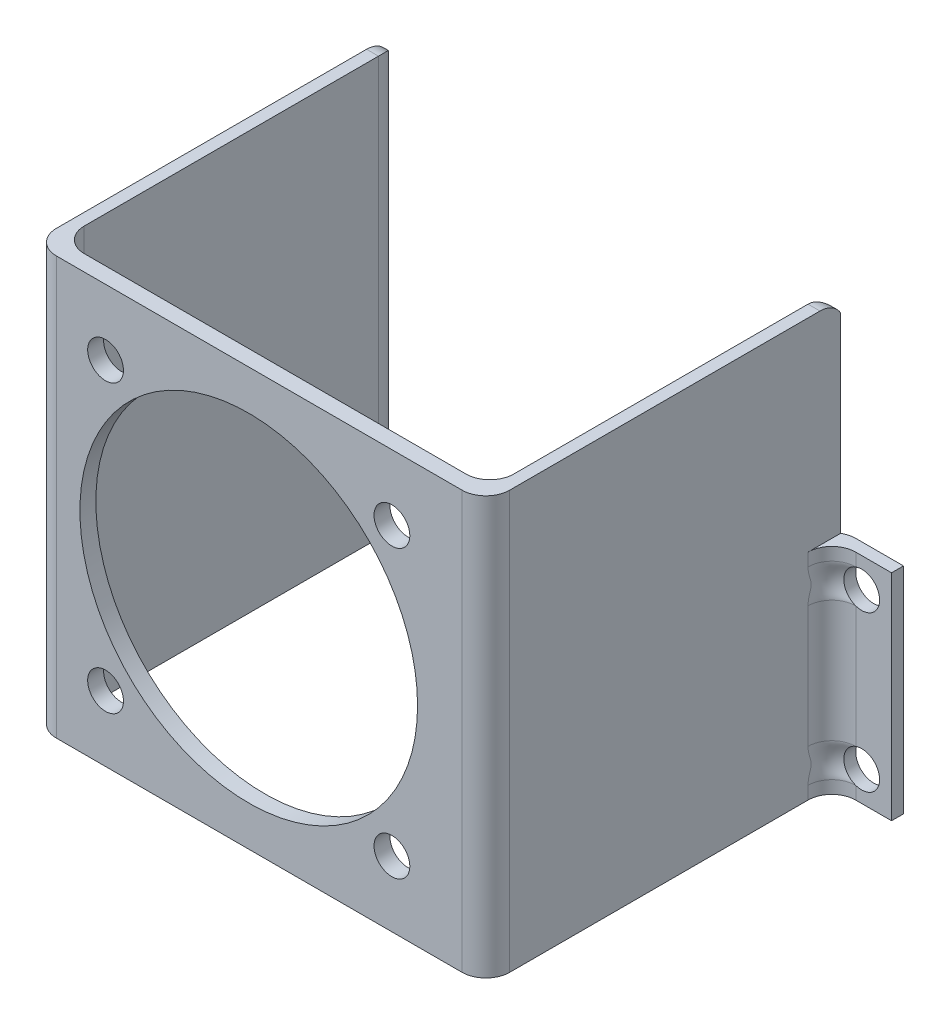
ISO-10303-21;
HEADER;
FILE_DESCRIPTION(('STEP AP214'),'2;1');
FILE_NAME('part.step','',(''),(''),'','','');
FILE_SCHEMA(('AUTOMOTIVE_DESIGN { 1 0 10303 214 1 1 1 1 }'));
ENDSEC;
DATA;
#1=APPLICATION_CONTEXT('core data for automotive mechanical design processes');
#2=APPLICATION_PROTOCOL_DEFINITION('international standard','automotive_design',2000,#1);
#3=PRODUCT_CONTEXT('',#1,'mechanical');
#4=PRODUCT('Part','Part','',(#3));
#5=PRODUCT_RELATED_PRODUCT_CATEGORY('part','',(#4));
#6=PRODUCT_DEFINITION_FORMATION('','',#4);
#7=PRODUCT_DEFINITION_CONTEXT('part definition',#1,'design');
#8=PRODUCT_DEFINITION('design','',#6,#7);
#9=PRODUCT_DEFINITION_SHAPE('','',#8);
#10=(LENGTH_UNIT() NAMED_UNIT(*) SI_UNIT(.MILLI.,.METRE.));
#11=(NAMED_UNIT(*) PLANE_ANGLE_UNIT() SI_UNIT($,.RADIAN.));
#12=(NAMED_UNIT(*) SI_UNIT($,.STERADIAN.) SOLID_ANGLE_UNIT());
#13=UNCERTAINTY_MEASURE_WITH_UNIT(LENGTH_MEASURE(1.E-05),#10,'distance_accuracy_value','');
#14=(GEOMETRIC_REPRESENTATION_CONTEXT(3) GLOBAL_UNCERTAINTY_ASSIGNED_CONTEXT((#13)) GLOBAL_UNIT_ASSIGNED_CONTEXT((#10,
#11,#12)) REPRESENTATION_CONTEXT('',''));
#15=CARTESIAN_POINT('',(0.,0.,0.));
#16=DIRECTION('',(0.,0.,1.));
#17=DIRECTION('',(1.,0.,0.));
#18=AXIS2_PLACEMENT_3D('',#15,#16,#17);
#19=CARTESIAN_POINT('',(-14.4999999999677,26.,0.));
#20=DIRECTION('',(1.,0.,0.));
#21=DIRECTION('',(0.,0.,-1.));
#22=AXIS2_PLACEMENT_3D('',#19,#20,#21);
#23=PLANE('',#22);
#24=DIRECTION('',(0.,-1.,0.));
#25=VECTOR('',#24,1.);
#26=CARTESIAN_POINT('',(-14.4999999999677,31.,0.267949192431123));
#27=LINE('',#26,#25);
#28=CARTESIAN_POINT('',(-14.4999999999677,8.99999999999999,0.267949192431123));
#29=VERTEX_POINT('',#28);
#30=CARTESIAN_POINT('',(-14.4999999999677,25.,0.267949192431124));
#31=VERTEX_POINT('',#30);
#32=EDGE_CURVE('E59',#29,#31,#27,.F.);
#33=ORIENTED_EDGE('',*,*,#32,.F.);
#34=DIRECTION('',(0.,0.,-1.));
#35=VECTOR('',#34,1.);
#36=CARTESIAN_POINT('',(-14.4999999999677,8.99999999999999,1.));
#37=LINE('',#36,#35);
#38=CARTESIAN_POINT('',(-14.4999999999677,8.99999999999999,3.));
#39=VERTEX_POINT('',#38);
#40=EDGE_CURVE('E550',#39,#29,#37,.T.);
#41=ORIENTED_EDGE('',*,*,#40,.F.);
#42=DIRECTION('',(0.,1.,0.));
#43=VECTOR('',#42,1.);
#44=CARTESIAN_POINT('',(-14.4999999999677,-9.,3.));
#45=LINE('',#44,#43);
#46=CARTESIAN_POINT('',(-14.4999999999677,7.92822997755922,3.));
#47=VERTEX_POINT('',#46);
#48=EDGE_CURVE('E1272',#39,#47,#45,.F.);
#49=ORIENTED_EDGE('',*,*,#48,.T.);
#50=CARTESIAN_POINT('',(-16.620430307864,5.06283522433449,1.));
#51=CARTESIAN_POINT('',(-14.4999999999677,5.09233666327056,0.875534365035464));
#52=CARTESIAN_POINT('',(-14.4999999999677,4.60240286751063,2.94254950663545));
#53=CARTESIAN_POINT('',(-16.6098848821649,5.0656142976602,1.));
#54=CARTESIAN_POINT('',(-14.4999999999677,5.08895195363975,0.886217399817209));
#55=CARTESIAN_POINT('',(-14.4999999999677,4.65899465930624,2.95597452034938));
#56=CARTESIAN_POINT('',(-16.5984457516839,5.06871017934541,1.));
#57=CARTESIAN_POINT('',(-14.4999999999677,5.08658398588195,0.898144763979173));
#58=CARTESIAN_POINT('',(-14.4999999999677,4.71614139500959,2.96701749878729));
#59=CARTESIAN_POINT('',(-16.5731833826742,5.07595626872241,1.));
#60=CARTESIAN_POINT('',(-14.4999999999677,5.08487012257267,0.924622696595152));
#61=CARTESIAN_POINT('',(-14.4999999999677,4.83112392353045,2.98439431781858));
#62=CARTESIAN_POINT('',(-16.5593611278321,5.08010604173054,1.));
#63=CARTESIAN_POINT('',(-14.4999999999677,5.08550420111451,0.939139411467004));
#64=CARTESIAN_POINT('',(-14.4999999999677,4.88895942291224,2.9907300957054));
#65=CARTESIAN_POINT('',(-16.5290577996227,5.08977700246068,1.));
#66=CARTESIAN_POINT('',(-14.4999999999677,5.09062540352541,0.970560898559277));
#67=CARTESIAN_POINT('',(-14.4999999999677,5.00369762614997,2.99867200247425));
#68=CARTESIAN_POINT('',(-16.5126403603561,5.09526674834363,1.));
#69=CARTESIAN_POINT('',(-14.4999999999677,5.0949966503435,0.987363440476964));
#70=CARTESIAN_POINT('',(-14.4999999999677,5.06059361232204,3.00037699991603));
#71=CARTESIAN_POINT('',(-16.4761395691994,5.10833092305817,1.));
#72=CARTESIAN_POINT('',(-14.4999999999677,5.10862666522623,1.02365971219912));
#73=CARTESIAN_POINT('',(-14.4999999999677,5.17434279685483,2.99948449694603));
#74=CARTESIAN_POINT('',(-16.456056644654,5.11590510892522,1.));
#75=CARTESIAN_POINT('',(-14.4999999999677,5.11782927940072,1.04309814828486));
#76=CARTESIAN_POINT('',(-14.4999999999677,5.23119599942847,2.99688749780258));
#77=CARTESIAN_POINT('',(-16.415028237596,5.13263698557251,1.));
#78=CARTESIAN_POINT('',(-14.4999999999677,5.14050309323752,1.08114687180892));
#79=CARTESIAN_POINT('',(-14.4999999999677,5.33478072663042,2.98842283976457));
#80=CARTESIAN_POINT('',(-16.3948290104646,5.14129621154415,1.));
#81=CARTESIAN_POINT('',(-14.4999999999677,5.15288774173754,1.09924667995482));
#82=CARTESIAN_POINT('',(-14.4999999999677,5.38156665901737,2.98319657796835));
#83=CARTESIAN_POINT('',(-16.3503926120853,5.16175382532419,1.));
#84=CARTESIAN_POINT('',(-14.4999999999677,5.18313613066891,1.13728317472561));
#85=CARTESIAN_POINT('',(-14.4999999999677,5.47478163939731,2.97014998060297));
#86=CARTESIAN_POINT('',(-16.3261547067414,5.17355278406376,1.));
#87=CARTESIAN_POINT('',(-14.4999999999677,5.20091832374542,1.15716862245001));
#88=CARTESIAN_POINT('',(-14.4999999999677,5.52121062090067,2.96232917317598));
#89=CARTESIAN_POINT('',(-16.2722935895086,5.20199948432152,1.));
#90=CARTESIAN_POINT('',(-14.4999999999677,5.24370198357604,1.19896971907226));
#91=CARTESIAN_POINT('',(-14.4999999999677,5.61429104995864,2.94423370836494));
#92=CARTESIAN_POINT('',(-16.2425964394,5.21871596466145,1.));
#93=CARTESIAN_POINT('',(-14.4999999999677,5.26867899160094,1.22084960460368));
#94=CARTESIAN_POINT('',(-14.4999999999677,5.66093573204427,2.93392466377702));
#95=CARTESIAN_POINT('',(-16.1769392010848,5.25938895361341,1.));
#96=CARTESIAN_POINT('',(-14.4999999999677,5.32768500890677,1.26612006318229));
#97=CARTESIAN_POINT('',(-14.4999999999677,5.75369285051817,2.91133014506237));
#98=CARTESIAN_POINT('',(-16.1409847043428,5.28333901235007,1.));
#99=CARTESIAN_POINT('',(-14.4999999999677,5.36150669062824,1.28943300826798));
#100=CARTESIAN_POINT('',(-14.4999999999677,5.79980572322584,2.89904643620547));
#101=CARTESIAN_POINT('',(-16.0770525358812,5.33119147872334,1.));
#102=CARTESIAN_POINT('',(-14.4999999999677,5.42577562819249,1.3279921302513));
#103=CARTESIAN_POINT('',(-14.4999999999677,5.87397282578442,2.87809921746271));
#104=CARTESIAN_POINT('',(-16.0513272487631,5.35156773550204,1.));
#105=CARTESIAN_POINT('',(-14.4999999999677,5.45230119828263,1.34279248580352));
#106=CARTESIAN_POINT('',(-14.4999999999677,5.90214976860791,2.86986093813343));
#107=CARTESIAN_POINT('',(-15.9970760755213,5.39802913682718,1.));
#108=CARTESIAN_POINT('',(-14.4999999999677,5.51048159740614,1.37251691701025));
#109=CARTESIAN_POINT('',(-14.4999999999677,5.95841030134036,2.85307131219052));
#110=CARTESIAN_POINT('',(-15.968550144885,5.4241143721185,1.));
#111=CARTESIAN_POINT('',(-14.4999999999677,5.54205358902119,1.38742568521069));
#112=CARTESIAN_POINT('',(-14.4999999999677,5.98649388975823,2.84451996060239));
#113=CARTESIAN_POINT('',(-15.9088523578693,5.48387602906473,1.));
#114=CARTESIAN_POINT('',(-14.4999999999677,5.6112503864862,1.41707628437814));
#115=CARTESIAN_POINT('',(-14.4999999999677,6.04274268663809,2.82734358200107));
#116=CARTESIAN_POINT('',(-15.877671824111,5.51757799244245,1.));
#117=CARTESIAN_POINT('',(-14.4999999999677,5.64880079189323,1.43180883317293));
#118=CARTESIAN_POINT('',(-14.4999999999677,6.07090784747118,2.81871840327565));
#119=CARTESIAN_POINT('',(-15.8136407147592,5.59474029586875,1.));
#120=CARTESIAN_POINT('',(-14.4999999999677,5.73072467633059,1.4605391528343));
#121=CARTESIAN_POINT('',(-14.4999999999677,6.12733984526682,2.80179184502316));
#122=CARTESIAN_POINT('',(-15.7807899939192,5.6382014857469,1.));
#123=CARTESIAN_POINT('',(-14.4999999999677,5.77500105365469,1.47453987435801));
#124=CARTESIAN_POINT('',(-14.4999999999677,6.15560669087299,2.79349049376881));
#125=CARTESIAN_POINT('',(-15.7164351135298,5.73570877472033,1.));
#126=CARTESIAN_POINT('',(-14.4999999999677,5.86959516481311,1.50064739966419));
#127=CARTESIAN_POINT('',(-14.4999999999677,6.21151112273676,2.77795291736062));
#128=CARTESIAN_POINT('',(-15.684920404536,5.78939238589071,1.));
#129=CARTESIAN_POINT('',(-14.4999999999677,5.9196051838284,1.51281474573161));
#130=CARTESIAN_POINT('',(-14.4999999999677,6.2391416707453,2.77069196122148));
#131=CARTESIAN_POINT('',(-15.6255391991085,5.90959098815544,1.));
#132=CARTESIAN_POINT('',(-14.4999999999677,6.02674564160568,1.53479778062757));
#133=CARTESIAN_POINT('',(-14.4999999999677,6.29473630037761,2.75753766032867));
#134=CARTESIAN_POINT('',(-15.5976725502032,5.97610544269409,1.));
#135=CARTESIAN_POINT('',(-14.4999999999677,6.08387916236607,1.54465365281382));
#136=CARTESIAN_POINT('',(-14.4999999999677,6.32270036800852,2.75164425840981));
#137=CARTESIAN_POINT('',(-15.5505225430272,6.12068639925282,1.));
#138=CARTESIAN_POINT('',(-14.4999999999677,6.20378597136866,1.56082802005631));
#139=CARTESIAN_POINT('',(-14.4999999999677,6.37878806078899,2.74194431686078));
#140=CARTESIAN_POINT('',(-15.5311763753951,6.19866251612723,1.));
#141=CARTESIAN_POINT('',(-14.4999999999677,6.26663652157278,1.56722294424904));
#142=CARTESIAN_POINT('',(-14.4999999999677,6.40690891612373,2.73812245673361));
#143=CARTESIAN_POINT('',(-15.505465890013,6.36191870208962,1.));
#144=CARTESIAN_POINT('',(-14.4999999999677,6.39563378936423,1.57560999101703));
#145=CARTESIAN_POINT('',(-14.4999999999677,6.46338000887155,2.73308879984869));
#146=CARTESIAN_POINT('',(-15.4990936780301,6.44719429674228,1.));
#147=CARTESIAN_POINT('',(-14.4999999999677,6.4620448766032,1.57764193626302));
#148=CARTESIAN_POINT('',(-14.4999999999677,6.49173009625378,2.73187541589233));
#149=CARTESIAN_POINT('',(-15.5010117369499,6.60758802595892,1.));
#150=CARTESIAN_POINT('',(-14.4999999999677,6.58681287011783,1.57702480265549));
#151=CARTESIAN_POINT('',(-14.4999999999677,6.54521871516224,2.73224637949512));
#152=CARTESIAN_POINT('',(-15.5077334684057,6.68276983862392,1.));
#153=CARTESIAN_POINT('',(-14.4999999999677,6.64547952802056,1.57487460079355));
#154=CARTESIAN_POINT('',(-14.4999999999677,6.57035982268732,2.73353140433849));
#155=CARTESIAN_POINT('',(-15.5312418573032,6.82727221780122,1.));
#156=CARTESIAN_POINT('',(-14.4999999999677,6.75977117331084,1.5672002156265));
#157=CARTESIAN_POINT('',(-14.4999999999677,6.62045761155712,2.73813647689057));
#158=CARTESIAN_POINT('',(-15.5480325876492,6.89659039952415,1.));
#159=CARTESIAN_POINT('',(-14.4999999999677,6.81557784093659,1.56164819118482));
#160=CARTESIAN_POINT('',(-14.4999999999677,6.64541421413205,2.74145734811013));
#161=CARTESIAN_POINT('',(-15.5885983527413,7.02649448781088,1.));
#162=CARTESIAN_POINT('',(-14.4999999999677,6.92277143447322,1.54780669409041));
#163=CARTESIAN_POINT('',(-14.4999999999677,6.69520564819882,2.74975884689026));
#164=CARTESIAN_POINT('',(-15.6124178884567,7.08702097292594,1.));
#165=CARTESIAN_POINT('',(-14.4999999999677,6.97422319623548,1.53946399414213));
#166=CARTESIAN_POINT('',(-14.4999999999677,6.72003864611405,2.75475007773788));
#167=CARTESIAN_POINT('',(-15.6635993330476,7.19795967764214,1.));
#168=CARTESIAN_POINT('',(-14.4999999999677,7.0715963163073,1.52082574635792));
#169=CARTESIAN_POINT('',(-14.4999999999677,6.76943169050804,2.76590990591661));
#170=CARTESIAN_POINT('',(-15.6909613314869,7.24837164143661,1.));
#171=CARTESIAN_POINT('',(-14.4999999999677,7.11753449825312,1.51049972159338));
#172=CARTESIAN_POINT('',(-14.4999999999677,6.79399173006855,2.77207853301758));
#173=CARTESIAN_POINT('',(-15.7475422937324,7.34130766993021,1.));
#174=CARTESIAN_POINT('',(-14.4999999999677,7.20530325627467,1.48820921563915));
#175=CARTESIAN_POINT('',(-14.4999999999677,6.84370257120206,2.78537212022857));
#176=CARTESIAN_POINT('',(-15.7767927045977,7.38352257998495,1.));
#177=CARTESIAN_POINT('',(-14.4999999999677,7.24690031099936,1.47618618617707));
#178=CARTESIAN_POINT('',(-14.4999999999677,6.86884667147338,2.79252162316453));
#179=CARTESIAN_POINT('',(-15.834520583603,7.45949669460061,1.));
#180=CARTESIAN_POINT('',(-14.4999999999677,7.32461607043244,1.45135064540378));
#181=CARTESIAN_POINT('',(-14.4999999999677,6.91901223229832,2.80722639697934));
#182=CARTESIAN_POINT('',(-15.8629980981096,7.49325640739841,1.));
#183=CARTESIAN_POINT('',(-14.4999999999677,7.36067146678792,1.4385310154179));
#184=CARTESIAN_POINT('',(-14.4999999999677,6.94403370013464,2.81478164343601));
#185=CARTESIAN_POINT('',(-15.9181658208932,7.55387683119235,1.));
#186=CARTESIAN_POINT('',(-14.4999999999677,7.42778675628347,1.4125498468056));
#187=CARTESIAN_POINT('',(-14.4999999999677,6.99398091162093,2.82998096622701));
#188=CARTESIAN_POINT('',(-15.9448603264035,7.58075460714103,1.));
#189=CARTESIAN_POINT('',(-14.4999999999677,7.45879112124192,1.39939130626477));
#190=CARTESIAN_POINT('',(-14.4999999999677,7.01890673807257,2.83762477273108));
#191=CARTESIAN_POINT('',(-15.9961369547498,7.62913701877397,1.));
#192=CARTESIAN_POINT('',(-14.4999999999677,7.51648426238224,1.37299176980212));
#193=CARTESIAN_POINT('',(-14.4999999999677,7.06879385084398,2.85279532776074));
#194=CARTESIAN_POINT('',(-16.0207190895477,7.65064168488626,1.));
#195=CARTESIAN_POINT('',(-14.4999999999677,7.54310906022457,1.3597590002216));
#196=CARTESIAN_POINT('',(-14.4999999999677,7.09375513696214,2.86032207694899));
#197=CARTESIAN_POINT('',(-16.0844561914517,7.70336245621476,1.));
#198=CARTESIAN_POINT('',(-14.4999999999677,7.61052921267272,1.32387804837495));
#199=CARTESIAN_POINT('',(-14.4999999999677,7.16165719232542,2.88036217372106));
#200=CARTESIAN_POINT('',(-16.1214538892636,7.73051845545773,1.));
#201=CARTESIAN_POINT('',(-14.4999999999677,7.64721720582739,1.30152381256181));
#202=CARTESIAN_POINT('',(-14.4999999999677,7.20468398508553,2.89259031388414));
#203=CARTESIAN_POINT('',(-16.1894171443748,7.77679720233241,1.));
#204=CARTESIAN_POINT('',(-14.4999999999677,7.71191484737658,1.25781647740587));
#205=CARTESIAN_POINT('',(-14.4999999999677,7.29113660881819,2.91555608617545));
#206=CARTESIAN_POINT('',(-16.2203830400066,7.79592040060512,1.));
#207=CARTESIAN_POINT('',(-14.4999999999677,7.73972335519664,1.23652808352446));
#208=CARTESIAN_POINT('',(-14.4999999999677,7.33456241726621,2.92629380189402));
#209=CARTESIAN_POINT('',(-16.2772452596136,7.82881789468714,1.));
#210=CARTESIAN_POINT('',(-14.4999999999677,7.78843806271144,1.19526519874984));
#211=CARTESIAN_POINT('',(-14.4999999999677,7.4218745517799,2.94587296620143));
#212=CARTESIAN_POINT('',(-16.303138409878,7.84258884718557,1.));
#213=CARTESIAN_POINT('',(-14.4999999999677,7.80920123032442,1.17535101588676));
#214=CARTESIAN_POINT('',(-14.4999999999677,7.46576114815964,2.95471322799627));
#215=CARTESIAN_POINT('',(-16.3507250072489,7.86647294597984,1.));
#216=CARTESIAN_POINT('',(-14.4999999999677,7.84515338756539,1.13702852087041));
#217=CARTESIAN_POINT('',(-14.4999999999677,7.55391873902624,2.97019977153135));
#218=CARTESIAN_POINT('',(-16.3724182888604,7.87658594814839,1.));
#219=CARTESIAN_POINT('',(-14.4999999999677,7.86024856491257,1.11867094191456));
#220=CARTESIAN_POINT('',(-14.4999999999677,7.59818974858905,2.97684596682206));
#221=CARTESIAN_POINT('',(-16.4316222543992,7.90284082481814,1.));
#222=CARTESIAN_POINT('',(-14.4999999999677,7.89852817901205,1.06642610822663));
#223=CARTESIAN_POINT('',(-14.4999999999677,7.72971462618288,2.99294942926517));
#224=CARTESIAN_POINT('',(-16.464322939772,7.91544914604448,1.));
#225=CARTESIAN_POINT('',(-14.4999999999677,7.91487796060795,1.03525056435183));
#226=CARTESIAN_POINT('',(-14.4999999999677,7.81742833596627,2.99897935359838));
#227=CARTESIAN_POINT('',(-16.5209836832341,7.93577290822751,1.));
#228=CARTESIAN_POINT('',(-14.4999999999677,7.93634598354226,0.978991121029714));
#229=CARTESIAN_POINT('',(-14.4999999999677,7.99291220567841,3.00078473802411));
#230=CARTESIAN_POINT('',(-16.5449470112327,7.94349018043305,1.));
#231=CARTESIAN_POINT('',(-14.4999999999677,7.94126380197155,0.95410758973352));
#232=CARTESIAN_POINT('',(-14.4999999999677,8.08068233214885,2.99656403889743));
#233=CARTESIAN_POINT('',(-16.5934234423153,7.95815506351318,1.));
#234=CARTESIAN_POINT('',(-14.4999999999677,7.94391602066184,0.903287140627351));
#235=CARTESIAN_POINT('',(-14.4999999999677,8.28222968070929,2.97442406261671));
#236=CARTESIAN_POINT('',(-16.6158012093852,7.96412132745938,1.));
#237=CARTESIAN_POINT('',(-14.4999999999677,7.93877534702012,0.879783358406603));
#238=CARTESIAN_POINT('',(-14.4999999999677,8.39562865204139,2.95266159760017));
#239=CARTESIAN_POINT('',(-16.6446499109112,7.97134766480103,1.));
#240=CARTESIAN_POINT('',(-14.4999999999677,7.92552206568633,0.851349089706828));
#241=CARTESIAN_POINT('',(-14.4999999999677,8.56305321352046,2.90585339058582));
#242=CARTESIAN_POINT('',(-16.6535556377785,7.97348379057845,1.));
#243=CARTESIAN_POINT('',(-14.4999999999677,7.92005564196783,0.842947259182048));
#244=CARTESIAN_POINT('',(-14.4999999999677,8.61905974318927,2.88758674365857));
#245=CARTESIAN_POINT('',(-16.669944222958,7.97727851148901,1.));
#246=CARTESIAN_POINT('',(-14.4999999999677,7.90769916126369,0.828470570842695));
#247=CARTESIAN_POINT('',(-14.4999999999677,8.72934096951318,2.84630595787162));
#248=CARTESIAN_POINT('',(-16.6774260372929,7.97893675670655,1.));
#249=CARTESIAN_POINT('',(-14.4999999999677,7.90080636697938,0.822413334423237));
#250=CARTESIAN_POINT('',(-14.4999999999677,8.78361437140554,2.82328836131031));
#251=CARTESIAN_POINT('',(-16.6843443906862,7.98042752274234,1.));
#252=CARTESIAN_POINT('',(-14.4999999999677,7.89347771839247,0.817453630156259));
#253=CARTESIAN_POINT('',(-14.4999999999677,8.83681864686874,2.79794643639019));
#254=(BOUNDED_SURFACE() B_SPLINE_SURFACE(3,2,((#50,#51,#52),(#53,#54,#55),(#56,#57,#58),(#59,
#60,#61),(#62,#63,#64),(#65,#66,#67),(#68,#69,#70),(#71,#72,#73),(#74,#75,#76),(#77,#78,#79),
(#80,#81,#82),(#83,#84,#85),(#86,#87,#88),(#89,#90,#91),(#92,#93,#94),(#95,#96,#97),(#98,#99,
#100),(#101,#102,#103),(#104,#105,#106),(#107,#108,#109),(#110,#111,#112),(#113,#114,#115),
(#116,#117,#118),(#119,#120,#121),(#122,#123,#124),(#125,#126,#127),(#128,#129,#130),(#131,#132,
#133),(#134,#135,#136),(#137,#138,#139),(#140,#141,#142),(#143,#144,#145),(#146,#147,#148),
(#149,#150,#151),(#152,#153,#154),(#155,#156,#157),(#158,#159,#160),(#161,#162,#163),(#164,#165,
#166),(#167,#168,#169),(#170,#171,#172),(#173,#174,#175),(#176,#177,#178),(#179,#180,#181),
(#182,#183,#184),(#185,#186,#187),(#188,#189,#190),(#191,#192,#193),(#194,#195,#196),(#197,#198,
#199),(#200,#201,#202),(#203,#204,#205),(#206,#207,#208),(#209,#210,#211),(#212,#213,#214),
(#215,#216,#217),(#218,#219,#220),(#221,#222,#223),(#224,#225,#226),(#227,#228,#229),(#230,#231,
#232),(#233,#234,#235),(#236,#237,#238),(#239,#240,#241),(#242,#243,#244),(#245,#246,#247),
(#248,#249,#250),(#251,#252,#253)),.UNSPECIFIED.,.F.,.F.,.F.) B_SPLINE_SURFACE_WITH_KNOTS((4,2,
2,2,2,2,2,2,2,2,2,2,2,2,2,2,2,2,2,2,2,2,2,2,2,2,2,2,2,2,2,2,2,4),(3,3),(0.,0.174422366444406,
0.348772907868,0.519370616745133,0.689948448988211,0.831104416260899,0.972286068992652,
1.11554344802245,1.25867346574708,1.3467412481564,1.43481043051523,1.52317944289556,
1.61155615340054,1.69724259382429,1.78292545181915,1.86796566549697,1.95295411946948,
2.02838356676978,2.10384354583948,2.17979192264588,2.25574222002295,2.33415784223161,
2.41256874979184,2.49078329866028,2.56899740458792,2.70317198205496,2.83733903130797,
2.97158975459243,3.10584576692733,3.36899886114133,3.63205337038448,3.97670790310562,
4.15325177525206,4.32992459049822),(0.,1.),
.UNSPECIFIED.) GEOMETRIC_REPRESENTATION_ITEM() RATIONAL_B_SPLINE_SURFACE(((1.,0.685486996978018,
1.),(1.,0.687408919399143,1.),(1.,0.689487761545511,1.),(1.,0.694053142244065,1.),(1.,
0.696539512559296,1.),(1.,0.701956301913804,1.),(1.,0.704876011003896,1.),(1.,0.711319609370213,
1.),(1.,0.714843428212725,1.),(1.,0.721978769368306,1.),(1.,0.725470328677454,1.),(1.,
0.733086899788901,1.),(1.,0.737212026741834,1.),(1.,0.746289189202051,1.),(1.,0.751252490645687,
1.),(1.,0.762098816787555,1.),(1.,0.767981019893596,1.),(1.,0.778300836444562,1.),(1.,
0.782423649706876,1.),(1.,0.791043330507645,1.),(1.,0.795540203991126,1.),(1.,0.804865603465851,
1.),(1.,0.809695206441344,1.),(1.,0.819520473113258,1.),(1.,0.824516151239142,1.),(1.,
0.834214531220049,1.),(1.,0.838921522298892,1.),(1.,0.847723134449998,1.),(1.,0.851817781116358,
1.),(1.,0.858709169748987,1.),(1.,0.861515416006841,1.),(1.,0.865238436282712,1.),(1.,
0.866156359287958,1.),(1.,0.865879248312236,1.),(1.,0.864910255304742,1.),(1.,0.861505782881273,
1.),(1.,0.859069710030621,1.),(1.,0.853146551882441,1.),(1.,0.849652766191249,1.),(1.,
0.842089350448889,1.),(1.,0.838019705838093,1.),(1.,0.82953785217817,1.),(1.,0.825118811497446,
1.),(1.,0.816326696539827,1.),(1.,0.81195361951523,1.),(1.,0.803415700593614,1.),(1.,
0.799250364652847,1.),(1.,0.791190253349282,1.),(1.,0.787295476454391,1.),(1.,0.777127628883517,
1.),(1.,0.771146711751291,1.),(1.,0.760050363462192,1.),(1.,0.754934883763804,1.),(1.,
0.745460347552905,1.),(1.,0.741101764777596,1.),(1.,0.733031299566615,1.),(1.,0.729319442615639,
1.),(1.,0.719125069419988,1.),(1.,0.713403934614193,1.),(1.,0.70340469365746,1.),(1.,
0.699126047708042,1.),(1.,0.690412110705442,1.),(1.,0.686339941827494,1.),(1.,0.681058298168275,
1.),(1.,0.67942133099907,1.),(1.,0.676399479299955,1.),(1.,0.67501477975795,1.),(1.,
0.673731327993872,1.))) REPRESENTATION_ITEM('') SURFACE());
#255=CARTESIAN_POINT('',(-14.4999999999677,8.83681864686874,2.79794643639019));
#256=CARTESIAN_POINT('',(-14.4999999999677,8.78361437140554,2.82328836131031));
#257=CARTESIAN_POINT('',(-14.4999999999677,8.72934096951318,2.84630595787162));
#258=CARTESIAN_POINT('',(-14.4999999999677,8.61905974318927,2.88758674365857));
#259=CARTESIAN_POINT('',(-14.4999999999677,8.56305321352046,2.90585339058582));
#260=CARTESIAN_POINT('',(-14.4999999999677,8.39562865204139,2.95266159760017));
#261=CARTESIAN_POINT('',(-14.4999999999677,8.28222968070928,2.97442406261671));
#262=CARTESIAN_POINT('',(-14.4999999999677,8.08068233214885,2.99656403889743));
#263=CARTESIAN_POINT('',(-14.4999999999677,7.99291220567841,3.00078473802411));
#264=CARTESIAN_POINT('',(-14.4999999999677,7.81742833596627,2.99897935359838));
#265=CARTESIAN_POINT('',(-14.4999999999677,7.72971462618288,2.99294942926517));
#266=CARTESIAN_POINT('',(-14.4999999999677,7.59818974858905,2.97684596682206));
#267=CARTESIAN_POINT('',(-14.4999999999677,7.55391873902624,2.97019977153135));
#268=CARTESIAN_POINT('',(-14.4999999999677,7.46576114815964,2.95471322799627));
#269=CARTESIAN_POINT('',(-14.4999999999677,7.4218745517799,2.94587296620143));
#270=CARTESIAN_POINT('',(-14.4999999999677,7.33456241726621,2.92629380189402));
#271=CARTESIAN_POINT('',(-14.4999999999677,7.29113660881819,2.91555608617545));
#272=CARTESIAN_POINT('',(-14.4999999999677,7.20468398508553,2.89259031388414));
#273=CARTESIAN_POINT('',(-14.4999999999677,7.16165719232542,2.88036217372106));
#274=CARTESIAN_POINT('',(-14.4999999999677,7.09375513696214,2.86032207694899));
#275=CARTESIAN_POINT('',(-14.4999999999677,7.06879385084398,2.85279532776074));
#276=CARTESIAN_POINT('',(-14.4999999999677,7.01890673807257,2.83762477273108));
#277=CARTESIAN_POINT('',(-14.4999999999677,6.99398091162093,2.82998096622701));
#278=CARTESIAN_POINT('',(-14.4999999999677,6.94403370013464,2.81478164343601));
#279=CARTESIAN_POINT('',(-14.4999999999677,6.91901223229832,2.80722639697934));
#280=CARTESIAN_POINT('',(-14.4999999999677,6.86884667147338,2.79252162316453));
#281=CARTESIAN_POINT('',(-14.4999999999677,6.84370257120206,2.78537212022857));
#282=CARTESIAN_POINT('',(-14.4999999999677,6.79399173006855,2.77207853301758));
#283=CARTESIAN_POINT('',(-14.4999999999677,6.76943169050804,2.76590990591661));
#284=CARTESIAN_POINT('',(-14.4999999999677,6.72003864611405,2.75475007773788));
#285=CARTESIAN_POINT('',(-14.4999999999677,6.69520564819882,2.74975884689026));
#286=CARTESIAN_POINT('',(-14.4999999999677,6.64541421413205,2.74145734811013));
#287=CARTESIAN_POINT('',(-14.4999999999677,6.62045761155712,2.73813647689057));
#288=CARTESIAN_POINT('',(-14.4999999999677,6.57035982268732,2.73353140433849));
#289=CARTESIAN_POINT('',(-14.4999999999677,6.54521871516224,2.73224637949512));
#290=CARTESIAN_POINT('',(-14.4999999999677,6.49173009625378,2.73187541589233));
#291=CARTESIAN_POINT('',(-14.4999999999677,6.46338000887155,2.73308879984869));
#292=CARTESIAN_POINT('',(-14.4999999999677,6.40690891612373,2.73812245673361));
#293=CARTESIAN_POINT('',(-14.4999999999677,6.37878806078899,2.74194431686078));
#294=CARTESIAN_POINT('',(-14.4999999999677,6.32270036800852,2.75164425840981));
#295=CARTESIAN_POINT('',(-14.4999999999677,6.29473630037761,2.75753766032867));
#296=CARTESIAN_POINT('',(-14.4999999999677,6.2391416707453,2.77069196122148));
#297=CARTESIAN_POINT('',(-14.4999999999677,6.21151112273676,2.77795291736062));
#298=CARTESIAN_POINT('',(-14.4999999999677,6.15560669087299,2.79349049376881));
#299=CARTESIAN_POINT('',(-14.4999999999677,6.12733984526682,2.80179184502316));
#300=CARTESIAN_POINT('',(-14.4999999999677,6.07090784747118,2.81871840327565));
#301=CARTESIAN_POINT('',(-14.4999999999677,6.04274268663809,2.82734358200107));
#302=CARTESIAN_POINT('',(-14.4999999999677,5.98649388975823,2.84451996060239));
#303=CARTESIAN_POINT('',(-14.4999999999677,5.95841030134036,2.85307131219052));
#304=CARTESIAN_POINT('',(-14.4999999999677,5.90214976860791,2.86986093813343));
#305=CARTESIAN_POINT('',(-14.4999999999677,5.87397282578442,2.87809921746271));
#306=CARTESIAN_POINT('',(-14.4999999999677,5.79980572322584,2.89904643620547));
#307=CARTESIAN_POINT('',(-14.4999999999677,5.75369285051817,2.91133014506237));
#308=CARTESIAN_POINT('',(-14.4999999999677,5.66093573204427,2.93392466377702));
#309=CARTESIAN_POINT('',(-14.4999999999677,5.61429104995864,2.94423370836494));
#310=CARTESIAN_POINT('',(-14.4999999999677,5.52121062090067,2.96232917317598));
#311=CARTESIAN_POINT('',(-14.4999999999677,5.47478163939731,2.97014998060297));
#312=CARTESIAN_POINT('',(-14.4999999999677,5.38156665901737,2.98319657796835));
#313=CARTESIAN_POINT('',(-14.4999999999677,5.33478072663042,2.98842283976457));
#314=CARTESIAN_POINT('',(-14.4999999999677,5.23119599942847,2.99688749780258));
#315=CARTESIAN_POINT('',(-14.4999999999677,5.17434279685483,2.99948449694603));
#316=CARTESIAN_POINT('',(-14.4999999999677,5.06059361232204,3.00037699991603));
#317=CARTESIAN_POINT('',(-14.4999999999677,5.00369762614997,2.99867200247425));
#318=CARTESIAN_POINT('',(-14.4999999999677,4.88895942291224,2.9907300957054));
#319=CARTESIAN_POINT('',(-14.4999999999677,4.83112392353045,2.98439431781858));
#320=CARTESIAN_POINT('',(-14.4999999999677,4.71614139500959,2.96701749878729));
#321=CARTESIAN_POINT('',(-14.4999999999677,4.65899465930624,2.95597452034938));
#322=CARTESIAN_POINT('',(-14.4999999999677,4.60240286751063,2.94254950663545));
#323=B_SPLINE_CURVE_WITH_KNOTS('',3,(#255,#256,#257,#258,#259,#260,#261,#262,#263,#264,#265,
#266,#267,#268,#269,#270,#271,#272,#273,#274,#275,#276,#277,#278,#279,#280,#281,#282,#283,#284,
#285,#286,#287,#288,#289,#290,#291,#292,#293,#294,#295,#296,#297,#298,#299,#300,#301,#302,#303,
#304,#305,#306,#307,#308,#309,#310,#311,#312,#313,#314,#315,#316,#317,#318,#319,#320,#321,#322),
.UNSPECIFIED.,.F.,.F.,(4,2,2,2,2,2,2,2,2,2,2,2,2,2,2,2,2,2,2,2,2,2,2,2,2,2,2,2,2,2,2,2,2,4),(0.,
0.176672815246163,0.353216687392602,0.697871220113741,0.960925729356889,1.22407882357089,
1.35833483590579,1.49258555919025,1.62675260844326,1.7609271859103,1.83914129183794,
1.91735584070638,1.99576674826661,2.07418237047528,2.15013266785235,2.22608104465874,
2.30154102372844,2.37697047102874,2.46195892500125,2.54699913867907,2.63268199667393,
2.71836843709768,2.80674514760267,2.89511415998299,2.98318334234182,3.07125112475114,
3.21438114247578,3.35763852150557,3.49882017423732,3.63997614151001,3.81055397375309,
3.98115168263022,4.15550222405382,4.32992459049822),.UNSPECIFIED.);
#324=CARTESIAN_POINT('',(-14.4999999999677,5.0998028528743,3.));
#325=VERTEX_POINT('',#324);
#326=EDGE_CURVE('E1274',#47,#325,#323,.T.);
#327=ORIENTED_EDGE('',*,*,#326,.T.);
#328=DIRECTION('',(0.,1.,0.));
#329=VECTOR('',#328,1.);
#330=CARTESIAN_POINT('',(-14.4999999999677,-9.,3.));
#331=LINE('',#330,#329);
#332=CARTESIAN_POINT('',(-14.4999999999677,-5.09980285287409,3.));
#333=VERTEX_POINT('',#332);
#334=EDGE_CURVE('E390',#325,#333,#331,.F.);
#335=ORIENTED_EDGE('',*,*,#334,.T.);
#336=CARTESIAN_POINT('',(-16.6204303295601,-7.96519761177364,1.));
#337=CARTESIAN_POINT('',(-14.4999999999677,-7.9356961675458,0.875534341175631));
#338=CARTESIAN_POINT('',(-14.4999999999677,-8.42562996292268,2.94254950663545));
#339=CARTESIAN_POINT('',(-16.6098848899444,-7.96241853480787,1.));
#340=CARTESIAN_POINT('',(-14.4999999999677,-7.93908087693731,0.886217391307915));
#341=CARTESIAN_POINT('',(-14.4999999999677,-8.3690381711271,2.95597452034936));
#342=CARTESIAN_POINT('',(-16.5984457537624,-7.95932265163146,1.));
#343=CARTESIAN_POINT('',(-14.4999999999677,-7.94144884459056,0.898144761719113));
#344=CARTESIAN_POINT('',(-14.4999999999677,-8.31189143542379,2.96701749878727));
#345=CARTESIAN_POINT('',(-16.5731833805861,-7.95207656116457,1.));
#346=CARTESIAN_POINT('',(-14.4999999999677,-7.94316270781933,0.924622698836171));
#347=CARTESIAN_POINT('',(-14.4999999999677,-8.19690890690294,2.98439431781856));
#348=CARTESIAN_POINT('',(-16.5593611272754,-7.94792678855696,1.));
#349=CARTESIAN_POINT('',(-14.4999999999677,-7.94252862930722,0.939139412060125));
#350=CARTESIAN_POINT('',(-14.4999999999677,-8.13907340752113,2.99073009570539));
#351=CARTESIAN_POINT('',(-16.5290578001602,-7.93825582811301,1.));
#352=CARTESIAN_POINT('',(-14.4999999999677,-7.9374074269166,0.970560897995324));
#353=CARTESIAN_POINT('',(-14.4999999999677,-8.02433520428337,2.99867200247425));
#354=CARTESIAN_POINT('',(-16.5126403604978,-7.93276608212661,1.));
#355=CARTESIAN_POINT('',(-14.4999999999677,-7.93303618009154,0.987363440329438));
#356=CARTESIAN_POINT('',(-14.4999999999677,-7.96743921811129,3.00037699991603));
#357=CARTESIAN_POINT('',(-16.476139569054,-7.91970190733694,1.));
#358=CARTESIAN_POINT('',(-14.4999999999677,-7.91940616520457,1.0236597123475));
#359=CARTESIAN_POINT('',(-14.4999999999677,-7.85369003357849,2.99948449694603));
#360=CARTESIAN_POINT('',(-16.4560566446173,-7.91212772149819,1.));
#361=CARTESIAN_POINT('',(-14.4999999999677,-7.91020355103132,1.04309814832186));
#362=CARTESIAN_POINT('',(-14.4999999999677,-7.79683683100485,2.99688749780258));
#363=CARTESIAN_POINT('',(-16.415028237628,-7.89539584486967,1.));
#364=CARTESIAN_POINT('',(-14.4999999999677,-7.88752973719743,1.08114687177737));
#365=CARTESIAN_POINT('',(-14.4999999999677,-7.69325210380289,2.98842283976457));
#366=CARTESIAN_POINT('',(-16.3948290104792,-7.88673661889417,1.));
#367=CARTESIAN_POINT('',(-14.4999999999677,-7.8751450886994,1.09924667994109));
#368=CARTESIAN_POINT('',(-14.4999999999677,-7.64646617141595,2.98319657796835));
#369=CARTESIAN_POINT('',(-16.3503926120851,-7.86627900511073,1.));
#370=CARTESIAN_POINT('',(-14.4999999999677,-7.84489669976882,1.13728317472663));
#371=CARTESIAN_POINT('',(-14.4999999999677,-7.553251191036,2.97014998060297));
#372=CARTESIAN_POINT('',(-16.3261547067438,-7.85448004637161,1.));
#373=CARTESIAN_POINT('',(-14.4999999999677,-7.82711450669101,1.15716862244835));
#374=CARTESIAN_POINT('',(-14.4999999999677,-7.50682220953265,2.96232917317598));
#375=CARTESIAN_POINT('',(-16.2722935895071,-7.82603334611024,1.));
#376=CARTESIAN_POINT('',(-14.4999999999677,-7.78433084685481,1.1989697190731));
#377=CARTESIAN_POINT('',(-14.4999999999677,-7.41374178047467,2.94423370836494));
#378=CARTESIAN_POINT('',(-16.2425964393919,-7.8093168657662,1.));
#379=CARTESIAN_POINT('',(-14.4999999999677,-7.75935383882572,1.22084960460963));
#380=CARTESIAN_POINT('',(-14.4999999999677,-7.36709709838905,2.93392466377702));
#381=CARTESIAN_POINT('',(-16.1769392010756,-7.76864387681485,1.));
#382=CARTESIAN_POINT('',(-14.4999999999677,-7.70034782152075,1.26612006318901));
#383=CARTESIAN_POINT('',(-14.4999999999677,-7.27433997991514,2.91133014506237));
#384=CARTESIAN_POINT('',(-16.1409847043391,-7.74469381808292,1.));
#385=CARTESIAN_POINT('',(-14.4999999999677,-7.666526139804,1.28943300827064));
#386=CARTESIAN_POINT('',(-14.4999999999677,-7.22822710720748,2.89904643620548));
#387=CARTESIAN_POINT('',(-16.0770525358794,-7.69684135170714,1.));
#388=CARTESIAN_POINT('',(-14.4999999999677,-7.60225720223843,1.32799213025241));
#389=CARTESIAN_POINT('',(-14.4999999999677,-7.15406000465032,2.87809921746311));
#390=CARTESIAN_POINT('',(-16.0513272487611,-7.67646509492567,1.));
#391=CARTESIAN_POINT('',(-14.4999999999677,-7.5757316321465,1.34279248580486));
#392=CARTESIAN_POINT('',(-14.4999999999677,-7.12588306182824,2.86986093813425));
#393=CARTESIAN_POINT('',(-15.9970760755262,-7.63000369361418,1.));
#394=CARTESIAN_POINT('',(-14.4999999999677,-7.51755123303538,1.37251691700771));
#395=CARTESIAN_POINT('',(-14.4999999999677,-7.06962252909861,2.85307131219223));
#396=CARTESIAN_POINT('',(-15.9685501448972,-7.60391845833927,1.));
#397=CARTESIAN_POINT('',(-14.4999999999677,-7.48597924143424,1.38742568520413));
#398=CARTESIAN_POINT('',(-14.4999999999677,-7.04153894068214,2.84451996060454));
#399=CARTESIAN_POINT('',(-15.9088523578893,-7.5441568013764,1.));
#400=CARTESIAN_POINT('',(-14.4999999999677,-7.41678244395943,1.41707628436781));
#401=CARTESIAN_POINT('',(-14.4999999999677,-6.9852901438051,2.82734358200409));
#402=CARTESIAN_POINT('',(-15.8776718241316,-7.51045483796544,1.));
#403=CARTESIAN_POINT('',(-14.4999999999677,-7.37923203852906,1.43180883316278));
#404=CARTESIAN_POINT('',(-14.4999999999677,-6.95712498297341,2.81871840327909));
#405=CARTESIAN_POINT('',(-15.8136407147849,-7.43329253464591,1.));
#406=CARTESIAN_POINT('',(-14.4999999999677,-7.29730815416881,1.4605391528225));
#407=CARTESIAN_POINT('',(-14.4999999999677,-6.90069298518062,2.80179184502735));
#408=CARTESIAN_POINT('',(-15.7807899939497,-7.38983134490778,1.));
#409=CARTESIAN_POINT('',(-14.4999999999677,-7.2530317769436,1.47453987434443));
#410=CARTESIAN_POINT('',(-14.4999999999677,-6.87242613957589,2.79349049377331));
#411=CARTESIAN_POINT('',(-15.7164351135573,-7.29232405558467,1.));
#412=CARTESIAN_POINT('',(-14.4999999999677,-7.1584376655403,1.5006473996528));
#413=CARTESIAN_POINT('',(-14.4999999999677,-6.8165217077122,2.77795291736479));
#414=CARTESIAN_POINT('',(-15.6849204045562,-7.23864044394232,1.));
#415=CARTESIAN_POINT('',(-14.4999999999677,-7.10842764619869,1.51281474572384));
#416=CARTESIAN_POINT('',(-14.4999999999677,-6.78889115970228,2.77069196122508));
#417=CARTESIAN_POINT('',(-15.6255391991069,-7.11844184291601,1.));
#418=CARTESIAN_POINT('',(-14.4999999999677,-7.00128718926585,1.5347977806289));
#419=CARTESIAN_POINT('',(-14.4999999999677,-6.73329653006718,2.75753766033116));
#420=CARTESIAN_POINT('',(-15.5976725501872,-7.05192739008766,1.));
#421=CARTESIAN_POINT('',(-14.4999999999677,-6.94415366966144,1.54465365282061));
#422=CARTESIAN_POINT('',(-14.4999999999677,-6.70533246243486,2.75164425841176));
#423=CARTESIAN_POINT('',(-15.5505225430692,-6.90734642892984,1.));
#424=CARTESIAN_POINT('',(-14.4999999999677,-6.82424685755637,1.56082802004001));
#425=CARTESIAN_POINT('',(-14.4999999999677,-6.64924476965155,2.74194431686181));
#426=CARTESIAN_POINT('',(-15.531176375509,-6.8293703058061,1.));
#427=CARTESIAN_POINT('',(-14.4999999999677,-6.76139630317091,1.5672229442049));
#428=CARTESIAN_POINT('',(-14.4999999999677,-6.62112391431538,2.73812245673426));
#429=CARTESIAN_POINT('',(-15.5054658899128,-6.66611413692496,1.));
#430=CARTESIAN_POINT('',(-14.4999999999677,-6.63239904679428,1.57560999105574));
#431=CARTESIAN_POINT('',(-14.4999999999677,-6.56465282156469,2.73308879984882));
#432=CARTESIAN_POINT('',(-15.4990936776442,-6.58083856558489,1.));
#433=CARTESIAN_POINT('',(-14.4999999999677,-6.56598797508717,1.57764193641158));
#434=CARTESIAN_POINT('',(-14.4999999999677,-6.53630273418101,2.73187541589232));
#435=CARTESIAN_POINT('',(-15.5010117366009,-6.42044483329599,1.));
#436=CARTESIAN_POINT('',(-14.4999999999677,-6.4412199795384,1.57702480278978));
#437=CARTESIAN_POINT('',(-14.4999999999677,-6.48281411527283,2.7322463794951));
#438=CARTESIAN_POINT('',(-15.5077334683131,-6.34526299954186,1.));
#439=CARTESIAN_POINT('',(-14.4999999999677,-6.38255330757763,1.57487460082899));
#440=CARTESIAN_POINT('',(-14.4999999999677,-6.45767300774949,2.7335314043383));
#441=CARTESIAN_POINT('',(-15.5312418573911,-6.20076060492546,1.));
#442=CARTESIAN_POINT('',(-14.4999999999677,-6.26826165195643,1.56720021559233));
#443=CARTESIAN_POINT('',(-14.4999999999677,-6.40757521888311,2.7381364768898));
#444=CARTESIAN_POINT('',(-15.5480325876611,-6.1314424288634,1.));
#445=CARTESIAN_POINT('',(-14.4999999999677,-6.21245498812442,1.56164819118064));
#446=CARTESIAN_POINT('',(-14.4999999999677,-6.38261861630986,2.74145734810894));
#447=CARTESIAN_POINT('',(-15.5885983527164,-6.00153834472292,1.));
#448=CARTESIAN_POINT('',(-14.4999999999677,-6.10526139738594,1.54780669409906));
#449=CARTESIAN_POINT('',(-14.4999999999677,-6.332827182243,2.74975884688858));
#450=CARTESIAN_POINT('',(-15.6124178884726,-5.94101185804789,1.));
#451=CARTESIAN_POINT('',(-14.4999999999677,-6.05380963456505,1.53946399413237));
#452=CARTESIAN_POINT('',(-14.4999999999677,-6.30799418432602,2.75475007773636));
#453=CARTESIAN_POINT('',(-15.6635993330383,-5.8300731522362,1.));
#454=CARTESIAN_POINT('',(-14.4999999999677,-5.95643651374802,1.52082574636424));
#455=CARTESIAN_POINT('',(-14.4999999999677,-6.25860113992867,2.76590990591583));
#456=CARTESIAN_POINT('',(-15.6909613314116,-5.77966118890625,1.));
#457=CARTESIAN_POINT('',(-14.4999999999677,-5.91049833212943,1.51049972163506));
#458=CARTESIAN_POINT('',(-14.4999999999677,-6.23404110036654,2.77207853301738));
#459=CARTESIAN_POINT('',(-15.7475422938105,-5.68672516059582,1.));
#460=CARTESIAN_POINT('',(-14.4999999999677,-5.82272957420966,1.48820921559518));
#461=CARTESIAN_POINT('',(-14.4999999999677,-6.18433025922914,2.78537212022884));
#462=CARTESIAN_POINT('',(-15.7767927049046,-5.64451025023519,1.));
#463=CARTESIAN_POINT('',(-14.4999999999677,-5.78113251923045,1.47618618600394));
#464=CARTESIAN_POINT('',(-14.4999999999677,-6.15918615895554,2.79252162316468));
#465=CARTESIAN_POINT('',(-15.834520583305,-5.56853613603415,1.));
#466=CARTESIAN_POINT('',(-14.4999999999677,-5.70341676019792,1.45135064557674));
#467=CARTESIAN_POINT('',(-14.4999999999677,-6.10902059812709,2.80722639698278));
#468=CARTESIAN_POINT('',(-15.862998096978,-5.53477642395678,1.));
#469=CARTESIAN_POINT('',(-14.4999999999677,-5.66736136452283,1.43853101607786));
#470=CARTESIAN_POINT('',(-14.4999999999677,-6.08399913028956,2.81478164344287));
#471=CARTESIAN_POINT('',(-15.9181658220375,-5.47415599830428,1.));
#472=CARTESIAN_POINT('',(-14.4999999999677,-5.60024607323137,1.41254984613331));
#473=CARTESIAN_POINT('',(-14.4999999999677,-6.03405191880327,2.82998096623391));
#474=CARTESIAN_POINT('',(-15.9448603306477,-5.44727821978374,1.));
#475=CARTESIAN_POINT('',(-14.4999999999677,-5.56924170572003,1.39939130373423));
#476=CARTESIAN_POINT('',(-14.4999999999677,-6.00912609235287,2.83762477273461));
#477=CARTESIAN_POINT('',(-15.9961369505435,-5.39889581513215,1.));
#478=CARTESIAN_POINT('',(-14.4999999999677,-5.51154857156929,1.37299177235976));
#479=CARTESIAN_POINT('',(-14.4999999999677,-5.95923897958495,2.85279532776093));
#480=CARTESIAN_POINT('',(-16.0207190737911,-5.37739115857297,1.));
#481=CARTESIAN_POINT('',(-14.4999999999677,-5.48492378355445,1.3597590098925));
#482=CARTESIAN_POINT('',(-14.4999999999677,-5.93427769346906,2.86032207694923));
#483=CARTESIAN_POINT('',(-16.0844561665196,-5.32467039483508,1.));
#484=CARTESIAN_POINT('',(-14.4999999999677,-5.41750363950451,1.32387806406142));
#485=CARTESIAN_POINT('',(-14.4999999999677,-5.86637563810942,2.88036217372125));
#486=CARTESIAN_POINT('',(-16.1214538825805,-5.29751438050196,1.));
#487=CARTESIAN_POINT('',(-14.4999999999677,-5.38081563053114,1.30152381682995));
#488=CARTESIAN_POINT('',(-14.4999999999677,-5.82334884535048,2.89259031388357));
#489=CARTESIAN_POINT('',(-16.1894171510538,-5.25123562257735,1.));
#490=CARTESIAN_POINT('',(-14.4999999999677,-5.31611797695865,1.25781647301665));
#491=CARTESIAN_POINT('',(-14.4999999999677,-5.73689622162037,2.91555608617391));
#492=CARTESIAN_POINT('',(-16.2203830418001,-5.23211242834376,1.));
#493=CARTESIAN_POINT('',(-14.4999999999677,-5.28830947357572,1.23652808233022));
#494=CARTESIAN_POINT('',(-14.4999999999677,-5.69347041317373,2.92629380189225));
#495=CARTESIAN_POINT('',(-16.2772452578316,-5.19921493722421,1.));
#496=CARTESIAN_POINT('',(-14.4999999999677,-5.2395947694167,1.19526519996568));
#497=CARTESIAN_POINT('',(-14.4999999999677,-5.60615827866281,2.94587296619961));
#498=CARTESIAN_POINT('',(-16.3031384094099,-5.18544398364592,1.));
#499=CARTESIAN_POINT('',(-14.4999999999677,-5.2188316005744,1.17535101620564));
#500=CARTESIAN_POINT('',(-14.4999999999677,-5.56227168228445,2.9547132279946));
#501=CARTESIAN_POINT('',(-16.3507250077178,-5.16155988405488,1.));
#502=CARTESIAN_POINT('',(-14.4999999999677,-5.18287944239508,1.13702852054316));
#503=CARTESIAN_POINT('',(-14.4999999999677,-5.47411409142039,2.97019977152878));
#504=CARTESIAN_POINT('',(-16.3724182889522,-5.15144688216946,1.));
#505=CARTESIAN_POINT('',(-14.4999999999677,-5.16778426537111,1.11867094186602));
#506=CARTESIAN_POINT('',(-14.4999999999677,-5.42984308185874,2.97684596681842));
#507=CARTESIAN_POINT('',(-16.4316222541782,-5.12519200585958,1.));
#508=CARTESIAN_POINT('',(-14.4999999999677,-5.12950465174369,1.06642610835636));
#509=CARTESIAN_POINT('',(-14.4999999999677,-5.2983182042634,2.99294942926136));
#510=CARTESIAN_POINT('',(-16.4643229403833,-5.11258368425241,1.));
#511=CARTESIAN_POINT('',(-14.4999999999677,-5.11315486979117,1.03525056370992));
#512=CARTESIAN_POINT('',(-14.4999999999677,-5.21060449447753,2.99897935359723));
#513=CARTESIAN_POINT('',(-16.5209836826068,-5.092259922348,1.));
#514=CARTESIAN_POINT('',(-14.4999999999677,-5.09168684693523,0.978991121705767));
#515=CARTESIAN_POINT('',(-14.4999999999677,-5.03512062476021,3.0007847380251));
#516=CARTESIAN_POINT('',(-16.5449470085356,-5.08454265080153,1.));
#517=CARTESIAN_POINT('',(-14.4999999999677,-5.08676902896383,0.954107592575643));
#518=CARTESIAN_POINT('',(-14.4999999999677,-4.94735049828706,2.99656403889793));
#519=CARTESIAN_POINT('',(-16.5934234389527,-5.06987776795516,1.));
#520=CARTESIAN_POINT('',(-14.4999999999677,-5.08411681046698,0.90328714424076));
#521=CARTESIAN_POINT('',(-14.4999999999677,-4.74580314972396,2.97442406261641));
#522=CARTESIAN_POINT('',(-16.6158012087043,-5.06391150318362,1.));
#523=CARTESIAN_POINT('',(-14.4999999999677,-5.08925748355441,0.879783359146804));
#524=CARTESIAN_POINT('',(-14.4999999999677,-4.63240417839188,2.9526615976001));
#525=CARTESIAN_POINT('',(-16.6446499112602,-5.05668516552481,1.));
#526=CARTESIAN_POINT('',(-14.4999999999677,-5.10251076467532,0.851349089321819));
#527=CARTESIAN_POINT('',(-14.4999999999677,-4.4649796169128,2.90585339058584));
#528=CARTESIAN_POINT('',(-16.6535556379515,-5.05454903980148,1.));
#529=CARTESIAN_POINT('',(-14.4999999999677,-5.10797718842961,0.842947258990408));
#530=CARTESIAN_POINT('',(-14.4999999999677,-4.40897308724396,2.88758674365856));
#531=CARTESIAN_POINT('',(-16.6699442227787,-5.05075431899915,1.));
#532=CARTESIAN_POINT('',(-14.4999999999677,-5.12033366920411,0.828470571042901));
#533=CARTESIAN_POINT('',(-14.4999999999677,-4.29869186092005,2.84630595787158));
#534=CARTESIAN_POINT('',(-16.6774260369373,-5.04909607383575,1.));
#535=CARTESIAN_POINT('',(-14.4999999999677,-5.12722646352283,0.822413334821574));
#536=CARTESIAN_POINT('',(-14.4999999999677,-4.24441845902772,2.82328836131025));
#537=CARTESIAN_POINT('',(-16.6843443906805,-5.0476053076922,1.));
#538=CARTESIAN_POINT('',(-14.4999999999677,-5.13455511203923,0.817453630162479));
#539=CARTESIAN_POINT('',(-14.4999999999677,-4.19121418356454,2.79794643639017));
#540=(BOUNDED_SURFACE() B_SPLINE_SURFACE(3,2,((#336,#337,#338),(#339,#340,#341),(#342,#343,
#344),(#345,#346,#347),(#348,#349,#350),(#351,#352,#353),(#354,#355,#356),(#357,#358,#359),
(#360,#361,#362),(#363,#364,#365),(#366,#367,#368),(#369,#370,#371),(#372,#373,#374),(#375,#376,
#377),(#378,#379,#380),(#381,#382,#383),(#384,#385,#386),(#387,#388,#389),(#390,#391,#392),
(#393,#394,#395),(#396,#397,#398),(#399,#400,#401),(#402,#403,#404),(#405,#406,#407),(#408,#409,
#410),(#411,#412,#413),(#414,#415,#416),(#417,#418,#419),(#420,#421,#422),(#423,#424,#425),
(#426,#427,#428),(#429,#430,#431),(#432,#433,#434),(#435,#436,#437),(#438,#439,#440),(#441,#442,
#443),(#444,#445,#446),(#447,#448,#449),(#450,#451,#452),(#453,#454,#455),(#456,#457,#458),
(#459,#460,#461),(#462,#463,#464),(#465,#466,#467),(#468,#469,#470),(#471,#472,#473),(#474,#475,
#476),(#477,#478,#479),(#480,#481,#482),(#483,#484,#485),(#486,#487,#488),(#489,#490,#491),
(#492,#493,#494),(#495,#496,#497),(#498,#499,#500),(#501,#502,#503),(#504,#505,#506),(#507,#508,
#509),(#510,#511,#512),(#513,#514,#515),(#516,#517,#518),(#519,#520,#521),(#522,#523,#524),
(#525,#526,#527),(#528,#529,#530),(#531,#532,#533),(#534,#535,#536),(#537,#538,#539)),
.UNSPECIFIED.,.F.,.F.,.F.) B_SPLINE_SURFACE_WITH_KNOTS((4,2,2,2,2,2,2,2,2,2,2,2,2,2,2,2,2,2,2,2,
2,2,2,2,2,2,2,2,2,2,2,2,2,4),(3,3),(0.,0.174422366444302,0.348772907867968,0.519370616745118,
0.689948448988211,0.831104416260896,0.972286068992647,1.11554344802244,1.25867346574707,
1.34674124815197,1.43481043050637,1.52317944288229,1.61155615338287,1.69724259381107,
1.78292545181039,1.86796566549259,1.95295411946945,2.02838356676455,2.10384354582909,
2.17979192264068,2.2557422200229,2.334157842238,2.4125687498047,2.49078329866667,
2.56899740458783,2.70317198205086,2.83733903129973,2.97158975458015,3.10584576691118,
3.36899886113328,3.63205337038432,3.97670790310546,4.15325177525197,4.32992459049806),(0.,1.),
.UNSPECIFIED.) GEOMETRIC_REPRESENTATION_ITEM() RATIONAL_B_SPLINE_SURFACE(((1.,0.685486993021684,
1.),(1.,0.687408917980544,1.),(1.,0.689487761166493,1.),(1.,0.694053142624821,1.),(1.,
0.696539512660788,1.),(1.,0.701956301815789,1.),(1.,0.70487601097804,1.),(1.,0.711319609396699,
1.),(1.,0.714843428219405,1.),(1.,0.721978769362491,1.),(1.,0.725470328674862,1.),(1.,
0.733086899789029,1.),(1.,0.737212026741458,1.),(1.,0.746289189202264,1.),(1.,0.751252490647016,
1.),(1.,0.762098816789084,1.),(1.,0.767981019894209,1.),(1.,0.778300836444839,1.),(1.,
0.782423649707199,1.),(1.,0.79104333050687,1.),(1.,0.795540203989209,1.),(1.,0.804865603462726,
1.),(1.,0.809695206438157,1.),(1.,0.819520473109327,1.),(1.,0.824516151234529,1.),(1.,
0.834214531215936,1.),(1.,0.838921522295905,1.),(1.,0.847723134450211,1.),(1.,0.851817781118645,
1.),(1.,0.858709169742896,1.),(1.,0.861515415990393,1.),(1.,0.865238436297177,1.),(1.,
0.866156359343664,1.),(1.,0.865879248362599,1.),(1.,0.864910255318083,1.),(1.,0.861505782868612,
1.),(1.,0.859069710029,1.),(1.,0.853146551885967,1.),(1.,0.84965276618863,1.),(1.,
0.842089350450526,1.),(1.,0.838019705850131,1.),(1.,0.829537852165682,1.),(1.,0.825118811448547,
1.),(1.,0.81632669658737,1.),(1.,0.811953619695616,1.),(1.,0.803415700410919,1.),(1.,
0.799250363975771,1.),(1.,0.791190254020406,1.),(1.,0.787295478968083,1.),(1.,0.777127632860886,
1.),(1.,0.771146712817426,1.),(1.,0.760050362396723,1.),(1.,0.754934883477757,1.),(1.,
0.745460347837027,1.),(1.,0.741101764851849,1.),(1.,0.73303129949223,1.),(1.,0.729319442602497,
1.),(1.,0.719125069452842,1.),(1.,0.713403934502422,1.),(1.,0.703404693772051,1.),(1.,
0.699126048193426,1.),(1.,0.690412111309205,1.),(1.,0.686339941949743,1.),(1.,0.681058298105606,
1.),(1.,0.67942133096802,1.),(1.,0.676399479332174,1.),(1.,0.675014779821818,1.),(1.,
0.673731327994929,1.))) REPRESENTATION_ITEM('') SURFACE());
#541=CARTESIAN_POINT('',(-14.4999999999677,-4.19121418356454,2.79794643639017));
#542=CARTESIAN_POINT('',(-14.4999999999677,-4.24441845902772,2.82328836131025));
#543=CARTESIAN_POINT('',(-14.4999999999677,-4.29869186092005,2.84630595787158));
#544=CARTESIAN_POINT('',(-14.4999999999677,-4.40897308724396,2.88758674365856));
#545=CARTESIAN_POINT('',(-14.4999999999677,-4.4649796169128,2.90585339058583));
#546=CARTESIAN_POINT('',(-14.4999999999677,-4.63240417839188,2.9526615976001));
#547=CARTESIAN_POINT('',(-14.4999999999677,-4.74580314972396,2.97442406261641));
#548=CARTESIAN_POINT('',(-14.4999999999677,-4.94735049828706,2.99656403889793));
#549=CARTESIAN_POINT('',(-14.4999999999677,-5.03512062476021,3.0007847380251));
#550=CARTESIAN_POINT('',(-14.4999999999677,-5.21060449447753,2.99897935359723));
#551=CARTESIAN_POINT('',(-14.4999999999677,-5.2983182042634,2.99294942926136));
#552=CARTESIAN_POINT('',(-14.4999999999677,-5.42984308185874,2.97684596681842));
#553=CARTESIAN_POINT('',(-14.4999999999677,-5.47411409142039,2.97019977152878));
#554=CARTESIAN_POINT('',(-14.4999999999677,-5.56227168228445,2.9547132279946));
#555=CARTESIAN_POINT('',(-14.4999999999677,-5.60615827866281,2.94587296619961));
#556=CARTESIAN_POINT('',(-14.4999999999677,-5.69347041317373,2.92629380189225));
#557=CARTESIAN_POINT('',(-14.4999999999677,-5.73689622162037,2.91555608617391));
#558=CARTESIAN_POINT('',(-14.4999999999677,-5.82334884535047,2.89259031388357));
#559=CARTESIAN_POINT('',(-14.4999999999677,-5.86637563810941,2.88036217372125));
#560=CARTESIAN_POINT('',(-14.4999999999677,-5.93427769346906,2.86032207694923));
#561=CARTESIAN_POINT('',(-14.4999999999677,-5.95923897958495,2.85279532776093));
#562=CARTESIAN_POINT('',(-14.4999999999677,-6.00912609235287,2.83762477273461));
#563=CARTESIAN_POINT('',(-14.4999999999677,-6.03405191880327,2.82998096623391));
#564=CARTESIAN_POINT('',(-14.4999999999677,-6.08399913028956,2.81478164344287));
#565=CARTESIAN_POINT('',(-14.4999999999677,-6.10902059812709,2.80722639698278));
#566=CARTESIAN_POINT('',(-14.4999999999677,-6.15918615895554,2.79252162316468));
#567=CARTESIAN_POINT('',(-14.4999999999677,-6.18433025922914,2.78537212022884));
#568=CARTESIAN_POINT('',(-14.4999999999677,-6.23404110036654,2.77207853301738));
#569=CARTESIAN_POINT('',(-14.4999999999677,-6.25860113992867,2.76590990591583));
#570=CARTESIAN_POINT('',(-14.4999999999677,-6.30799418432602,2.75475007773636));
#571=CARTESIAN_POINT('',(-14.4999999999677,-6.332827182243,2.74975884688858));
#572=CARTESIAN_POINT('',(-14.4999999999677,-6.38261861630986,2.74145734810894));
#573=CARTESIAN_POINT('',(-14.4999999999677,-6.40757521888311,2.7381364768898));
#574=CARTESIAN_POINT('',(-14.4999999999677,-6.45767300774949,2.7335314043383));
#575=CARTESIAN_POINT('',(-14.4999999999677,-6.48281411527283,2.7322463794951));
#576=CARTESIAN_POINT('',(-14.4999999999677,-6.53630273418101,2.73187541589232));
#577=CARTESIAN_POINT('',(-14.4999999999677,-6.56465282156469,2.73308879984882));
#578=CARTESIAN_POINT('',(-14.4999999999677,-6.62112391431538,2.73812245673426));
#579=CARTESIAN_POINT('',(-14.4999999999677,-6.64924476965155,2.74194431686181));
#580=CARTESIAN_POINT('',(-14.4999999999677,-6.70533246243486,2.75164425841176));
#581=CARTESIAN_POINT('',(-14.4999999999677,-6.73329653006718,2.75753766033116));
#582=CARTESIAN_POINT('',(-14.4999999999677,-6.78889115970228,2.77069196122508));
#583=CARTESIAN_POINT('',(-14.4999999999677,-6.8165217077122,2.77795291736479));
#584=CARTESIAN_POINT('',(-14.4999999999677,-6.87242613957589,2.79349049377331));
#585=CARTESIAN_POINT('',(-14.4999999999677,-6.90069298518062,2.80179184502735));
#586=CARTESIAN_POINT('',(-14.4999999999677,-6.95712498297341,2.81871840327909));
#587=CARTESIAN_POINT('',(-14.4999999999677,-6.9852901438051,2.82734358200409));
#588=CARTESIAN_POINT('',(-14.4999999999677,-7.04153894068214,2.84451996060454));
#589=CARTESIAN_POINT('',(-14.4999999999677,-7.06962252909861,2.85307131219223));
#590=CARTESIAN_POINT('',(-14.4999999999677,-7.12588306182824,2.86986093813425));
#591=CARTESIAN_POINT('',(-14.4999999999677,-7.15406000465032,2.87809921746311));
#592=CARTESIAN_POINT('',(-14.4999999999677,-7.22822710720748,2.89904643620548));
#593=CARTESIAN_POINT('',(-14.4999999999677,-7.27433997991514,2.91133014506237));
#594=CARTESIAN_POINT('',(-14.4999999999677,-7.36709709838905,2.93392466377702));
#595=CARTESIAN_POINT('',(-14.4999999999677,-7.41374178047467,2.94423370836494));
#596=CARTESIAN_POINT('',(-14.4999999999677,-7.50682220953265,2.96232917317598));
#597=CARTESIAN_POINT('',(-14.4999999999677,-7.553251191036,2.97014998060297));
#598=CARTESIAN_POINT('',(-14.4999999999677,-7.64646617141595,2.98319657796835));
#599=CARTESIAN_POINT('',(-14.4999999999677,-7.69325210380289,2.98842283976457));
#600=CARTESIAN_POINT('',(-14.4999999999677,-7.79683683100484,2.99688749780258));
#601=CARTESIAN_POINT('',(-14.4999999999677,-7.85369003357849,2.99948449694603));
#602=CARTESIAN_POINT('',(-14.4999999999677,-7.96743921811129,3.00037699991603));
#603=CARTESIAN_POINT('',(-14.4999999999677,-8.02433520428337,2.99867200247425));
#604=CARTESIAN_POINT('',(-14.4999999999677,-8.13907340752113,2.99073009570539));
#605=CARTESIAN_POINT('',(-14.4999999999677,-8.19690890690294,2.98439431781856));
#606=CARTESIAN_POINT('',(-14.4999999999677,-8.31189143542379,2.96701749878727));
#607=CARTESIAN_POINT('',(-14.4999999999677,-8.36903817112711,2.95597452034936));
#608=CARTESIAN_POINT('',(-14.4999999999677,-8.42562996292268,2.94254950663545));
#609=B_SPLINE_CURVE_WITH_KNOTS('',3,(#541,#542,#543,#544,#545,#546,#547,#548,#549,#550,#551,
#552,#553,#554,#555,#556,#557,#558,#559,#560,#561,#562,#563,#564,#565,#566,#567,#568,#569,#570,
#571,#572,#573,#574,#575,#576,#577,#578,#579,#580,#581,#582,#583,#584,#585,#586,#587,#588,#589,
#590,#591,#592,#593,#594,#595,#596,#597,#598,#599,#600,#601,#602,#603,#604,#605,#606,#607,#608),
.UNSPECIFIED.,.F.,.F.,(4,2,2,2,2,2,2,2,2,2,2,2,2,2,2,2,2,2,2,2,2,2,2,2,2,2,2,2,2,2,2,2,2,4),(0.,
0.17667281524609,0.353216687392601,0.697871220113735,0.960925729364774,1.22407882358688,
1.3583348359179,1.49258555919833,1.6267526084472,1.76092718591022,1.83914129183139,
1.91735584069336,1.99576674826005,2.07418237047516,2.15013266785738,2.22608104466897,
2.30154102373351,2.37697047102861,2.46195892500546,2.54699913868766,2.63268199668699,
2.71836843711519,2.80674514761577,2.89511415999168,2.98318334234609,3.07125112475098,
3.21438114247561,3.35763852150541,3.49882017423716,3.63997614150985,3.81055397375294,
3.98115168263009,4.15550222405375,4.32992459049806),.UNSPECIFIED.);
#610=CARTESIAN_POINT('',(-14.4999999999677,-7.92822997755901,3.));
#611=VERTEX_POINT('',#610);
#612=EDGE_CURVE('E381',#333,#611,#609,.T.);
#613=ORIENTED_EDGE('',*,*,#612,.T.);
#614=DIRECTION('',(0.,1.,0.));
#615=VECTOR('',#614,1.);
#616=CARTESIAN_POINT('',(-14.4999999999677,-9.,3.));
#617=LINE('',#616,#615);
#618=CARTESIAN_POINT('',(-14.4999999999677,-9.,3.));
#619=VERTEX_POINT('',#618);
#620=EDGE_CURVE('E378',#611,#619,#617,.F.);
#621=ORIENTED_EDGE('',*,*,#620,.T.);
#622=DIRECTION('',(0.,0.,1.));
#623=VECTOR('',#622,1.);
#624=CARTESIAN_POINT('',(-14.4999999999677,-9.,0.));
#625=LINE('',#624,#623);
#626=CARTESIAN_POINT('',(-14.4999999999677,-9.,28.));
#627=VERTEX_POINT('',#626);
#628=EDGE_CURVE('E289',#619,#627,#625,.T.);
#629=ORIENTED_EDGE('',*,*,#628,.T.);
#630=DIRECTION('',(0.,-1.,0.));
#631=VECTOR('',#630,1.);
#632=CARTESIAN_POINT('',(-14.4999999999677,26.,28.));
#633=LINE('',#632,#631);
#634=CARTESIAN_POINT('',(-14.4999999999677,26.,28.));
#635=VERTEX_POINT('',#634);
#636=EDGE_CURVE('E375',#627,#635,#633,.F.);
#637=ORIENTED_EDGE('',*,*,#636,.T.);
#638=DIRECTION('',(0.,0.,1.));
#639=VECTOR('',#638,1.);
#640=CARTESIAN_POINT('',(-14.4999999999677,26.,0.));
#641=LINE('',#640,#639);
#642=CARTESIAN_POINT('',(-14.4999999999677,26.,2.));
#643=VERTEX_POINT('',#642);
#644=EDGE_CURVE('E621',#643,#635,#641,.T.);
#645=ORIENTED_EDGE('',*,*,#644,.F.);
#646=CARTESIAN_POINT('',(-14.4999999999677,24.,2.));
#647=DIRECTION('',(1.,0.,0.));
#648=DIRECTION('',(0.,0.,-1.));
#649=AXIS2_PLACEMENT_3D('',#646,#647,#648);
#650=CIRCLE('',#649,2.);
#651=EDGE_CURVE('E553',#643,#31,#650,.F.);
#652=ORIENTED_EDGE('',*,*,#651,.T.);
#653=EDGE_LOOP('',(#33,#41,#49,#327,#335,#613,#621,#629,#637,#645,#652));
#654=FACE_BOUND('',#653,.T.);
#655=ADVANCED_FACE('F43',(#654),#23,.F.);
#656=CARTESIAN_POINT('',(0.,0.,0.));
#657=DIRECTION('',(0.,0.,-1.));
#658=DIRECTION('',(-1.,0.,0.));
#659=AXIS2_PLACEMENT_3D('',#656,#657,#658);
#660=PLANE('',#659);
#661=DIRECTION('',(1.,0.,0.));
#662=VECTOR('',#661,1.);
#663=CARTESIAN_POINT('',(23.4999999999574,-9.,0.));
#664=LINE('',#663,#662);
#665=CARTESIAN_POINT('',(24.4999999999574,-9.,0.));
#666=VERTEX_POINT('',#665);
#667=CARTESIAN_POINT('',(28.4999999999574,-9.,0.));
#668=VERTEX_POINT('',#667);
#669=EDGE_CURVE('E333',#666,#668,#664,.T.);
#670=ORIENTED_EDGE('',*,*,#669,.F.);
#671=DIRECTION('',(0.,-1.,0.));
#672=VECTOR('',#671,1.);
#673=CARTESIAN_POINT('',(24.4999999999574,31.,0.));
#674=LINE('',#673,#672);
#675=CARTESIAN_POINT('',(24.4999999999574,-6.51401641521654,0.));
#676=VERTEX_POINT('',#675);
#677=EDGE_CURVE('E815',#676,#666,#674,.T.);
#678=ORIENTED_EDGE('',*,*,#677,.F.);
#679=CARTESIAN_POINT('',(25.9999999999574,-6.51401641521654,0.));
#680=DIRECTION('',(0.,0.,1.));
#681=DIRECTION('',(1.,0.,0.));
#682=AXIS2_PLACEMENT_3D('',#679,#680,#681);
#683=CIRCLE('',#682,1.5);
#684=EDGE_CURVE('E312',#676,#676,#683,.T.);
#685=ORIENTED_EDGE('',*,*,#684,.T.);
#686=CARTESIAN_POINT('',(24.4999999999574,6.51401641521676,0.));
#687=VERTEX_POINT('',#686);
#688=EDGE_CURVE('E821',#687,#676,#674,.T.);
#689=ORIENTED_EDGE('',*,*,#688,.F.);
#690=CARTESIAN_POINT('',(25.9999999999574,6.51401641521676,0.));
#691=DIRECTION('',(0.,0.,1.));
#692=DIRECTION('',(1.,0.,0.));
#693=AXIS2_PLACEMENT_3D('',#690,#691,#692);
#694=CIRCLE('',#693,1.5);
#695=EDGE_CURVE('E314',#687,#687,#694,.T.);
#696=ORIENTED_EDGE('',*,*,#695,.T.);
#697=CARTESIAN_POINT('',(24.4999999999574,9.,0.));
#698=VERTEX_POINT('',#697);
#699=EDGE_CURVE('E819',#698,#687,#674,.T.);
#700=ORIENTED_EDGE('',*,*,#699,.F.);
#701=DIRECTION('',(-1.,0.,0.));
#702=VECTOR('',#701,1.);
#703=CARTESIAN_POINT('',(23.4999999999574,9.,0.));
#704=LINE('',#703,#702);
#705=CARTESIAN_POINT('',(28.4999999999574,9.,0.));
#706=VERTEX_POINT('',#705);
#707=EDGE_CURVE('E344',#706,#698,#704,.T.);
#708=ORIENTED_EDGE('',*,*,#707,.F.);
#709=DIRECTION('',(0.,1.,0.));
#710=VECTOR('',#709,1.);
#711=CARTESIAN_POINT('',(28.4999999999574,-9.,0.));
#712=LINE('',#711,#710);
#713=EDGE_CURVE('E323',#668,#706,#712,.T.);
#714=ORIENTED_EDGE('',*,*,#713,.F.);
#715=EDGE_LOOP('',(#670,#678,#685,#689,#696,#700,#708,#714));
#716=FACE_BOUND('',#715,.T.);
#717=ADVANCED_FACE('F540',(#716),#660,.T.);
#718=CARTESIAN_POINT('',(23.4999999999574,9.,1.));
#719=DIRECTION('',(0.,-1.,0.));
#720=DIRECTION('',(0.,0.,-1.));
#721=AXIS2_PLACEMENT_3D('',#718,#719,#720);
#722=PLANE('',#721);
#723=ORIENTED_EDGE('',*,*,#707,.T.);
#724=CARTESIAN_POINT('',(24.4999999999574,9.,2.));
#725=DIRECTION('',(0.,-1.,0.));
#726=DIRECTION('',(0.,0.,-1.));
#727=AXIS2_PLACEMENT_3D('',#724,#725,#726);
#728=CIRCLE('',#727,2.);
#729=CARTESIAN_POINT('',(23.4999999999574,9.,0.267949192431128));
#730=VERTEX_POINT('',#729);
#731=EDGE_CURVE('E556',#698,#730,#728,.F.);
#732=ORIENTED_EDGE('',*,*,#731,.T.);
#733=DIRECTION('',(0.,0.,-1.));
#734=VECTOR('',#733,1.);
#735=CARTESIAN_POINT('',(23.4999999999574,9.,1.));
#736=LINE('',#735,#734);
#737=CARTESIAN_POINT('',(23.4999999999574,9.,3.));
#738=VERTEX_POINT('',#737);
#739=EDGE_CURVE('E353',#738,#730,#736,.T.);
#740=ORIENTED_EDGE('',*,*,#739,.F.);
#741=CARTESIAN_POINT('',(25.4999999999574,9.,3.));
#742=DIRECTION('',(0.,-1.,0.));
#743=DIRECTION('',(0.,0.,-1.));
#744=AXIS2_PLACEMENT_3D('',#741,#742,#743);
#745=CIRCLE('',#744,2.);
#746=CARTESIAN_POINT('',(25.4999999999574,9.,1.));
#747=VERTEX_POINT('',#746);
#748=EDGE_CURVE('E673',#738,#747,#745,.T.);
#749=ORIENTED_EDGE('',*,*,#748,.T.);
#750=DIRECTION('',(-1.,0.,0.));
#751=VECTOR('',#750,1.);
#752=CARTESIAN_POINT('',(23.4999999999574,9.,1.));
#753=LINE('',#752,#751);
#754=CARTESIAN_POINT('',(28.4999999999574,9.,1.));
#755=VERTEX_POINT('',#754);
#756=EDGE_CURVE('E332',#755,#747,#753,.T.);
#757=ORIENTED_EDGE('',*,*,#756,.F.);
#758=DIRECTION('',(0.,0.,-1.));
#759=VECTOR('',#758,1.);
#760=CARTESIAN_POINT('',(28.4999999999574,9.,1.));
#761=LINE('',#760,#759);
#762=EDGE_CURVE('E357',#755,#706,#761,.T.);
#763=ORIENTED_EDGE('',*,*,#762,.T.);
#764=EDGE_LOOP('',(#723,#732,#740,#749,#757,#763));
#765=FACE_BOUND('',#764,.T.);
#766=ADVANCED_FACE('F545',(#765),#722,.F.);
#767=CARTESIAN_POINT('',(23.4999999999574,-9.,1.));
#768=DIRECTION('',(0.,1.,0.));
#769=DIRECTION('',(0.,0.,1.));
#770=AXIS2_PLACEMENT_3D('',#767,#768,#769);
#771=PLANE('',#770);
#772=CARTESIAN_POINT('',(-15.4999999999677,-9.,2.));
#773=DIRECTION('',(0.,-1.,0.));
#774=DIRECTION('',(0.,0.,-1.));
#775=AXIS2_PLACEMENT_3D('',#772,#773,#774);
#776=CIRCLE('',#775,2.);
#777=CARTESIAN_POINT('',(-15.4999999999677,-9.,0.));
#778=VERTEX_POINT('',#777);
#779=CARTESIAN_POINT('',(-13.4999999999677,-9.,2.));
#780=VERTEX_POINT('',#779);
#781=EDGE_CURVE('E257',#778,#780,#776,.T.);
#782=ORIENTED_EDGE('',*,*,#781,.T.);
#783=DIRECTION('',(0.,0.,1.));
#784=VECTOR('',#783,1.);
#785=CARTESIAN_POINT('',(-13.4999999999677,-9.,0.));
#786=LINE('',#785,#784);
#787=CARTESIAN_POINT('',(-13.4999999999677,-9.,26.6638623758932));
#788=VERTEX_POINT('',#787);
#789=EDGE_CURVE('E288',#780,#788,#786,.T.);
#790=ORIENTED_EDGE('',*,*,#789,.T.);
#791=CARTESIAN_POINT('',(-11.4999999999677,-9.,26.6638623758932));
#792=DIRECTION('',(0.,1.,0.));
#793=DIRECTION('',(0.,0.,1.));
#794=AXIS2_PLACEMENT_3D('',#791,#792,#793);
#795=CIRCLE('',#794,2.);
#796=CARTESIAN_POINT('',(-11.4999999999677,-9.,28.6638623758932));
#797=VERTEX_POINT('',#796);
#798=EDGE_CURVE('E676',#788,#797,#795,.T.);
#799=ORIENTED_EDGE('',*,*,#798,.T.);
#800=DIRECTION('',(-1.,0.,0.));
#801=VECTOR('',#800,1.);
#802=CARTESIAN_POINT('',(22.4999999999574,-9.,28.6638623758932));
#803=LINE('',#802,#801);
#804=CARTESIAN_POINT('',(20.4999999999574,-9.,28.6638623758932));
#805=VERTEX_POINT('',#804);
#806=EDGE_CURVE('E294',#805,#797,#803,.T.);
#807=ORIENTED_EDGE('',*,*,#806,.F.);
#808=CARTESIAN_POINT('',(20.4999999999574,-9.,26.6638623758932));
#809=DIRECTION('',(0.,1.,0.));
#810=DIRECTION('',(0.,0.,1.));
#811=AXIS2_PLACEMENT_3D('',#808,#809,#810);
#812=CIRCLE('',#811,2.);
#813=CARTESIAN_POINT('',(22.4999999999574,-9.,26.6638623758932));
#814=VERTEX_POINT('',#813);
#815=EDGE_CURVE('E682',#805,#814,#812,.T.);
#816=ORIENTED_EDGE('',*,*,#815,.T.);
#817=DIRECTION('',(0.,0.,1.));
#818=VECTOR('',#817,1.);
#819=CARTESIAN_POINT('',(22.4999999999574,-9.,0.));
#820=LINE('',#819,#818);
#821=CARTESIAN_POINT('',(22.4999999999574,-9.,2.));
#822=VERTEX_POINT('',#821);
#823=EDGE_CURVE('E304',#822,#814,#820,.T.);
#824=ORIENTED_EDGE('',*,*,#823,.F.);
#825=CARTESIAN_POINT('',(24.4999999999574,-9.,2.));
#826=DIRECTION('',(0.,-1.,0.));
#827=DIRECTION('',(0.,0.,-1.));
#828=AXIS2_PLACEMENT_3D('',#825,#826,#827);
#829=CIRCLE('',#828,2.);
#830=EDGE_CURVE('E812',#666,#822,#829,.F.);
#831=ORIENTED_EDGE('',*,*,#830,.F.);
#832=ORIENTED_EDGE('',*,*,#669,.T.);
#833=DIRECTION('',(0.,0.,-1.));
#834=VECTOR('',#833,1.);
#835=CARTESIAN_POINT('',(28.4999999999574,-9.,1.));
#836=LINE('',#835,#834);
#837=CARTESIAN_POINT('',(28.4999999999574,-9.,1.));
#838=VERTEX_POINT('',#837);
#839=EDGE_CURVE('E340',#838,#668,#836,.T.);
#840=ORIENTED_EDGE('',*,*,#839,.F.);
#841=DIRECTION('',(1.,0.,0.));
#842=VECTOR('',#841,1.);
#843=CARTESIAN_POINT('',(23.4999999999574,-9.,1.));
#844=LINE('',#843,#842);
#845=CARTESIAN_POINT('',(25.4999999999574,-9.,1.));
#846=VERTEX_POINT('',#845);
#847=EDGE_CURVE('E337',#846,#838,#844,.T.);
#848=ORIENTED_EDGE('',*,*,#847,.F.);
#849=CARTESIAN_POINT('',(25.4999999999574,-9.,3.));
#850=DIRECTION('',(0.,1.,0.));
#851=DIRECTION('',(0.,0.,1.));
#852=AXIS2_PLACEMENT_3D('',#849,#850,#851);
#853=CIRCLE('',#852,2.);
#854=CARTESIAN_POINT('',(23.4999999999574,-9.,3.));
#855=VERTEX_POINT('',#854);
#856=EDGE_CURVE('E670',#846,#855,#853,.T.);
#857=ORIENTED_EDGE('',*,*,#856,.T.);
#858=DIRECTION('',(0.,0.,1.));
#859=VECTOR('',#858,1.);
#860=CARTESIAN_POINT('',(23.4999999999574,-9.,0.));
#861=LINE('',#860,#859);
#862=CARTESIAN_POINT('',(23.4999999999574,-9.,28.0000000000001));
#863=VERTEX_POINT('',#862);
#864=EDGE_CURVE('E609',#855,#863,#861,.T.);
#865=ORIENTED_EDGE('',*,*,#864,.T.);
#866=CARTESIAN_POINT('',(21.4999999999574,-9.,28.0000000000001));
#867=DIRECTION('',(0.,1.,0.));
#868=DIRECTION('',(0.,0.,1.));
#869=AXIS2_PLACEMENT_3D('',#866,#867,#868);
#870=CIRCLE('',#869,2.);
#871=CARTESIAN_POINT('',(21.4999999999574,-9.,30.0000000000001));
#872=VERTEX_POINT('',#871);
#873=EDGE_CURVE('E66',#863,#872,#870,.F.);
#874=ORIENTED_EDGE('',*,*,#873,.T.);
#875=DIRECTION('',(1.,0.,0.));
#876=VECTOR('',#875,1.);
#877=CARTESIAN_POINT('',(-14.4999999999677,-9.,30.));
#878=LINE('',#877,#876);
#879=CARTESIAN_POINT('',(-12.4999999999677,-9.,30.));
#880=VERTEX_POINT('',#879);
#881=EDGE_CURVE('E297',#880,#872,#878,.T.);
#882=ORIENTED_EDGE('',*,*,#881,.F.);
#883=CARTESIAN_POINT('',(-12.4999999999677,-9.,28.));
#884=DIRECTION('',(0.,1.,0.));
#885=DIRECTION('',(0.,0.,1.));
#886=AXIS2_PLACEMENT_3D('',#883,#884,#885);
#887=CIRCLE('',#886,2.);
#888=EDGE_CURVE('E662',#880,#627,#887,.F.);
#889=ORIENTED_EDGE('',*,*,#888,.T.);
#890=ORIENTED_EDGE('',*,*,#628,.F.);
#891=CARTESIAN_POINT('',(-16.4999999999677,-9.,3.));
#892=DIRECTION('',(0.,1.,0.));
#893=DIRECTION('',(0.,0.,1.));
#894=AXIS2_PLACEMENT_3D('',#891,#892,#893);
#895=CIRCLE('',#894,2.);
#896=CARTESIAN_POINT('',(-16.4999999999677,-9.00000000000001,1.));
#897=VERTEX_POINT('',#896);
#898=EDGE_CURVE('E667',#619,#897,#895,.T.);
#899=ORIENTED_EDGE('',*,*,#898,.T.);
#900=DIRECTION('',(1.,0.,0.));
#901=VECTOR('',#900,1.);
#902=CARTESIAN_POINT('',(-14.4999999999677,-9.00000000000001,1.));
#903=LINE('',#902,#901);
#904=CARTESIAN_POINT('',(-19.4999999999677,-9.00000000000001,1.));
#905=VERTEX_POINT('',#904);
#906=EDGE_CURVE('E586',#905,#897,#903,.T.);
#907=ORIENTED_EDGE('',*,*,#906,.F.);
#908=DIRECTION('',(0.,0.,-1.));
#909=VECTOR('',#908,1.);
#910=CARTESIAN_POINT('',(-19.4999999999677,-9.00000000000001,1.));
#911=LINE('',#910,#909);
#912=CARTESIAN_POINT('',(-19.4999999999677,-9.00000000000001,0.));
#913=VERTEX_POINT('',#912);
#914=EDGE_CURVE('E286',#905,#913,#911,.T.);
#915=ORIENTED_EDGE('',*,*,#914,.T.);
#916=DIRECTION('',(-1.,0.,0.));
#917=VECTOR('',#916,1.);
#918=CARTESIAN_POINT('',(-13.4999999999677,-9.,0.));
#919=LINE('',#918,#917);
#920=EDGE_CURVE('E274',#778,#913,#919,.T.);
#921=ORIENTED_EDGE('',*,*,#920,.F.);
#922=EDGE_LOOP('',(#782,#790,#799,#807,#816,#824,#831,#832,#840,#848,#857,#865,#874,#882,#889,
#890,#899,#907,#915,#921));
#923=FACE_BOUND('',#922,.T.);
#924=ADVANCED_FACE('F283',(#923),#771,.F.);
#925=CARTESIAN_POINT('',(22.4999999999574,26.,0.));
#926=DIRECTION('',(1.,0.,0.));
#927=DIRECTION('',(0.,0.,-1.));
#928=AXIS2_PLACEMENT_3D('',#925,#926,#927);
#929=PLANE('',#928);
#930=DIRECTION('',(0.,-1.,0.));
#931=VECTOR('',#930,1.);
#932=CARTESIAN_POINT('',(22.4999999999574,31.,2.));
#933=LINE('',#932,#931);
#934=CARTESIAN_POINT('',(22.4999999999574,26.,2.));
#935=VERTEX_POINT('',#934);
#936=EDGE_CURVE('E267',#935,#822,#933,.T.);
#937=ORIENTED_EDGE('',*,*,#936,.T.);
#938=ORIENTED_EDGE('',*,*,#823,.T.);
#939=DIRECTION('',(0.,-1.,0.));
#940=VECTOR('',#939,1.);
#941=CARTESIAN_POINT('',(22.4999999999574,26.,26.6638623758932));
#942=LINE('',#941,#940);
#943=CARTESIAN_POINT('',(22.4999999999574,26.,26.6638623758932));
#944=VERTEX_POINT('',#943);
#945=EDGE_CURVE('E1287',#814,#944,#942,.F.);
#946=ORIENTED_EDGE('',*,*,#945,.T.);
#947=DIRECTION('',(0.,0.,1.));
#948=VECTOR('',#947,1.);
#949=CARTESIAN_POINT('',(22.4999999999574,26.,0.));
#950=LINE('',#949,#948);
#951=EDGE_CURVE('E318',#935,#944,#950,.T.);
#952=ORIENTED_EDGE('',*,*,#951,.F.);
#953=EDGE_LOOP('',(#937,#938,#946,#952));
#954=FACE_BOUND('',#953,.T.);
#955=ADVANCED_FACE('F883',(#954),#929,.F.);
#956=CARTESIAN_POINT('',(-14.4999999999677,8.99999999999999,1.));
#957=DIRECTION('',(0.,-1.,0.));
#958=DIRECTION('',(1.,0.,0.));
#959=AXIS2_PLACEMENT_3D('',#956,#957,#958);
#960=PLANE('',#959);
#961=CARTESIAN_POINT('',(-15.4999999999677,8.99999999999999,2.));
#962=DIRECTION('',(0.,-1.,0.));
#963=DIRECTION('',(1.,0.,0.));
#964=AXIS2_PLACEMENT_3D('',#961,#962,#963);
#965=CIRCLE('',#964,2.);
#966=CARTESIAN_POINT('',(-15.4999999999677,8.99999999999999,0.));
#967=VERTEX_POINT('',#966);
#968=EDGE_CURVE('E555',#967,#29,#965,.T.);
#969=ORIENTED_EDGE('',*,*,#968,.F.);
#970=DIRECTION('',(-1.,0.,0.));
#971=VECTOR('',#970,1.);
#972=CARTESIAN_POINT('',(-14.4999999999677,8.99999999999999,0.));
#973=LINE('',#972,#971);
#974=CARTESIAN_POINT('',(-19.4999999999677,8.99999999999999,0.));
#975=VERTEX_POINT('',#974);
#976=EDGE_CURVE('E585',#967,#975,#973,.T.);
#977=ORIENTED_EDGE('',*,*,#976,.T.);
#978=DIRECTION('',(0.,0.,-1.));
#979=VECTOR('',#978,1.);
#980=CARTESIAN_POINT('',(-19.4999999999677,8.99999999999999,1.));
#981=LINE('',#980,#979);
#982=CARTESIAN_POINT('',(-19.4999999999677,8.99999999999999,1.));
#983=VERTEX_POINT('',#982);
#984=EDGE_CURVE('E566',#983,#975,#981,.T.);
#985=ORIENTED_EDGE('',*,*,#984,.F.);
#986=DIRECTION('',(-1.,0.,0.));
#987=VECTOR('',#986,1.);
#988=CARTESIAN_POINT('',(-14.4999999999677,8.99999999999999,1.));
#989=LINE('',#988,#987);
#990=CARTESIAN_POINT('',(-16.4999999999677,8.99999999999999,1.));
#991=VERTEX_POINT('',#990);
#992=EDGE_CURVE('E592',#991,#983,#989,.T.);
#993=ORIENTED_EDGE('',*,*,#992,.F.);
#994=CARTESIAN_POINT('',(-16.4999999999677,8.99999999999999,3.));
#995=DIRECTION('',(0.,-1.,0.));
#996=DIRECTION('',(1.,0.,0.));
#997=AXIS2_PLACEMENT_3D('',#994,#995,#996);
#998=CIRCLE('',#997,2.);
#999=EDGE_CURVE('E563',#991,#39,#998,.T.);
#1000=ORIENTED_EDGE('',*,*,#999,.T.);
#1001=ORIENTED_EDGE('',*,*,#40,.T.);
#1002=EDGE_LOOP('',(#969,#977,#985,#993,#1000,#1001));
#1003=FACE_BOUND('',#1002,.T.);
#1004=ADVANCED_FACE('F560',(#1003),#960,.F.);
#1005=CARTESIAN_POINT('',(0.,24.,2.));
#1006=DIRECTION('',(-1.,0.,0.));
#1007=DIRECTION('',(0.,0.,1.));
#1008=AXIS2_PLACEMENT_3D('',#1005,#1006,#1007);
#1009=CYLINDRICAL_SURFACE('',#1008,2.);
#1010=DIRECTION('',(-1.,0.,0.));
#1011=VECTOR('',#1010,1.);
#1012=CARTESIAN_POINT('',(0.,26.,2.));
#1013=LINE('',#1012,#1011);
#1014=CARTESIAN_POINT('',(-13.4999999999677,26.,2.));
#1015=VERTEX_POINT('',#1014);
#1016=EDGE_CURVE('E371',#1015,#643,#1013,.T.);
#1017=ORIENTED_EDGE('',*,*,#1016,.F.);
#1018=CARTESIAN_POINT('',(-15.4999999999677,24.,2.));
#1019=DIRECTION('',(-0.707106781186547,0.707106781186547,0.));
#1020=DIRECTION('',(-0.707106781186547,-0.707106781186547,0.));
#1021=AXIS2_PLACEMENT_3D('',#1018,#1019,#1020);
#1022=ELLIPSE('',#1021,2.82842712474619,2.);
#1023=EDGE_CURVE('E11',#1015,#31,#1022,.T.);
#1024=ORIENTED_EDGE('',*,*,#1023,.T.);
#1025=ORIENTED_EDGE('',*,*,#651,.F.);
#1026=EDGE_LOOP('',(#1017,#1024,#1025));
#1027=FACE_BOUND('',#1026,.T.);
#1028=ADVANCED_FACE('F879',(#1027),#1009,.T.);
#1029=CARTESIAN_POINT('',(0.,0.,1.));
#1030=DIRECTION('',(0.,0.,-1.));
#1031=DIRECTION('',(-1.,0.,0.));
#1032=AXIS2_PLACEMENT_3D('',#1029,#1030,#1031);
#1033=PLANE('',#1032);
#1034=ORIENTED_EDGE('',*,*,#756,.T.);
#1035=DIRECTION('',(0.,-1.,0.));
#1036=VECTOR('',#1035,1.);
#1037=CARTESIAN_POINT('',(25.4999999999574,0.,1.));
#1038=LINE('',#1037,#1036);
#1039=CARTESIAN_POINT('',(25.4999999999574,7.92822997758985,1.));
#1040=VERTEX_POINT('',#1039);
#1041=EDGE_CURVE('E844',#747,#1040,#1038,.T.);
#1042=ORIENTED_EDGE('',*,*,#1041,.T.);
#1043=CARTESIAN_POINT('',(25.9999999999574,6.51401641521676,1.));
#1044=DIRECTION('',(0.,0.,1.));
#1045=DIRECTION('',(1.,0.,0.));
#1046=AXIS2_PLACEMENT_3D('',#1043,#1044,#1045);
#1047=CIRCLE('',#1046,1.5);
#1048=CARTESIAN_POINT('',(25.4999999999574,5.09980285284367,1.));
#1049=VERTEX_POINT('',#1048);
#1050=EDGE_CURVE('E313',#1049,#1040,#1047,.T.);
#1051=ORIENTED_EDGE('',*,*,#1050,.F.);
#1052=DIRECTION('',(0.,-1.,0.));
#1053=VECTOR('',#1052,1.);
#1054=CARTESIAN_POINT('',(25.4999999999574,0.,1.));
#1055=LINE('',#1054,#1053);
#1056=CARTESIAN_POINT('',(25.4999999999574,-5.09980285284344,1.));
#1057=VERTEX_POINT('',#1056);
#1058=EDGE_CURVE('E1229',#1049,#1057,#1055,.T.);
#1059=ORIENTED_EDGE('',*,*,#1058,.T.);
#1060=CARTESIAN_POINT('',(25.9999999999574,-6.51401641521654,1.));
#1061=DIRECTION('',(0.,0.,1.));
#1062=DIRECTION('',(1.,0.,0.));
#1063=AXIS2_PLACEMENT_3D('',#1060,#1061,#1062);
#1064=CIRCLE('',#1063,1.5);
#1065=CARTESIAN_POINT('',(25.4999999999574,-7.92822997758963,1.));
#1066=VERTEX_POINT('',#1065);
#1067=EDGE_CURVE('E324',#1066,#1057,#1064,.T.);
#1068=ORIENTED_EDGE('',*,*,#1067,.F.);
#1069=DIRECTION('',(0.,-1.,0.));
#1070=VECTOR('',#1069,1.);
#1071=CARTESIAN_POINT('',(25.4999999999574,0.,1.));
#1072=LINE('',#1071,#1070);
#1073=EDGE_CURVE('E1223',#1066,#846,#1072,.T.);
#1074=ORIENTED_EDGE('',*,*,#1073,.T.);
#1075=ORIENTED_EDGE('',*,*,#847,.T.);
#1076=DIRECTION('',(0.,1.,0.));
#1077=VECTOR('',#1076,1.);
#1078=CARTESIAN_POINT('',(28.4999999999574,-9.,1.));
#1079=LINE('',#1078,#1077);
#1080=EDGE_CURVE('E328',#838,#755,#1079,.T.);
#1081=ORIENTED_EDGE('',*,*,#1080,.T.);
#1082=EDGE_LOOP('',(#1034,#1042,#1051,#1059,#1068,#1074,#1075,#1081));
#1083=FACE_BOUND('',#1082,.T.);
#1084=ADVANCED_FACE('F846',(#1083),#1033,.F.);
#1085=CARTESIAN_POINT('',(28.4999999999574,-9.,1.));
#1086=DIRECTION('',(-1.,0.,0.));
#1087=DIRECTION('',(0.,0.,1.));
#1088=AXIS2_PLACEMENT_3D('',#1085,#1086,#1087);
#1089=PLANE('',#1088);
#1090=ORIENTED_EDGE('',*,*,#713,.T.);
#1091=ORIENTED_EDGE('',*,*,#762,.F.);
#1092=ORIENTED_EDGE('',*,*,#1080,.F.);
#1093=ORIENTED_EDGE('',*,*,#839,.T.);
#1094=EDGE_LOOP('',(#1090,#1091,#1092,#1093));
#1095=FACE_BOUND('',#1094,.T.);
#1096=ADVANCED_FACE('F399',(#1095),#1089,.F.);
#1097=CARTESIAN_POINT('',(25.9999999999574,-6.51401641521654,1.));
#1098=DIRECTION('',(0.,0.,-1.));
#1099=DIRECTION('',(-1.,0.,0.));
#1100=AXIS2_PLACEMENT_3D('',#1097,#1098,#1099);
#1101=CYLINDRICAL_SURFACE('',#1100,1.5);
#1102=EDGE_CURVE('E319',#1057,#1066,#1064,.T.);
#1103=ORIENTED_EDGE('',*,*,#1102,.T.);
#1104=ORIENTED_EDGE('',*,*,#1067,.T.);
#1105=EDGE_LOOP('',(#1103,#1104));
#1106=FACE_BOUND('',#1105,.T.);
#1107=ORIENTED_EDGE('',*,*,#684,.F.);
#1108=EDGE_LOOP('',(#1107));
#1109=FACE_BOUND('',#1108,.T.);
#1110=ADVANCED_FACE('F865',(#1106,#1109),#1101,.F.);
#1111=CARTESIAN_POINT('',(25.9999999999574,6.51401641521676,1.));
#1112=DIRECTION('',(0.,0.,-1.));
#1113=DIRECTION('',(-1.,0.,0.));
#1114=AXIS2_PLACEMENT_3D('',#1111,#1112,#1113);
#1115=CYLINDRICAL_SURFACE('',#1114,1.5);
#1116=EDGE_CURVE('E308',#1040,#1049,#1047,.T.);
#1117=ORIENTED_EDGE('',*,*,#1116,.T.);
#1118=ORIENTED_EDGE('',*,*,#1050,.T.);
#1119=EDGE_LOOP('',(#1117,#1118));
#1120=FACE_BOUND('',#1119,.T.);
#1121=ORIENTED_EDGE('',*,*,#695,.F.);
#1122=EDGE_LOOP('',(#1121));
#1123=FACE_BOUND('',#1122,.T.);
#1124=ADVANCED_FACE('F867',(#1120,#1123),#1115,.F.);
#1125=CARTESIAN_POINT('',(23.4999999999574,26.,0.));
#1126=DIRECTION('',(1.,0.,0.));
#1127=DIRECTION('',(0.,0.,-1.));
#1128=AXIS2_PLACEMENT_3D('',#1125,#1126,#1127);
#1129=PLANE('',#1128);
#1130=DIRECTION('',(0.,-1.,0.));
#1131=VECTOR('',#1130,1.);
#1132=CARTESIAN_POINT('',(23.4999999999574,31.,0.267949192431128));
#1133=LINE('',#1132,#1131);
#1134=CARTESIAN_POINT('',(23.4999999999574,25.,0.267949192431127));
#1135=VERTEX_POINT('',#1134);
#1136=EDGE_CURVE('E804',#1135,#730,#1133,.T.);
#1137=ORIENTED_EDGE('',*,*,#1136,.F.);
#1138=CARTESIAN_POINT('',(23.4999999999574,24.,2.));
#1139=DIRECTION('',(1.,0.,0.));
#1140=DIRECTION('',(0.,0.,-1.));
#1141=AXIS2_PLACEMENT_3D('',#1138,#1139,#1140);
#1142=CIRCLE('',#1141,2.);
#1143=CARTESIAN_POINT('',(23.4999999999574,26.,2.));
#1144=VERTEX_POINT('',#1143);
#1145=EDGE_CURVE('E1311',#1135,#1144,#1142,.T.);
#1146=ORIENTED_EDGE('',*,*,#1145,.T.);
#1147=DIRECTION('',(0.,0.,1.));
#1148=VECTOR('',#1147,1.);
#1149=CARTESIAN_POINT('',(23.4999999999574,26.,0.));
#1150=LINE('',#1149,#1148);
#1151=CARTESIAN_POINT('',(23.4999999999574,26.,28.0000000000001));
#1152=VERTEX_POINT('',#1151);
#1153=EDGE_CURVE('E307',#1144,#1152,#1150,.T.);
#1154=ORIENTED_EDGE('',*,*,#1153,.T.);
#1155=DIRECTION('',(0.,-1.,0.));
#1156=VECTOR('',#1155,1.);
#1157=CARTESIAN_POINT('',(23.4999999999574,-9.,28.0000000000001));
#1158=LINE('',#1157,#1156);
#1159=EDGE_CURVE('E840',#1152,#863,#1158,.T.);
#1160=ORIENTED_EDGE('',*,*,#1159,.T.);
#1161=ORIENTED_EDGE('',*,*,#864,.F.);
#1162=DIRECTION('',(0.,-1.,0.));
#1163=VECTOR('',#1162,1.);
#1164=CARTESIAN_POINT('',(23.4999999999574,26.,3.));
#1165=LINE('',#1164,#1163);
#1166=CARTESIAN_POINT('',(23.4999999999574,-7.92822997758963,3.));
#1167=VERTEX_POINT('',#1166);
#1168=EDGE_CURVE('E1308',#855,#1167,#1165,.F.);
#1169=ORIENTED_EDGE('',*,*,#1168,.T.);
#1170=CARTESIAN_POINT('',(23.4999999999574,-8.42562996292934,2.94254950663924));
#1171=CARTESIAN_POINT('',(23.4999999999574,-7.93569616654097,0.87553440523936));
#1172=CARTESIAN_POINT('',(25.6204302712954,-7.96519759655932,1.));
#1173=CARTESIAN_POINT('',(23.4999999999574,-8.36903817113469,2.95597452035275));
#1174=CARTESIAN_POINT('',(23.4999999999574,-7.93908087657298,0.886217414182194));
#1175=CARTESIAN_POINT('',(25.6098848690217,-7.96241852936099,1.));
#1176=CARTESIAN_POINT('',(23.4999999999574,-8.3118914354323,2.96701749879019));
#1177=CARTESIAN_POINT('',(23.4999999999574,-7.94144884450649,0.898144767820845));
#1178=CARTESIAN_POINT('',(25.5984457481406,-7.95932265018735,1.));
#1179=CARTESIAN_POINT('',(23.4999999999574,-8.19690890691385,2.98439431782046));
#1180=CARTESIAN_POINT('',(23.4999999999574,-7.94316270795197,0.924622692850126));
#1181=CARTESIAN_POINT('',(25.5731833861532,-7.9520765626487,1.));
#1182=CARTESIAN_POINT('',(23.4999999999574,-8.1390734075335,2.99073009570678));
#1183=CARTESIAN_POINT('',(23.4999999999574,-7.94252862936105,0.939139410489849));
#1184=CARTESIAN_POINT('',(25.5593611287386,-7.94792678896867,1.));
#1185=CARTESIAN_POINT('',(23.4999999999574,-8.0243352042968,2.99867200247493));
#1186=CARTESIAN_POINT('',(23.4999999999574,-7.93740742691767,0.970560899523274));
#1187=CARTESIAN_POINT('',(25.5290577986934,-7.93825582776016,1.));
#1188=CARTESIAN_POINT('',(23.4999999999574,-7.9674392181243,3.00037699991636));
#1189=CARTESIAN_POINT('',(23.4999999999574,-7.93303618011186,0.987363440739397));
#1190=CARTESIAN_POINT('',(25.5126403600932,-7.93276608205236,1.));
#1191=CARTESIAN_POINT('',(23.4999999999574,-7.85369003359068,2.99948449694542));
#1192=CARTESIAN_POINT('',(23.4999999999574,-7.91940616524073,1.02365971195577));
#1193=CARTESIAN_POINT('',(25.4761395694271,-7.91970190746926,1.));
#1194=CARTESIAN_POINT('',(23.4999999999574,-7.79683683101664,2.99688749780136));
#1195=CARTESIAN_POINT('',(23.4999999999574,-7.91020355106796,1.04309814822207));
#1196=CARTESIAN_POINT('',(25.4560566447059,-7.91212772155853,1.));
#1197=CARTESIAN_POINT('',(23.4999999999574,-7.69325210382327,2.98842283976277));
#1198=CARTESIAN_POINT('',(23.4999999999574,-7.88752973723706,1.08114687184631));
#1199=CARTESIAN_POINT('',(25.4150282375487,-7.89539584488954,1.));
#1200=CARTESIAN_POINT('',(23.4999999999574,-7.64646617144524,2.98319657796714));
#1201=CARTESIAN_POINT('',(23.4999999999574,-7.87514508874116,1.09924667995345));
#1202=CARTESIAN_POINT('',(25.3948290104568,-7.88673661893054,1.));
#1203=CARTESIAN_POINT('',(23.4999999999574,-7.55325119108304,2.9701499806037));
#1204=CARTESIAN_POINT('',(23.4999999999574,-7.84489669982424,1.1372831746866));
#1205=CARTESIAN_POINT('',(25.3503926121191,-7.86627900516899,1.));
#1206=CARTESIAN_POINT('',(23.4999999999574,-7.50682220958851,2.96232917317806));
#1207=CARTESIAN_POINT('',(23.4999999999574,-7.8271145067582,1.15716862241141));
#1208=CARTESIAN_POINT('',(25.3261547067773,-7.85448004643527,1.));
#1209=CARTESIAN_POINT('',(23.4999999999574,-7.41374178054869,2.94423370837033));
#1210=CARTESIAN_POINT('',(23.4999999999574,-7.78433084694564,1.19896971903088));
#1211=CARTESIAN_POINT('',(25.2722935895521,-7.82603334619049,1.));
#1212=CARTESIAN_POINT('',(23.4999999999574,-7.36709709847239,2.93392466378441));
#1213=CARTESIAN_POINT('',(23.4999999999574,-7.75935383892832,1.22084960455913));
#1214=CARTESIAN_POINT('',(25.2425964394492,-7.80931686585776,1.));
#1215=CARTESIAN_POINT('',(23.4999999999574,-7.27433998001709,2.91133014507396));
#1216=CARTESIAN_POINT('',(23.4999999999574,-7.70034782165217,1.26612006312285));
#1217=CARTESIAN_POINT('',(25.1769392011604,-7.76864387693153,1.));
#1218=CARTESIAN_POINT('',(23.4999999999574,-7.22822710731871,2.89904643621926));
#1219=CARTESIAN_POINT('',(23.4999999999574,-7.66652613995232,1.28943300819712));
#1220=CARTESIAN_POINT('',(25.1409847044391,-7.74469381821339,1.));
#1221=CARTESIAN_POINT('',(23.4999999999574,-7.15406000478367,2.87809921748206));
#1222=CARTESIAN_POINT('',(23.4999999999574,-7.60225720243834,1.32799213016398));
#1223=CARTESIAN_POINT('',(25.0770525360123,-7.69684135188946,1.));
#1224=CARTESIAN_POINT('',(23.4999999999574,-7.12588306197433,2.86986093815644));
#1225=CARTESIAN_POINT('',(23.4999999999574,-7.57573163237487,1.3427924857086));
#1226=CARTESIAN_POINT('',(25.0513272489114,-7.67646509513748,1.));
#1227=CARTESIAN_POINT('',(23.4999999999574,-7.06962252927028,2.85307131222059));
#1228=CARTESIAN_POINT('',(23.4999999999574,-7.51755123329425,1.37251691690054));
#1229=CARTESIAN_POINT('',(24.9970760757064,-7.63000369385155,1.));
#1230=CARTESIAN_POINT('',(23.4999999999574,-7.04153894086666,2.84451996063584));
#1231=CARTESIAN_POINT('',(23.4999999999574,-7.48597924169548,1.38742568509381));
#1232=CARTESIAN_POINT('',(24.9685501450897,-7.60391845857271,1.));
#1233=CARTESIAN_POINT('',(23.4999999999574,-6.98529014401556,2.82734358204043));
#1234=CARTESIAN_POINT('',(23.4999999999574,-7.4167824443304,1.41707628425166));
#1235=CARTESIAN_POINT('',(24.9088523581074,-7.54415680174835,1.));
#1236=CARTESIAN_POINT('',(23.4999999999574,-6.95712498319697,2.81871840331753));
#1237=CARTESIAN_POINT('',(23.4999999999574,-7.37923203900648,1.43180883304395));
#1238=CARTESIAN_POINT('',(24.8776718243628,-7.51045483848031,1.));
#1239=CARTESIAN_POINT('',(23.4999999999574,-6.90069298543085,2.80179184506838));
#1240=CARTESIAN_POINT('',(23.4999999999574,-7.29730815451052,1.46053915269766));
#1241=CARTESIAN_POINT('',(24.8136407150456,-7.43329253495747,1.));
#1242=CARTESIAN_POINT('',(23.4999999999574,-6.87242613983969,2.79349049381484));
#1243=CARTESIAN_POINT('',(23.4999999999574,-7.25303177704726,1.47453987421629));
#1244=CARTESIAN_POINT('',(24.7807899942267,-7.38983134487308,1.));
#1245=CARTESIAN_POINT('',(23.4999999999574,-6.81652170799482,2.77795291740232));
#1246=CARTESIAN_POINT('',(23.4999999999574,-7.15843766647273,1.50064739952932));
#1247=CARTESIAN_POINT('',(24.7164351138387,-7.29232405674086,1.));
#1248=CARTESIAN_POINT('',(23.4999999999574,-6.78889115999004,2.77069196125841));
#1249=CARTESIAN_POINT('',(23.4999999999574,-7.10842764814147,1.51281474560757));
#1250=CARTESIAN_POINT('',(24.6849204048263,-7.23864044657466,1.));
#1251=CARTESIAN_POINT('',(23.4999999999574,-6.73329653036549,2.75753766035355));
#1252=CARTESIAN_POINT('',(23.4999999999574,-7.00128718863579,1.53479778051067));
#1253=CARTESIAN_POINT('',(24.6255391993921,-7.11844184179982,1.));
#1254=CARTESIAN_POINT('',(23.4999999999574,-6.70533246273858,2.75164425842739));
#1255=CARTESIAN_POINT('',(23.4999999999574,-6.94415366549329,1.54465365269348));
#1256=CARTESIAN_POINT('',(24.5976725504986,-7.05192738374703,1.));
#1257=CARTESIAN_POINT('',(23.4999999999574,-6.64924476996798,2.74194431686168));
#1258=CARTESIAN_POINT('',(23.4999999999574,-6.82424686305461,1.56082802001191));
#1259=CARTESIAN_POINT('',(24.5505225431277,-6.90734643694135,1.));
#1260=CARTESIAN_POINT('',(23.4999999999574,-6.62112391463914,2.73812245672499));
#1261=CARTESIAN_POINT('',(23.4999999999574,-6.76139632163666,1.56722294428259));
#1262=CARTESIAN_POINT('',(24.5311763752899,-6.82937033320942,1.));
#1263=CARTESIAN_POINT('',(23.4999999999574,-6.56465282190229,2.73308879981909));
#1264=CARTESIAN_POINT('',(23.4999999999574,-6.63239902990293,1.57560999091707));
#1265=CARTESIAN_POINT('',(24.5054658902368,-6.66611411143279,1.));
#1266=CARTESIAN_POINT('',(23.4999999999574,-6.53630273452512,2.73187541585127));
#1267=CARTESIAN_POINT('',(23.4999999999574,-6.56598791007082,1.57764193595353));
#1268=CARTESIAN_POINT('',(24.4990936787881,-6.58083846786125,1.));
#1269=CARTESIAN_POINT('',(23.4999999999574,-6.48281411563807,2.73224637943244));
#1270=CARTESIAN_POINT('',(23.4999999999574,-6.44121992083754,1.57702480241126));
#1271=CARTESIAN_POINT('',(24.5010117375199,-6.4204447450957,1.));
#1272=CARTESIAN_POINT('',(23.4999999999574,-6.45767300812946,2.7335314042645));
#1273=CARTESIAN_POINT('',(23.4999999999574,-6.38255329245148,1.57487460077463));
#1274=CARTESIAN_POINT('',(24.507733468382,-6.34526297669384,1.));
#1275=CARTESIAN_POINT('',(23.4999999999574,-6.40757521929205,2.73813647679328));
#1276=CARTESIAN_POINT('',(23.4999999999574,-6.26826166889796,1.56720021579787));
#1277=CARTESIAN_POINT('',(24.5312418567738,-6.20076062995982,1.));
#1278=CARTESIAN_POINT('',(23.4999999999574,-6.38261861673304,2.74145734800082));
#1279=CARTESIAN_POINT('',(23.4999999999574,-6.21245499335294,1.56164819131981));
#1280=CARTESIAN_POINT('',(24.548032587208,-6.13144243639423,1.));
#1281=CARTESIAN_POINT('',(23.4999999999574,-6.33282718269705,2.74975884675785));
#1282=CARTESIAN_POINT('',(23.4999999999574,-6.10526139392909,1.54780669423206));
#1283=CARTESIAN_POINT('',(24.5885983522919,-6.00153833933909,1.));
#1284=CARTESIAN_POINT('',(23.4999999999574,-6.30799418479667,2.75475007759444));
#1285=CARTESIAN_POINT('',(23.4999999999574,-6.05380963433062,1.53946399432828));
#1286=CARTESIAN_POINT('',(24.6124178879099,-5.94101185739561,1.));
#1287=CARTESIAN_POINT('',(23.4999999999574,-6.25860114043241,2.76590990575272));
#1288=CARTESIAN_POINT('',(23.4999999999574,-5.9564365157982,1.5208257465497));
#1289=CARTESIAN_POINT('',(24.6635993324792,-5.83007315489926,1.));
#1290=CARTESIAN_POINT('',(23.4999999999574,-6.23404110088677,2.77207853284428));
#1291=CARTESIAN_POINT('',(23.4999999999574,-5.91049833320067,1.51049972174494));
#1292=CARTESIAN_POINT('',(24.6909613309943,-5.77966119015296,1.));
#1293=CARTESIAN_POINT('',(23.4999999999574,-6.18433025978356,2.78537212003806));
#1294=CARTESIAN_POINT('',(23.4999999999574,-5.82272957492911,1.48820921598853));
#1295=CARTESIAN_POINT('',(24.747542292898,-5.68672516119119,1.));
#1296=CARTESIAN_POINT('',(23.4999999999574,-6.15918615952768,2.79252162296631));
#1297=CARTESIAN_POINT('',(23.4999999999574,-5.78113252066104,1.47618618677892));
#1298=CARTESIAN_POINT('',(24.7767927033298,-5.64451025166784,1.));
#1299=CARTESIAN_POINT('',(23.4999999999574,-6.10902059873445,2.80722639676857));
#1300=CARTESIAN_POINT('',(23.4999999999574,-5.70341676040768,1.45135064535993));
#1301=CARTESIAN_POINT('',(24.8345205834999,-5.56853613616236,1.));
#1302=CARTESIAN_POINT('',(23.4999999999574,-6.08399913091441,2.81478164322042));
#1303=CARTESIAN_POINT('',(23.4999999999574,-5.66736136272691,1.43853101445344));
#1304=CARTESIAN_POINT('',(24.8629980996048,-5.53477642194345,1.));
#1305=CARTESIAN_POINT('',(23.4999999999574,-6.03405191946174,2.82998096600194));
#1306=CARTESIAN_POINT('',(23.4999999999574,-5.60024607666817,1.41254984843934));
#1307=CARTESIAN_POINT('',(24.9181658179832,-5.4741560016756,1.));
#1308=CARTESIAN_POINT('',(23.4999999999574,-6.00912609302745,2.83762477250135));
#1309=CARTESIAN_POINT('',(23.4999999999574,-5.56924171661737,1.39939131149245));
#1310=CARTESIAN_POINT('',(24.9448603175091,-5.44727823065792,1.));
#1311=CARTESIAN_POINT('',(23.4999999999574,-5.95923898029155,2.85279532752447));
#1312=CARTESIAN_POINT('',(23.4999999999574,-5.51154856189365,1.37299176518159));
#1313=CARTESIAN_POINT('',(24.9961369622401,-5.39889580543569,1.));
#1314=CARTESIAN_POINT('',(23.4999999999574,-5.93427769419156,2.86032207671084));
#1315=CARTESIAN_POINT('',(23.4999999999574,-5.48492374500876,1.3597589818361));
#1316=CARTESIAN_POINT('',(25.0207191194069,-5.37739112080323,1.));
#1317=CARTESIAN_POINT('',(23.4999999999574,-5.86637563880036,2.88036217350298));
#1318=CARTESIAN_POINT('',(23.4999999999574,-5.41750357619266,1.32387801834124));
#1319=CARTESIAN_POINT('',(25.0844562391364,-5.32467033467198,1.));
#1320=CARTESIAN_POINT('',(23.4999999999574,-5.82334884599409,2.89259031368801));
#1321=CARTESIAN_POINT('',(23.4999999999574,-5.38081561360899,1.30152380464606));
#1322=CARTESIAN_POINT('',(25.1214539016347,-5.29751436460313,1.));
#1323=CARTESIAN_POINT('',(23.4999999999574,-5.73689622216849,2.91555608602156));
#1324=CARTESIAN_POINT('',(23.4999999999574,-5.31611799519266,1.25781648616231));
#1325=CARTESIAN_POINT('',(25.1894171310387,-5.25123563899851,1.));
#1326=CARTESIAN_POINT('',(23.4999999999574,-5.69347041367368,2.92629380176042));
#1327=CARTESIAN_POINT('',(23.4999999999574,-5.28830947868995,1.23652808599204));
#1328=CARTESIAN_POINT('',(25.2203830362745,-5.23211243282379,1.));
#1329=CARTESIAN_POINT('',(23.4999999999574,-5.60615827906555,2.94587296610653));
#1330=CARTESIAN_POINT('',(23.4999999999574,-5.23959476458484,1.19526519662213));
#1331=CARTESIAN_POINT('',(25.2772452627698,-5.19921493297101,1.));
#1332=CARTESIAN_POINT('',(23.4999999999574,-5.56227168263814,2.95471322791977));
#1333=CARTESIAN_POINT('',(23.4999999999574,-5.21883159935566,1.17535101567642));
#1334=CARTESIAN_POINT('',(25.3031384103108,-5.18544398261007,1.));
#1335=CARTESIAN_POINT('',(23.4999999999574,-5.47411409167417,2.97019977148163));
#1336=CARTESIAN_POINT('',(23.4999999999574,-5.18287944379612,1.1370285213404));
#1337=CARTESIAN_POINT('',(25.350725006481,-5.16155988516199,1.));
#1338=CARTESIAN_POINT('',(23.4999999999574,-5.42984308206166,2.97684596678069));
#1339=CARTESIAN_POINT('',(23.4999999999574,-5.16778426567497,1.11867094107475));
#1340=CARTESIAN_POINT('',(25.3724182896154,-5.15144688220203,1.));
#1341=CARTESIAN_POINT('',(23.4999999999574,-5.29831820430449,2.99294942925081));
#1342=CARTESIAN_POINT('',(23.4999999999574,-5.12950465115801,1.06642611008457));
#1343=CARTESIAN_POINT('',(25.4316222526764,-5.12519200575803,1.));
#1344=CARTESIAN_POINT('',(23.4999999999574,-5.21060449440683,2.99897935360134));
#1345=CARTESIAN_POINT('',(23.4999999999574,-5.11315487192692,1.03525057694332));
#1346=CARTESIAN_POINT('',(25.4643229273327,-5.11258368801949,1.));
#1347=CARTESIAN_POINT('',(23.4999999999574,-5.0351206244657,3.00078473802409));
#1348=CARTESIAN_POINT('',(23.4999999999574,-5.09168684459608,0.978991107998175));
#1349=CARTESIAN_POINT('',(25.5209836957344,-5.09225991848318,1.));
#1350=CARTESIAN_POINT('',(23.4999999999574,-4.94735049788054,2.99656403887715));
#1351=CARTESIAN_POINT('',(23.4999999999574,-5.08676901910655,0.954107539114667));
#1352=CARTESIAN_POINT('',(25.5449470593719,-5.08454263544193,1.));
#1353=CARTESIAN_POINT('',(23.4999999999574,-4.74580314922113,2.97442406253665));
#1354=CARTESIAN_POINT('',(23.4999999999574,-5.08411679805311,0.90328707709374));
#1355=CARTESIAN_POINT('',(25.5934235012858,-5.06987774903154,1.));
#1356=CARTESIAN_POINT('',(23.4999999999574,-4.63240417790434,2.95266159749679));
#1357=CARTESIAN_POINT('',(23.4999999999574,-5.08925748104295,0.879783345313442));
#1358=CARTESIAN_POINT('',(25.6158012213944,-5.06391149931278,1.));
#1359=CARTESIAN_POINT('',(23.4999999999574,-4.46497961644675,2.90585339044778));
#1360=CARTESIAN_POINT('',(23.4999999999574,-5.10251076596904,0.851349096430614));
#1361=CARTESIAN_POINT('',(25.6446499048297,-5.05668516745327,1.));
#1362=CARTESIAN_POINT('',(23.4999999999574,-4.40897308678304,2.88758674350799));
#1363=CARTESIAN_POINT('',(23.4999999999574,-5.10797718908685,0.842947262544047));
#1364=CARTESIAN_POINT('',(25.6535556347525,-5.05454904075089,1.));
#1365=CARTESIAN_POINT('',(23.4999999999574,-4.29869186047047,2.84630595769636));
#1366=CARTESIAN_POINT('',(23.4999999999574,-5.12033366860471,0.828470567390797));
#1367=CARTESIAN_POINT('',(25.6699442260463,-5.05075431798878,1.));
#1368=CARTESIAN_POINT('',(23.4999999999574,-4.24441845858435,2.82328836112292));
#1369=CARTESIAN_POINT('',(23.4999999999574,-5.12722646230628,0.822413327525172));
#1370=CARTESIAN_POINT('',(25.67742604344,-5.04909607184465,1.));
#1371=CARTESIAN_POINT('',(23.4999999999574,-4.19121418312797,2.79794643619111));
#1372=CARTESIAN_POINT('',(23.4999999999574,-5.1345551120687,0.817453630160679));
#1373=CARTESIAN_POINT('',(25.6843443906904,-5.04760530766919,1.));
#1374=(BOUNDED_SURFACE() B_SPLINE_SURFACE(3,2,((#1170,#1171,#1172),(#1173,#1174,#1175),(#1176,
#1177,#1178),(#1179,#1180,#1181),(#1182,#1183,#1184),(#1185,#1186,#1187),(#1188,#1189,#1190),
(#1191,#1192,#1193),(#1194,#1195,#1196),(#1197,#1198,#1199),(#1200,#1201,#1202),(#1203,#1204,
#1205),(#1206,#1207,#1208),(#1209,#1210,#1211),(#1212,#1213,#1214),(#1215,#1216,#1217),(#1218,
#1219,#1220),(#1221,#1222,#1223),(#1224,#1225,#1226),(#1227,#1228,#1229),(#1230,#1231,#1232),
(#1233,#1234,#1235),(#1236,#1237,#1238),(#1239,#1240,#1241),(#1242,#1243,#1244),(#1245,#1246,
#1247),(#1248,#1249,#1250),(#1251,#1252,#1253),(#1254,#1255,#1256),(#1257,#1258,#1259),(#1260,
#1261,#1262),(#1263,#1264,#1265),(#1266,#1267,#1268),(#1269,#1270,#1271),(#1272,#1273,#1274),
(#1275,#1276,#1277),(#1278,#1279,#1280),(#1281,#1282,#1283),(#1284,#1285,#1286),(#1287,#1288,
#1289),(#1290,#1291,#1292),(#1293,#1294,#1295),(#1296,#1297,#1298),(#1299,#1300,#1301),(#1302,
#1303,#1304),(#1305,#1306,#1307),(#1308,#1309,#1310),(#1311,#1312,#1313),(#1314,#1315,#1316),
(#1317,#1318,#1319),(#1320,#1321,#1322),(#1323,#1324,#1325),(#1326,#1327,#1328),(#1329,#1330,
#1331),(#1332,#1333,#1334),(#1335,#1336,#1337),(#1338,#1339,#1340),(#1341,#1342,#1343),(#1344,
#1345,#1346),(#1347,#1348,#1349),(#1350,#1351,#1352),(#1353,#1354,#1355),(#1356,#1357,#1358),
(#1359,#1360,#1361),(#1362,#1363,#1364),(#1365,#1366,#1367),(#1368,#1369,#1370),(#1371,#1372,
#1373)),.UNSPECIFIED.,.F.,.F.,.F.) B_SPLINE_SURFACE_WITH_KNOTS((4,2,2,2,2,2,2,2,2,2,2,2,2,2,2,2,
2,2,2,2,2,2,2,2,2,2,2,2,2,2,2,2,2,4),(3,3),(0.,0.1744223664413,0.348772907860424,
0.519370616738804,0.689948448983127,0.831104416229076,0.972286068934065,1.11554344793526,
1.25867346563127,1.34674124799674,1.43481043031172,1.52317944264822,1.61155615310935,
1.69724259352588,1.78292545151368,1.86796566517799,1.95295411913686,2.02838356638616,
2.1038435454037,2.17979192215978,2.2557422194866,2.33415784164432,2.4125687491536,
2.49078329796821,2.56899740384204,2.70317198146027,2.83733903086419,2.97158975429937,
3.10584576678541,3.36899886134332,3.63205337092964,3.97670790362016,4.15325177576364,
4.32992459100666),(0.,1.),
.UNSPECIFIED.) GEOMETRIC_REPRESENTATION_ITEM() RATIONAL_B_SPLINE_SURFACE(((1.,0.685487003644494,
1.),(1.,0.687408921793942,1.),(1.,0.689487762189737,1.),(1.,0.694053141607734,1.),(1.,
0.696539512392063,1.),(1.,0.701956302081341,1.),(1.,0.704876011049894,1.),(1.,0.711319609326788,
1.),(1.,0.714843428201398,1.),(1.,0.721978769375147,1.),(1.,0.725470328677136,1.),(1.,
0.733086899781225,1.),(1.,0.737212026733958,1.),(1.,0.746289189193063,1.),(1.,0.75125249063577,
1.),(1.,0.762098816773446,1.),(1.,0.767981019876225,1.),(1.,0.778300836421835,1.),(1.,
0.782423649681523,1.),(1.,0.791043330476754,1.),(1.,0.795540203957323,1.),(1.,0.804865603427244,
1.),(1.,0.809695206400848,1.),(1.,0.819520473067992,1.),(1.,0.824516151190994,1.),(1.,
0.834214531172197,1.),(1.,0.838921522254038,1.),(1.,0.847723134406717,1.),(1.,0.851817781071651,
1.),(1.,0.858709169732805,1.),(1.,0.861515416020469,1.),(1.,0.865238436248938,1.),(1.,
0.866156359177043,1.),(1.,0.865879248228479,1.),(1.,0.864910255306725,1.),(1.,0.861505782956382,
1.),(1.,0.859069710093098,1.),(1.,0.853146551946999,1.),(1.,0.849652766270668,1.),(1.,
0.842089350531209,1.),(1.,0.838019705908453,1.),(1.,0.829537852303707,1.),(1.,0.825118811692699,
1.),(1.,0.816326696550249,1.),(1.,0.811953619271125,1.),(1.,0.803415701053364,1.),(1.,
0.799250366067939,1.),(1.,0.791190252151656,1.),(1.,0.787295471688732,1.),(1.,0.777127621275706,
1.),(1.,0.771146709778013,1.),(1.,0.760050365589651,1.),(1.,0.754934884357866,1.),(1.,
0.745460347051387,1.),(1.,0.741101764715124,1.),(1.,0.73303129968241,1.),(1.,0.729319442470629,
1.),(1.,0.719125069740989,1.),(1.,0.713403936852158,1.),(1.,0.7034046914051,1.),(1.,
0.69912603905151,1.),(1.,0.690412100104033,1.),(1.,0.686339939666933,1.),(1.,0.681058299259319,
1.),(1.,0.679421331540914,1.),(1.,0.676399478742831,1.),(1.,0.675014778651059,1.),(1.,
0.673731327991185,1.))) REPRESENTATION_ITEM('') SURFACE());
#1375=CARTESIAN_POINT('',(23.4999999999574,-8.42562996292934,2.94254950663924));
#1376=CARTESIAN_POINT('',(23.4999999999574,-8.36903817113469,2.95597452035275));
#1377=CARTESIAN_POINT('',(23.4999999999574,-8.3118914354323,2.96701749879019));
#1378=CARTESIAN_POINT('',(23.4999999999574,-8.19690890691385,2.98439431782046));
#1379=CARTESIAN_POINT('',(23.4999999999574,-8.1390734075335,2.99073009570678));
#1380=CARTESIAN_POINT('',(23.4999999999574,-8.0243352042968,2.99867200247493));
#1381=CARTESIAN_POINT('',(23.4999999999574,-7.9674392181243,3.00037699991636));
#1382=CARTESIAN_POINT('',(23.4999999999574,-7.85369003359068,2.99948449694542));
#1383=CARTESIAN_POINT('',(23.4999999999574,-7.79683683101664,2.99688749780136));
#1384=CARTESIAN_POINT('',(23.4999999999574,-7.69325210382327,2.98842283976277));
#1385=CARTESIAN_POINT('',(23.4999999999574,-7.64646617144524,2.98319657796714));
#1386=CARTESIAN_POINT('',(23.4999999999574,-7.55325119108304,2.9701499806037));
#1387=CARTESIAN_POINT('',(23.4999999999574,-7.50682220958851,2.96232917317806));
#1388=CARTESIAN_POINT('',(23.4999999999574,-7.41374178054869,2.94423370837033));
#1389=CARTESIAN_POINT('',(23.4999999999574,-7.36709709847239,2.93392466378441));
#1390=CARTESIAN_POINT('',(23.4999999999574,-7.27433998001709,2.91133014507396));
#1391=CARTESIAN_POINT('',(23.4999999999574,-7.22822710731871,2.89904643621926));
#1392=CARTESIAN_POINT('',(23.4999999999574,-7.15406000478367,2.87809921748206));
#1393=CARTESIAN_POINT('',(23.4999999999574,-7.12588306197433,2.86986093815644));
#1394=CARTESIAN_POINT('',(23.4999999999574,-7.06962252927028,2.85307131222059));
#1395=CARTESIAN_POINT('',(23.4999999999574,-7.04153894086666,2.84451996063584));
#1396=CARTESIAN_POINT('',(23.4999999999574,-6.98529014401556,2.82734358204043));
#1397=CARTESIAN_POINT('',(23.4999999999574,-6.95712498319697,2.81871840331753));
#1398=CARTESIAN_POINT('',(23.4999999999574,-6.90069298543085,2.80179184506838));
#1399=CARTESIAN_POINT('',(23.4999999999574,-6.87242613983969,2.79349049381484));
#1400=CARTESIAN_POINT('',(23.4999999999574,-6.81652170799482,2.77795291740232));
#1401=CARTESIAN_POINT('',(23.4999999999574,-6.78889115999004,2.77069196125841));
#1402=CARTESIAN_POINT('',(23.4999999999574,-6.73329653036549,2.75753766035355));
#1403=CARTESIAN_POINT('',(23.4999999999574,-6.70533246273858,2.75164425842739));
#1404=CARTESIAN_POINT('',(23.4999999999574,-6.64924476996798,2.74194431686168));
#1405=CARTESIAN_POINT('',(23.4999999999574,-6.62112391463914,2.73812245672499));
#1406=CARTESIAN_POINT('',(23.4999999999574,-6.56465282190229,2.73308879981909));
#1407=CARTESIAN_POINT('',(23.4999999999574,-6.53630273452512,2.73187541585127));
#1408=CARTESIAN_POINT('',(23.4999999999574,-6.48281411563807,2.73224637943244));
#1409=CARTESIAN_POINT('',(23.4999999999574,-6.45767300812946,2.7335314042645));
#1410=CARTESIAN_POINT('',(23.4999999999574,-6.40757521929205,2.73813647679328));
#1411=CARTESIAN_POINT('',(23.4999999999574,-6.38261861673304,2.74145734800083));
#1412=CARTESIAN_POINT('',(23.4999999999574,-6.33282718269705,2.74975884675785));
#1413=CARTESIAN_POINT('',(23.4999999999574,-6.30799418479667,2.75475007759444));
#1414=CARTESIAN_POINT('',(23.4999999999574,-6.25860114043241,2.76590990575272));
#1415=CARTESIAN_POINT('',(23.4999999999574,-6.23404110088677,2.77207853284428));
#1416=CARTESIAN_POINT('',(23.4999999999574,-6.18433025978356,2.78537212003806));
#1417=CARTESIAN_POINT('',(23.4999999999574,-6.15918615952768,2.79252162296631));
#1418=CARTESIAN_POINT('',(23.4999999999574,-6.10902059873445,2.80722639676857));
#1419=CARTESIAN_POINT('',(23.4999999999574,-6.08399913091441,2.81478164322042));
#1420=CARTESIAN_POINT('',(23.4999999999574,-6.03405191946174,2.82998096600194));
#1421=CARTESIAN_POINT('',(23.4999999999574,-6.00912609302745,2.83762477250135));
#1422=CARTESIAN_POINT('',(23.4999999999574,-5.95923898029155,2.85279532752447));
#1423=CARTESIAN_POINT('',(23.4999999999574,-5.93427769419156,2.86032207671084));
#1424=CARTESIAN_POINT('',(23.4999999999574,-5.86637563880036,2.88036217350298));
#1425=CARTESIAN_POINT('',(23.4999999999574,-5.82334884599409,2.89259031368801));
#1426=CARTESIAN_POINT('',(23.4999999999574,-5.73689622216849,2.91555608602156));
#1427=CARTESIAN_POINT('',(23.4999999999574,-5.69347041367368,2.92629380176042));
#1428=CARTESIAN_POINT('',(23.4999999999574,-5.60615827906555,2.94587296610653));
#1429=CARTESIAN_POINT('',(23.4999999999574,-5.56227168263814,2.95471322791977));
#1430=CARTESIAN_POINT('',(23.4999999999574,-5.47411409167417,2.97019977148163));
#1431=CARTESIAN_POINT('',(23.4999999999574,-5.42984308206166,2.97684596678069));
#1432=CARTESIAN_POINT('',(23.4999999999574,-5.29831820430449,2.99294942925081));
#1433=CARTESIAN_POINT('',(23.4999999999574,-5.21060449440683,2.99897935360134));
#1434=CARTESIAN_POINT('',(23.4999999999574,-5.0351206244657,3.00078473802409));
#1435=CARTESIAN_POINT('',(23.4999999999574,-4.94735049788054,2.99656403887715));
#1436=CARTESIAN_POINT('',(23.4999999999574,-4.74580314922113,2.97442406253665));
#1437=CARTESIAN_POINT('',(23.4999999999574,-4.63240417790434,2.95266159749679));
#1438=CARTESIAN_POINT('',(23.4999999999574,-4.46497961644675,2.90585339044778));
#1439=CARTESIAN_POINT('',(23.4999999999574,-4.40897308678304,2.88758674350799));
#1440=CARTESIAN_POINT('',(23.4999999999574,-4.29869186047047,2.84630595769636));
#1441=CARTESIAN_POINT('',(23.4999999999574,-4.24441845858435,2.82328836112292));
#1442=CARTESIAN_POINT('',(23.4999999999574,-4.19121418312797,2.79794643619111));
#1443=B_SPLINE_CURVE_WITH_KNOTS('',3,(#1375,#1376,#1377,#1378,#1379,#1380,#1381,#1382,#1383,
#1384,#1385,#1386,#1387,#1388,#1389,#1390,#1391,#1392,#1393,#1394,#1395,#1396,#1397,#1398,#1399,
#1400,#1401,#1402,#1403,#1404,#1405,#1406,#1407,#1408,#1409,#1410,#1411,#1412,#1413,#1414,#1415,
#1416,#1417,#1418,#1419,#1420,#1421,#1422,#1423,#1424,#1425,#1426,#1427,#1428,#1429,#1430,#1431,
#1432,#1433,#1434,#1435,#1436,#1437,#1438,#1439,#1440,#1441,#1442),.UNSPECIFIED.,.F.,.F.,(4,2,2,
2,2,2,2,2,2,2,2,2,2,2,2,2,2,2,2,2,2,2,2,2,2,2,2,2,2,2,2,2,2,4),(0.,0.1744223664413,
0.348772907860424,0.519370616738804,0.689948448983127,0.831104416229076,0.972286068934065,
1.11554344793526,1.25867346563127,1.34674124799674,1.43481043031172,1.52317944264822,
1.61155615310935,1.69724259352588,1.78292545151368,1.86796566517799,1.95295411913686,
2.02838356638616,2.1038435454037,2.17979192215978,2.2557422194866,2.33415784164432,
2.4125687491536,2.49078329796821,2.56899740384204,2.70317198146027,2.83733903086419,
2.97158975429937,3.10584576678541,3.36899886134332,3.63205337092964,3.97670790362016,
4.15325177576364,4.32992459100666),.UNSPECIFIED.);
#1444=CARTESIAN_POINT('',(23.4999999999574,-5.09980285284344,3.));
#1445=VERTEX_POINT('',#1444);
#1446=EDGE_CURVE('E1301',#1167,#1445,#1443,.T.);
#1447=ORIENTED_EDGE('',*,*,#1446,.T.);
#1448=DIRECTION('',(0.,-1.,0.));
#1449=VECTOR('',#1448,1.);
#1450=CARTESIAN_POINT('',(23.4999999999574,26.,3.));
#1451=LINE('',#1450,#1449);
#1452=CARTESIAN_POINT('',(23.4999999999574,5.09980285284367,3.));
#1453=VERTEX_POINT('',#1452);
#1454=EDGE_CURVE('E1257',#1445,#1453,#1451,.F.);
#1455=ORIENTED_EDGE('',*,*,#1454,.T.);
#1456=CARTESIAN_POINT('',(23.4999999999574,4.60240286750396,2.94254950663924));
#1457=CARTESIAN_POINT('',(23.4999999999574,5.09233666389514,0.875534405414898));
#1458=CARTESIAN_POINT('',(25.6204302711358,5.06283523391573,1.));
#1459=CARTESIAN_POINT('',(23.4999999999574,4.65899465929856,2.95597452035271));
#1460=CARTESIAN_POINT('',(23.4999999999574,5.08895195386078,0.886217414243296));
#1461=CARTESIAN_POINT('',(25.6098848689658,5.06561430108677,1.));
#1462=CARTESIAN_POINT('',(23.4999999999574,4.71614139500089,2.96701749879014));
#1463=CARTESIAN_POINT('',(23.4999999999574,5.08658398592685,0.898144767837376));
#1464=CARTESIAN_POINT('',(25.5984457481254,5.06871018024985,1.));
#1465=CARTESIAN_POINT('',(23.4999999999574,4.83112392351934,2.98439431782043));
#1466=CARTESIAN_POINT('',(23.4999999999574,5.08487012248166,0.924622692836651));
#1467=CARTESIAN_POINT('',(25.5731833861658,5.07595626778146,1.));
#1468=CARTESIAN_POINT('',(23.4999999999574,4.88895942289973,2.99073009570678));
#1469=CARTESIAN_POINT('',(23.4999999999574,5.08550420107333,0.939139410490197));
#1470=CARTESIAN_POINT('',(25.5593611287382,5.08010604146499,1.));
#1471=CARTESIAN_POINT('',(23.4999999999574,5.00369762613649,2.99867200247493));
#1472=CARTESIAN_POINT('',(23.4999999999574,5.09062540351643,0.970560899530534));
#1473=CARTESIAN_POINT('',(25.5290577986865,5.08977700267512,1.));
#1474=CARTESIAN_POINT('',(23.4999999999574,5.06059361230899,3.00037699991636));
#1475=CARTESIAN_POINT('',(23.4999999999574,5.09499665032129,0.987363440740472));
#1476=CARTESIAN_POINT('',(25.5126403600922,5.09526674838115,1.));
#1477=CARTESIAN_POINT('',(23.4999999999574,5.17434279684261,2.99948449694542));
#1478=CARTESIAN_POINT('',(23.4999999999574,5.10862666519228,1.02365971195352));
#1479=CARTESIAN_POINT('',(25.4761395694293,5.10833092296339,1.));
#1480=CARTESIAN_POINT('',(23.4999999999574,5.23119599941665,2.99688749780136));
#1481=CARTESIAN_POINT('',(23.4999999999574,5.11782927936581,1.04309814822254));
#1482=CARTESIAN_POINT('',(25.4560566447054,5.11590510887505,1.));
#1483=CARTESIAN_POINT('',(23.4999999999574,5.33478072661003,2.98842283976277));
#1484=CARTESIAN_POINT('',(23.4999999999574,5.14050309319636,1.08114687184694));
#1485=CARTESIAN_POINT('',(25.415028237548,5.13263698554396,1.));
#1486=CARTESIAN_POINT('',(23.4999999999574,5.38156665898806,2.98319657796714));
#1487=CARTESIAN_POINT('',(23.4999999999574,5.15288774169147,1.09924667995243));
#1488=CARTESIAN_POINT('',(25.3948290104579,5.14129621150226,1.));
#1489=CARTESIAN_POINT('',(23.4999999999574,5.47478163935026,2.9701499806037));
#1490=CARTESIAN_POINT('',(23.4999999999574,5.18313613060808,1.13728317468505));
#1491=CARTESIAN_POINT('',(25.3503926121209,5.16175382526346,1.));
#1492=CARTESIAN_POINT('',(23.4999999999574,5.52121062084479,2.96232917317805));
#1493=CARTESIAN_POINT('',(23.4999999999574,5.20091832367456,1.15716862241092));
#1494=CARTESIAN_POINT('',(25.3261547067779,5.17355278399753,1.));
#1495=CARTESIAN_POINT('',(23.4999999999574,5.61429104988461,2.94423370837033));
#1496=CARTESIAN_POINT('',(23.4999999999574,5.24370198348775,1.19896971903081));
#1497=CARTESIAN_POINT('',(25.2722935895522,5.20199948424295,1.));
#1498=CARTESIAN_POINT('',(23.4999999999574,5.66093573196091,2.93392466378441));
#1499=CARTESIAN_POINT('',(23.4999999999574,5.26867899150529,1.22084960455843));
#1500=CARTESIAN_POINT('',(25.2425964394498,5.21871596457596,1.));
#1501=CARTESIAN_POINT('',(23.4999999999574,5.75369285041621,2.91133014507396));
#1502=CARTESIAN_POINT('',(23.4999999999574,5.32768500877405,1.26612006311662));
#1503=CARTESIAN_POINT('',(25.1769392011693,5.25938895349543,1.));
#1504=CARTESIAN_POINT('',(23.4999999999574,5.79980572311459,2.89904643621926));
#1505=CARTESIAN_POINT('',(23.4999999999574,5.36150669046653,1.28943300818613));
#1506=CARTESIAN_POINT('',(25.1409847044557,5.28333901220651,1.));
#1507=CARTESIAN_POINT('',(23.4999999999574,5.87397282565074,2.87809921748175));
#1508=CARTESIAN_POINT('',(23.4999999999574,5.42577562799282,1.32799213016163));
#1509=CARTESIAN_POINT('',(25.0770525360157,5.33119147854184,1.));
#1510=CARTESIAN_POINT('',(23.4999999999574,5.90214976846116,2.8698609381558));
#1511=CARTESIAN_POINT('',(23.4999999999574,5.45230119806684,1.34279248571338));
#1512=CARTESIAN_POINT('',(25.0513272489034,5.35156773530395,1.));
#1513=CARTESIAN_POINT('',(23.4999999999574,5.95841030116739,2.85307131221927));
#1514=CARTESIAN_POINT('',(23.4999999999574,5.51048159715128,1.37251691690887));
#1515=CARTESIAN_POINT('',(24.9970760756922,5.39802913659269,1.));
#1516=CARTESIAN_POINT('',(23.4999999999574,5.9864938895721,2.84451996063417));
#1517=CARTESIAN_POINT('',(23.4999999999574,5.5420535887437,1.38742568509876));
#1518=CARTESIAN_POINT('',(24.9685501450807,5.4241143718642,1.));
#1519=CARTESIAN_POINT('',(23.4999999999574,6.04274268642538,2.8273435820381));
#1520=CARTESIAN_POINT('',(23.4999999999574,5.61125038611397,1.41707628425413));
#1521=CARTESIAN_POINT('',(24.9088523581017,5.48387602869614,1.));
#1522=CARTESIAN_POINT('',(23.4999999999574,6.07090784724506,2.81871840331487));
#1523=CARTESIAN_POINT('',(23.4999999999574,5.64880079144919,1.43180883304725));
#1524=CARTESIAN_POINT('',(24.8776718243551,5.51757799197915,1.));
#1525=CARTESIAN_POINT('',(23.4999999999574,6.12733984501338,2.80179184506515));
#1526=CARTESIAN_POINT('',(23.4999999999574,5.73072467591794,1.46053915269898));
#1527=CARTESIAN_POINT('',(24.8136407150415,5.59474029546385,1.));
#1528=CARTESIAN_POINT('',(23.4999999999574,6.15560669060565,2.79349049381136));
#1529=CARTESIAN_POINT('',(23.4999999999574,5.7750010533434,1.47453987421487));
#1530=CARTESIAN_POINT('',(24.7807899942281,5.63820148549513,1.));
#1531=CARTESIAN_POINT('',(23.4999999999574,6.21151112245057,2.77795291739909));
#1532=CARTESIAN_POINT('',(23.4999999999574,5.86959516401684,1.50064739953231));
#1533=CARTESIAN_POINT('',(24.7164351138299,5.73570877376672,1.));
#1534=CARTESIAN_POINT('',(23.4999999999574,6.23914167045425,2.77069196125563));
#1535=CARTESIAN_POINT('',(23.4999999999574,5.91960518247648,1.51281474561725));
#1536=CARTESIAN_POINT('',(24.6849204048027,5.78939238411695,1.));
#1537=CARTESIAN_POINT('',(23.4999999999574,6.29473630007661,2.75753766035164));
#1538=CARTESIAN_POINT('',(23.4999999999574,6.02674564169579,1.53479778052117));
#1539=CARTESIAN_POINT('',(24.6255391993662,5.9095909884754,1.));
#1540=CARTESIAN_POINT('',(23.4999999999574,6.32270036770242,2.75164425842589));
#1541=CARTESIAN_POINT('',(23.4999999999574,6.08387916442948,1.54465365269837));
#1542=CARTESIAN_POINT('',(24.5976725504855,5.9761054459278,1.));
#1543=CARTESIAN_POINT('',(23.4999999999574,6.37878806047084,2.74194431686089));
#1544=CARTESIAN_POINT('',(23.4999999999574,6.20378596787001,1.56082802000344));
#1545=CARTESIAN_POINT('',(24.550522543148,6.12068639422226,1.));
#1546=CARTESIAN_POINT('',(23.4999999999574,6.40690891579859,2.73812245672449));
#1547=CARTESIAN_POINT('',(23.4999999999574,6.26663651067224,1.56722294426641));
#1548=CARTESIAN_POINT('',(24.5311763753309,6.19866250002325,1.));
#1549=CARTESIAN_POINT('',(23.4999999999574,6.46338000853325,2.73308879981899));
#1550=CARTESIAN_POINT('',(23.4999999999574,6.39563379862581,1.57560999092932));
#1551=CARTESIAN_POINT('',(24.505465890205,6.3619187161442,1.));
#1552=CARTESIAN_POINT('',(23.4999999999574,6.49173009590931,2.73187541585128));
#1553=CARTESIAN_POINT('',(23.4999999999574,6.46204491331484,1.57764193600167));
#1554=CARTESIAN_POINT('',(24.4990936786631,6.44719435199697,1.));
#1555=CARTESIAN_POINT('',(23.4999999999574,6.54521871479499,2.73224637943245));
#1556=CARTESIAN_POINT('',(23.4999999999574,6.58681290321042,1.57702480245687));
#1557=CARTESIAN_POINT('',(24.5010117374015,6.6075880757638,1.));
#1558=CARTESIAN_POINT('',(23.4999999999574,6.57035982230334,2.73353140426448));
#1559=CARTESIAN_POINT('',(23.4999999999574,6.64547953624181,1.57487460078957));
#1560=CARTESIAN_POINT('',(24.5077334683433,6.68276985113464,1.));
#1561=CARTESIAN_POINT('',(23.4999999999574,6.62045761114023,2.73813647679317));
#1562=CARTESIAN_POINT('',(23.4999999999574,6.75977116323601,1.5672002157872));
#1563=CARTESIAN_POINT('',(24.5312418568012,6.82727220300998,1.));
#1564=CARTESIAN_POINT('',(23.4999999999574,6.64541421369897,2.74145734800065));
#1565=CARTESIAN_POINT('',(23.4999999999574,6.81557783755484,1.56164819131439));
#1566=CARTESIAN_POINT('',(24.5480325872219,6.89659039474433,1.));
#1567=CARTESIAN_POINT('',(23.4999999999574,6.69520564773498,2.74975884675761));
#1568=CARTESIAN_POINT('',(23.4999999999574,6.92277143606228,1.54780669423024));
#1569=CARTESIAN_POINT('',(24.5885983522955,7.02649449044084,1.));
#1570=CARTESIAN_POINT('',(23.4999999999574,6.72003864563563,2.75475007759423));
#1571=CARTESIAN_POINT('',(23.4999999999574,6.97422319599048,1.53946399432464));
#1572=CARTESIAN_POINT('',(24.6124178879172,7.0870209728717,1.));
#1573=CARTESIAN_POINT('',(23.4999999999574,6.76943169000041,2.7659099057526));
#1574=CARTESIAN_POINT('',(23.4999999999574,7.07159631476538,1.52082574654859));
#1575=CARTESIAN_POINT('',(24.6635993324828,7.19795967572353,1.));
#1576=CARTESIAN_POINT('',(23.4999999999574,6.79399172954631,2.77207853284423));
#1577=CARTESIAN_POINT('',(23.4999999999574,7.11753449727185,1.5104997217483));
#1578=CARTESIAN_POINT('',(24.6909613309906,7.24837164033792,1.));
#1579=CARTESIAN_POINT('',(23.4999999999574,6.84370257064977,2.78537212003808));
#1580=CARTESIAN_POINT('',(23.4999999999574,7.20530325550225,1.48820921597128));
#1581=CARTESIAN_POINT('',(24.7475422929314,7.34130766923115,1.));
#1582=CARTESIAN_POINT('',(23.4999999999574,6.86884667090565,2.79252162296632));
#1583=CARTESIAN_POINT('',(23.4999999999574,7.24690030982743,1.47618618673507));
#1584=CARTESIAN_POINT('',(24.7767927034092,7.38352257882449,1.));
#1585=CARTESIAN_POINT('',(23.4999999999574,6.91901223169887,2.80722639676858));
#1586=CARTESIAN_POINT('',(23.4999999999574,7.32461606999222,1.45135064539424));
#1587=CARTESIAN_POINT('',(24.8345205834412,7.4594966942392,1.));
#1588=CARTESIAN_POINT('',(23.4999999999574,6.9440336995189,2.81478164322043));
#1589=CARTESIAN_POINT('',(23.4999999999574,7.36067146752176,1.43853101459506));
#1590=CARTESIAN_POINT('',(24.8629980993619,7.49325640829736,1.));
#1591=CARTESIAN_POINT('',(23.4999999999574,6.99398091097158,2.82998096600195));
#1592=CARTESIAN_POINT('',(23.4999999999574,7.42778675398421,1.4125498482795));
#1593=CARTESIAN_POINT('',(24.9181658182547,7.55387682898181,1.));
#1594=CARTESIAN_POINT('',(23.4999999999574,7.01890673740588,2.83762477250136));
#1595=CARTESIAN_POINT('',(23.4999999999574,7.45879111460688,1.3993913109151));
#1596=CARTESIAN_POINT('',(24.9448603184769,7.580754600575,1.));
#1597=CARTESIAN_POINT('',(23.4999999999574,7.06879385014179,2.85279532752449));
#1598=CARTESIAN_POINT('',(23.4999999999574,7.51648426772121,1.37299176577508));
#1599=CARTESIAN_POINT('',(24.9961369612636,7.62913702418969,1.));
#1600=CARTESIAN_POINT('',(23.4999999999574,7.09375513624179,2.86032207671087));
#1601=CARTESIAN_POINT('',(23.4999999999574,7.54310908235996,1.35975898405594));
#1602=CARTESIAN_POINT('',(25.0207191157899,7.65064170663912,1.));
#1603=CARTESIAN_POINT('',(23.4999999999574,7.16165719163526,2.88036217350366));
#1604=CARTESIAN_POINT('',(23.4999999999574,7.61052924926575,1.3238780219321));
#1605=CARTESIAN_POINT('',(25.0844562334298,7.70336249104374,1.));
#1606=CARTESIAN_POINT('',(23.4999999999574,7.20468398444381,2.89259031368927));
#1607=CARTESIAN_POINT('',(23.4999999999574,7.64721721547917,1.30152380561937));
#1608=CARTESIAN_POINT('',(25.1214539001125,7.73051846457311,1.));
#1609=CARTESIAN_POINT('',(23.4999999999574,7.29113660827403,2.91555608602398));
#1610=CARTESIAN_POINT('',(23.4999999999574,7.71191483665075,1.25781648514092));
#1611=CARTESIAN_POINT('',(25.18941713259,7.77679719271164,1.));
#1612=CARTESIAN_POINT('',(23.4999999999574,7.33456241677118,2.92629380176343));
#1613=CARTESIAN_POINT('',(23.4999999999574,7.73972335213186,1.23652808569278));
#1614=CARTESIAN_POINT('',(25.2203830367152,7.79592039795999,1.));
#1615=CARTESIAN_POINT('',(23.4999999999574,7.42187455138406,2.94587296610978));
#1616=CARTESIAN_POINT('',(23.4999999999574,7.78843806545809,1.19526519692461));
#1617=CARTESIAN_POINT('',(25.2772452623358,7.8288178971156,1.));
#1618=CARTESIAN_POINT('',(23.4999999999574,7.46576114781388,2.95471322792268));
#1619=CARTESIAN_POINT('',(23.4999999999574,7.80920123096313,1.17535101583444));
#1620=CARTESIAN_POINT('',(25.3031384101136,7.84258884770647,1.));
#1621=CARTESIAN_POINT('',(23.4999999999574,7.55391873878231,2.97019977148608));
#1622=CARTESIAN_POINT('',(23.4999999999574,7.84515338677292,1.13702852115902));
#1623=CARTESIAN_POINT('',(25.3507250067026,7.86647294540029,1.));
#1624=CARTESIAN_POINT('',(23.4999999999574,7.59818974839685,2.97684596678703));
#1625=CARTESIAN_POINT('',(23.4999999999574,7.86024856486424,1.11867094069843));
#1626=CARTESIAN_POINT('',(25.372418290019,7.87658594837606,1.));
#1627=CARTESIAN_POINT('',(23.4999999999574,7.72971462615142,2.99294942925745));
#1628=CARTESIAN_POINT('',(23.4999999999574,7.89852817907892,1.0664261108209));
#1629=CARTESIAN_POINT('',(25.4316222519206,7.90284082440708,1.));
#1630=CARTESIAN_POINT('',(23.4999999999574,7.81742833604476,2.99897935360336));
#1631=CARTESIAN_POINT('',(23.4999999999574,7.91487795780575,1.03525058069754));
#1632=CARTESIAN_POINT('',(25.4643229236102,7.91544914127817,1.));
#1633=CARTESIAN_POINT('',(23.4999999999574,7.99291220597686,3.00078473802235));
#1634=CARTESIAN_POINT('',(23.4999999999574,7.93634598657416,0.978991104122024));
#1635=CARTESIAN_POINT('',(25.5209836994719,7.93577291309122,1.));
#1636=CARTESIAN_POINT('',(23.4999999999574,8.08068233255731,2.99656403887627));
#1637=CARTESIAN_POINT('',(23.4999999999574,7.94126381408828,0.954107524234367));
#1638=CARTESIAN_POINT('',(25.5449470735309,7.94349019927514,1.));
#1639=CARTESIAN_POINT('',(23.4999999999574,8.28222968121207,2.97442406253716));
#1640=CARTESIAN_POINT('',(23.4999999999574,7.94391603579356,0.903287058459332));
#1641=CARTESIAN_POINT('',(25.5934235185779,7.95815508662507,1.));
#1642=CARTESIAN_POINT('',(23.4999999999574,8.39562865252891,2.9526615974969));
#1643=CARTESIAN_POINT('',(23.4999999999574,7.93877535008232,0.879783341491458));
#1644=CARTESIAN_POINT('',(25.6158012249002,7.96412133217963,1.));
#1645=CARTESIAN_POINT('',(23.4999999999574,8.56305321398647,2.90585339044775));
#1646=CARTESIAN_POINT('',(23.4999999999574,7.92552206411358,0.851349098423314));
#1647=CARTESIAN_POINT('',(25.6446499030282,7.97134766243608,1.));
#1648=CARTESIAN_POINT('',(23.4999999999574,8.61905974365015,2.887586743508));
#1649=CARTESIAN_POINT('',(23.4999999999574,7.92005564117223,0.842947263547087));
#1650=CARTESIAN_POINT('',(25.6535556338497,7.97348378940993,1.));
#1651=CARTESIAN_POINT('',(23.4999999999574,8.72934096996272,2.84630595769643));
#1652=CARTESIAN_POINT('',(23.4999999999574,7.90769916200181,0.828470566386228));
#1653=CARTESIAN_POINT('',(25.6699442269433,7.97727851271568,1.));
#1654=CARTESIAN_POINT('',(23.4999999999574,8.78361437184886,2.823288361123));
#1655=CARTESIAN_POINT('',(23.4999999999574,7.90080636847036,0.822413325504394));
#1656=CARTESIAN_POINT('',(25.6774260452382,7.97893675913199,1.));
#1657=CARTESIAN_POINT('',(23.4999999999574,8.83681864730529,2.79794643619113));
#1658=CARTESIAN_POINT('',(23.4999999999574,7.89347771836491,0.817453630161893));
#1659=CARTESIAN_POINT('',(25.6843443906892,7.98042752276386,1.));
#1660=(BOUNDED_SURFACE() B_SPLINE_SURFACE(3,2,((#1456,#1457,#1458),(#1459,#1460,#1461),(#1462,
#1463,#1464),(#1465,#1466,#1467),(#1468,#1469,#1470),(#1471,#1472,#1473),(#1474,#1475,#1476),
(#1477,#1478,#1479),(#1480,#1481,#1482),(#1483,#1484,#1485),(#1486,#1487,#1488),(#1489,#1490,
#1491),(#1492,#1493,#1494),(#1495,#1496,#1497),(#1498,#1499,#1500),(#1501,#1502,#1503),(#1504,
#1505,#1506),(#1507,#1508,#1509),(#1510,#1511,#1512),(#1513,#1514,#1515),(#1516,#1517,#1518),
(#1519,#1520,#1521),(#1522,#1523,#1524),(#1525,#1526,#1527),(#1528,#1529,#1530),(#1531,#1532,
#1533),(#1534,#1535,#1536),(#1537,#1538,#1539),(#1540,#1541,#1542),(#1543,#1544,#1545),(#1546,
#1547,#1548),(#1549,#1550,#1551),(#1552,#1553,#1554),(#1555,#1556,#1557),(#1558,#1559,#1560),
(#1561,#1562,#1563),(#1564,#1565,#1566),(#1567,#1568,#1569),(#1570,#1571,#1572),(#1573,#1574,
#1575),(#1576,#1577,#1578),(#1579,#1580,#1581),(#1582,#1583,#1584),(#1585,#1586,#1587),(#1588,
#1589,#1590),(#1591,#1592,#1593),(#1594,#1595,#1596),(#1597,#1598,#1599),(#1600,#1601,#1602),
(#1603,#1604,#1605),(#1606,#1607,#1608),(#1609,#1610,#1611),(#1612,#1613,#1614),(#1615,#1616,
#1617),(#1618,#1619,#1620),(#1621,#1622,#1623),(#1624,#1625,#1626),(#1627,#1628,#1629),(#1630,
#1631,#1632),(#1633,#1634,#1635),(#1636,#1637,#1638),(#1639,#1640,#1641),(#1642,#1643,#1644),
(#1645,#1646,#1647),(#1648,#1649,#1650),(#1651,#1652,#1653),(#1654,#1655,#1656),(#1657,#1658,
#1659)),.UNSPECIFIED.,.F.,.F.,.F.) B_SPLINE_SURFACE_WITH_KNOTS((4,2,2,2,2,2,2,2,2,2,2,2,2,2,2,2,
2,2,2,2,2,2,2,2,2,2,2,2,2,2,2,2,2,4),(3,3),(0.,0.174422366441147,0.348772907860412,
0.519370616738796,0.689948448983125,0.831104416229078,0.972286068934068,1.11554344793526,
1.25867346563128,1.34674124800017,1.43481043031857,1.52317944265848,1.61155615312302,
1.69724259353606,1.78292545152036,1.86796566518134,1.95295411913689,2.02838356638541,
2.10384354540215,2.17979192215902,2.25574221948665,2.33415784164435,2.41256874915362,
2.49078329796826,2.56899740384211,2.70317198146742,2.8373390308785,2.97158975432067,
3.10584576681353,3.36899886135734,3.63205337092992,3.97670790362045,4.15325177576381,
4.32992459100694),(0.,1.),
.UNSPECIFIED.) GEOMETRIC_REPRESENTATION_ITEM() RATIONAL_B_SPLINE_SURFACE(((1.,0.685487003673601,
1.),(1.,0.687408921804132,1.),(1.,0.689487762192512,1.),(1.,0.694053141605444,1.),(1.,
0.696539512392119,1.),(1.,0.701956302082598,1.),(1.,0.704876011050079,1.),(1.,0.711319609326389,
1.),(1.,0.714843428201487,1.),(1.,0.721978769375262,1.),(1.,0.725470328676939,1.),(1.,
0.733086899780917,1.),(1.,0.737212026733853,1.),(1.,0.746289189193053,1.),(1.,0.751252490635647,
1.),(1.,0.76209881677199,1.),(1.,0.767981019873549,1.),(1.,0.77830083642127,1.),(1.,
0.782423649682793,1.),(1.,0.79104333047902,1.),(1.,0.795540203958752,1.),(1.,0.804865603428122,
1.),(1.,0.809695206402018,1.),(1.,0.819520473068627,1.),(1.,0.824516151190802,1.),(1.,
0.834214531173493,1.),(1.,0.838921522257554,1.),(1.,0.84772313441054,1.),(1.,0.851817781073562,
1.),(1.,0.858709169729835,1.),(1.,0.861515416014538,1.),(1.,0.865238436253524,1.),(1.,
0.866156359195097,1.),(1.,0.865879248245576,1.),(1.,0.864910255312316,1.),(1.,0.861505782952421,
1.),(1.,0.859069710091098,1.),(1.,0.853146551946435,1.),(1.,0.849652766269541,1.),(1.,
0.842089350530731,1.),(1.,0.838019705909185,1.),(1.,0.829537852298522,1.),(1.,0.825118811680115,
1.),(1.,0.816326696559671,1.),(1.,0.811953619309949,1.),(1.,0.803415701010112,1.),(1.,
0.799250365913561,1.),(1.,0.791190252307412,1.),(1.,0.787295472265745,1.),(1.,0.777127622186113,
1.),(1.,0.771146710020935,1.),(1.,0.760050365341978,1.),(1.,0.754934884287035,1.),(1.,
0.7454603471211,1.),(1.,0.741101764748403,1.),(1.,0.733031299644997,1.),(1.,0.729319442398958,
1.),(1.,0.719125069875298,1.),(1.,0.713403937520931,1.),(1.,0.703404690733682,1.),(1.,
0.699126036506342,1.),(1.,0.690412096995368,1.),(1.,0.686339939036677,1.),(1.,0.681058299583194,
1.),(1.,0.679421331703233,1.),(1.,0.676399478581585,1.),(1.,0.675014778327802,1.),(1.,
0.673731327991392,1.))) REPRESENTATION_ITEM('') SURFACE());
#1661=CARTESIAN_POINT('',(23.4999999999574,4.60240286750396,2.94254950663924));
#1662=CARTESIAN_POINT('',(23.4999999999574,4.65899465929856,2.95597452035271));
#1663=CARTESIAN_POINT('',(23.4999999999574,4.71614139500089,2.96701749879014));
#1664=CARTESIAN_POINT('',(23.4999999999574,4.83112392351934,2.98439431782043));
#1665=CARTESIAN_POINT('',(23.4999999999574,4.88895942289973,2.99073009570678));
#1666=CARTESIAN_POINT('',(23.4999999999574,5.00369762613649,2.99867200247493));
#1667=CARTESIAN_POINT('',(23.4999999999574,5.06059361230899,3.00037699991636));
#1668=CARTESIAN_POINT('',(23.4999999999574,5.17434279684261,2.99948449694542));
#1669=CARTESIAN_POINT('',(23.4999999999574,5.23119599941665,2.99688749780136));
#1670=CARTESIAN_POINT('',(23.4999999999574,5.33478072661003,2.98842283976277));
#1671=CARTESIAN_POINT('',(23.4999999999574,5.38156665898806,2.98319657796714));
#1672=CARTESIAN_POINT('',(23.4999999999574,5.47478163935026,2.9701499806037));
#1673=CARTESIAN_POINT('',(23.4999999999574,5.52121062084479,2.96232917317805));
#1674=CARTESIAN_POINT('',(23.4999999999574,5.61429104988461,2.94423370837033));
#1675=CARTESIAN_POINT('',(23.4999999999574,5.66093573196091,2.93392466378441));
#1676=CARTESIAN_POINT('',(23.4999999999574,5.75369285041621,2.91133014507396));
#1677=CARTESIAN_POINT('',(23.4999999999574,5.79980572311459,2.89904643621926));
#1678=CARTESIAN_POINT('',(23.4999999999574,5.87397282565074,2.87809921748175));
#1679=CARTESIAN_POINT('',(23.4999999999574,5.90214976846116,2.8698609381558));
#1680=CARTESIAN_POINT('',(23.4999999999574,5.95841030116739,2.85307131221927));
#1681=CARTESIAN_POINT('',(23.4999999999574,5.9864938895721,2.84451996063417));
#1682=CARTESIAN_POINT('',(23.4999999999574,6.04274268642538,2.8273435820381));
#1683=CARTESIAN_POINT('',(23.4999999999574,6.07090784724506,2.81871840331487));
#1684=CARTESIAN_POINT('',(23.4999999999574,6.12733984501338,2.80179184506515));
#1685=CARTESIAN_POINT('',(23.4999999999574,6.15560669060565,2.79349049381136));
#1686=CARTESIAN_POINT('',(23.4999999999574,6.21151112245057,2.77795291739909));
#1687=CARTESIAN_POINT('',(23.4999999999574,6.23914167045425,2.77069196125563));
#1688=CARTESIAN_POINT('',(23.4999999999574,6.29473630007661,2.75753766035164));
#1689=CARTESIAN_POINT('',(23.4999999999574,6.32270036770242,2.75164425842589));
#1690=CARTESIAN_POINT('',(23.4999999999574,6.37878806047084,2.74194431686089));
#1691=CARTESIAN_POINT('',(23.4999999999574,6.40690891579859,2.73812245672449));
#1692=CARTESIAN_POINT('',(23.4999999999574,6.46338000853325,2.73308879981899));
#1693=CARTESIAN_POINT('',(23.4999999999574,6.49173009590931,2.73187541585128));
#1694=CARTESIAN_POINT('',(23.4999999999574,6.54521871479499,2.73224637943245));
#1695=CARTESIAN_POINT('',(23.4999999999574,6.57035982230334,2.73353140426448));
#1696=CARTESIAN_POINT('',(23.4999999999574,6.62045761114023,2.73813647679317));
#1697=CARTESIAN_POINT('',(23.4999999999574,6.64541421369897,2.74145734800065));
#1698=CARTESIAN_POINT('',(23.4999999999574,6.69520564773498,2.74975884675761));
#1699=CARTESIAN_POINT('',(23.4999999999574,6.72003864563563,2.75475007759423));
#1700=CARTESIAN_POINT('',(23.4999999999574,6.76943169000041,2.7659099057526));
#1701=CARTESIAN_POINT('',(23.4999999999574,6.79399172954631,2.77207853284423));
#1702=CARTESIAN_POINT('',(23.4999999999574,6.84370257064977,2.78537212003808));
#1703=CARTESIAN_POINT('',(23.4999999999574,6.86884667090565,2.79252162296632));
#1704=CARTESIAN_POINT('',(23.4999999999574,6.91901223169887,2.80722639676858));
#1705=CARTESIAN_POINT('',(23.4999999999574,6.9440336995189,2.81478164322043));
#1706=CARTESIAN_POINT('',(23.4999999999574,6.99398091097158,2.82998096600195));
#1707=CARTESIAN_POINT('',(23.4999999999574,7.01890673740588,2.83762477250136));
#1708=CARTESIAN_POINT('',(23.4999999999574,7.06879385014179,2.85279532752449));
#1709=CARTESIAN_POINT('',(23.4999999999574,7.09375513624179,2.86032207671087));
#1710=CARTESIAN_POINT('',(23.4999999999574,7.16165719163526,2.88036217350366));
#1711=CARTESIAN_POINT('',(23.4999999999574,7.20468398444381,2.89259031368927));
#1712=CARTESIAN_POINT('',(23.4999999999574,7.29113660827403,2.91555608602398));
#1713=CARTESIAN_POINT('',(23.4999999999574,7.33456241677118,2.92629380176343));
#1714=CARTESIAN_POINT('',(23.4999999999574,7.42187455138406,2.94587296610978));
#1715=CARTESIAN_POINT('',(23.4999999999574,7.46576114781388,2.95471322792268));
#1716=CARTESIAN_POINT('',(23.4999999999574,7.55391873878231,2.97019977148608));
#1717=CARTESIAN_POINT('',(23.4999999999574,7.59818974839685,2.97684596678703));
#1718=CARTESIAN_POINT('',(23.4999999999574,7.72971462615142,2.99294942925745));
#1719=CARTESIAN_POINT('',(23.4999999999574,7.81742833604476,2.99897935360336));
#1720=CARTESIAN_POINT('',(23.4999999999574,7.99291220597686,3.00078473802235));
#1721=CARTESIAN_POINT('',(23.4999999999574,8.08068233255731,2.99656403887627));
#1722=CARTESIAN_POINT('',(23.4999999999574,8.28222968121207,2.97442406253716));
#1723=CARTESIAN_POINT('',(23.4999999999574,8.39562865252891,2.9526615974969));
#1724=CARTESIAN_POINT('',(23.4999999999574,8.56305321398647,2.90585339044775));
#1725=CARTESIAN_POINT('',(23.4999999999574,8.61905974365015,2.887586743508));
#1726=CARTESIAN_POINT('',(23.4999999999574,8.72934096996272,2.84630595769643));
#1727=CARTESIAN_POINT('',(23.4999999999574,8.78361437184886,2.823288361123));
#1728=CARTESIAN_POINT('',(23.4999999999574,8.83681864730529,2.79794643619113));
#1729=B_SPLINE_CURVE_WITH_KNOTS('',3,(#1661,#1662,#1663,#1664,#1665,#1666,#1667,#1668,#1669,
#1670,#1671,#1672,#1673,#1674,#1675,#1676,#1677,#1678,#1679,#1680,#1681,#1682,#1683,#1684,#1685,
#1686,#1687,#1688,#1689,#1690,#1691,#1692,#1693,#1694,#1695,#1696,#1697,#1698,#1699,#1700,#1701,
#1702,#1703,#1704,#1705,#1706,#1707,#1708,#1709,#1710,#1711,#1712,#1713,#1714,#1715,#1716,#1717,
#1718,#1719,#1720,#1721,#1722,#1723,#1724,#1725,#1726,#1727,#1728),.UNSPECIFIED.,.F.,.F.,(4,2,2,
2,2,2,2,2,2,2,2,2,2,2,2,2,2,2,2,2,2,2,2,2,2,2,2,2,2,2,2,2,2,4),(0.,0.174422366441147,
0.348772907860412,0.519370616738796,0.689948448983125,0.831104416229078,0.972286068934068,
1.11554344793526,1.25867346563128,1.34674124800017,1.43481043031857,1.52317944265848,
1.61155615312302,1.69724259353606,1.78292545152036,1.86796566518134,1.95295411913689,
2.02838356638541,2.10384354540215,2.17979192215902,2.25574221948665,2.33415784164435,
2.41256874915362,2.49078329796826,2.56899740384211,2.70317198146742,2.8373390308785,
2.97158975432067,3.10584576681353,3.36899886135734,3.63205337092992,3.97670790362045,
4.15325177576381,4.32992459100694),.UNSPECIFIED.);
#1730=CARTESIAN_POINT('',(23.4999999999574,7.92822997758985,3.));
#1731=VERTEX_POINT('',#1730);
#1732=EDGE_CURVE('E837',#1453,#1731,#1729,.T.);
#1733=ORIENTED_EDGE('',*,*,#1732,.T.);
#1734=DIRECTION('',(0.,-1.,0.));
#1735=VECTOR('',#1734,1.);
#1736=CARTESIAN_POINT('',(23.4999999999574,26.,3.));
#1737=LINE('',#1736,#1735);
#1738=EDGE_CURVE('E834',#1731,#738,#1737,.F.);
#1739=ORIENTED_EDGE('',*,*,#1738,.T.);
#1740=ORIENTED_EDGE('',*,*,#739,.T.);
#1741=EDGE_LOOP('',(#1137,#1146,#1154,#1160,#1161,#1169,#1447,#1455,#1733,#1739,#1740));
#1742=FACE_BOUND('',#1741,.T.);
#1743=ADVANCED_FACE('F481',(#1742),#1129,.T.);
#1744=CARTESIAN_POINT('',(22.4999999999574,26.,28.6638623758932));
#1745=DIRECTION('',(0.,0.,1.));
#1746=DIRECTION('',(1.,0.,0.));
#1747=AXIS2_PLACEMENT_3D('',#1744,#1745,#1746);
#1748=PLANE('',#1747);
#1749=CARTESIAN_POINT('',(-8.37499999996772,20.5,28.6638623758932));
#1750=DIRECTION('',(0.,0.,1.));
#1751=DIRECTION('',(1.,0.,0.));
#1752=AXIS2_PLACEMENT_3D('',#1749,#1750,#1751);
#1753=CIRCLE('',#1752,1.5);
#1754=CARTESIAN_POINT('',(-6.87499999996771,20.5,28.6638623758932));
#1755=VERTEX_POINT('',#1754);
#1756=EDGE_CURVE('E734',#1755,#1755,#1753,.F.);
#1757=ORIENTED_EDGE('',*,*,#1756,.F.);
#1758=EDGE_LOOP('',(#1757));
#1759=FACE_BOUND('',#1758,.T.);
#1760=CARTESIAN_POINT('',(-8.37499999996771,-3.49999999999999,28.6638623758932));
#1761=DIRECTION('',(0.,0.,1.));
#1762=DIRECTION('',(1.,0.,0.));
#1763=AXIS2_PLACEMENT_3D('',#1760,#1761,#1762);
#1764=CIRCLE('',#1763,1.50000000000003);
#1765=CARTESIAN_POINT('',(-6.87499999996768,-3.49999999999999,28.6638623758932));
#1766=VERTEX_POINT('',#1765);
#1767=EDGE_CURVE('E733',#1766,#1766,#1764,.F.);
#1768=ORIENTED_EDGE('',*,*,#1767,.F.);
#1769=EDGE_LOOP('',(#1768));
#1770=FACE_BOUND('',#1769,.T.);
#1771=CARTESIAN_POINT('',(3.62500000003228,8.50000000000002,28.6638623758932));
#1772=DIRECTION('',(0.,0.,1.));
#1773=DIRECTION('',(1.,0.,0.));
#1774=AXIS2_PLACEMENT_3D('',#1771,#1772,#1773);
#1775=CIRCLE('',#1774,14.1500000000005);
#1776=CARTESIAN_POINT('',(17.7750000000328,8.50000000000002,28.6638623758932));
#1777=VERTEX_POINT('',#1776);
#1778=EDGE_CURVE('E708',#1777,#1777,#1775,.F.);
#1779=ORIENTED_EDGE('',*,*,#1778,.F.);
#1780=EDGE_LOOP('',(#1779));
#1781=FACE_BOUND('',#1780,.T.);
#1782=CARTESIAN_POINT('',(15.6250000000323,-3.49999999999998,28.6638623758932));
#1783=DIRECTION('',(0.,0.,1.));
#1784=DIRECTION('',(1.,0.,0.));
#1785=AXIS2_PLACEMENT_3D('',#1782,#1783,#1784);
#1786=CIRCLE('',#1785,1.5);
#1787=CARTESIAN_POINT('',(17.1250000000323,-3.49999999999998,28.6638623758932));
#1788=VERTEX_POINT('',#1787);
#1789=EDGE_CURVE('E722',#1788,#1788,#1786,.F.);
#1790=ORIENTED_EDGE('',*,*,#1789,.F.);
#1791=EDGE_LOOP('',(#1790));
#1792=FACE_BOUND('',#1791,.T.);
#1793=CARTESIAN_POINT('',(15.6250000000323,20.5,28.6638623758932));
#1794=DIRECTION('',(0.,0.,1.));
#1795=DIRECTION('',(1.,0.,0.));
#1796=AXIS2_PLACEMENT_3D('',#1793,#1794,#1795);
#1797=CIRCLE('',#1796,1.50000000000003);
#1798=CARTESIAN_POINT('',(17.1250000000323,20.5,28.6638623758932));
#1799=VERTEX_POINT('',#1798);
#1800=EDGE_CURVE('E567',#1799,#1799,#1797,.F.);
#1801=ORIENTED_EDGE('',*,*,#1800,.F.);
#1802=EDGE_LOOP('',(#1801));
#1803=FACE_BOUND('',#1802,.T.);
#1804=ORIENTED_EDGE('',*,*,#806,.T.);
#1805=DIRECTION('',(0.,-1.,0.));
#1806=VECTOR('',#1805,1.);
#1807=CARTESIAN_POINT('',(-11.4999999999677,26.,28.6638623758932));
#1808=LINE('',#1807,#1806);
#1809=CARTESIAN_POINT('',(-11.4999999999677,26.,28.6638623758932));
#1810=VERTEX_POINT('',#1809);
#1811=EDGE_CURVE('E650',#797,#1810,#1808,.F.);
#1812=ORIENTED_EDGE('',*,*,#1811,.T.);
#1813=DIRECTION('',(-1.,0.,0.));
#1814=VECTOR('',#1813,1.);
#1815=CARTESIAN_POINT('',(22.4999999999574,26.,28.6638623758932));
#1816=LINE('',#1815,#1814);
#1817=CARTESIAN_POINT('',(20.4999999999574,26.,28.6638623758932));
#1818=VERTEX_POINT('',#1817);
#1819=EDGE_CURVE('E629',#1818,#1810,#1816,.T.);
#1820=ORIENTED_EDGE('',*,*,#1819,.F.);
#1821=DIRECTION('',(0.,-1.,0.));
#1822=VECTOR('',#1821,1.);
#1823=CARTESIAN_POINT('',(20.4999999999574,-9.,28.6638623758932));
#1824=LINE('',#1823,#1822);
#1825=EDGE_CURVE('E656',#1818,#805,#1824,.T.);
#1826=ORIENTED_EDGE('',*,*,#1825,.T.);
#1827=EDGE_LOOP('',(#1804,#1812,#1820,#1826));
#1828=FACE_BOUND('',#1827,.T.);
#1829=ADVANCED_FACE('F784',(#1759,#1770,#1781,#1792,#1803,#1828),#1748,.F.);
#1830=CARTESIAN_POINT('',(-13.4999999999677,26.,0.));
#1831=DIRECTION('',(1.,0.,0.));
#1832=DIRECTION('',(0.,0.,-1.));
#1833=AXIS2_PLACEMENT_3D('',#1830,#1831,#1832);
#1834=PLANE('',#1833);
#1835=DIRECTION('',(0.,-1.,0.));
#1836=VECTOR('',#1835,1.);
#1837=CARTESIAN_POINT('',(-13.4999999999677,31.,2.));
#1838=LINE('',#1837,#1836);
#1839=EDGE_CURVE('E263',#1015,#780,#1838,.T.);
#1840=ORIENTED_EDGE('',*,*,#1839,.F.);
#1841=DIRECTION('',(0.,0.,1.));
#1842=VECTOR('',#1841,1.);
#1843=CARTESIAN_POINT('',(-13.4999999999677,26.,0.));
#1844=LINE('',#1843,#1842);
#1845=CARTESIAN_POINT('',(-13.4999999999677,26.,26.6638623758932));
#1846=VERTEX_POINT('',#1845);
#1847=EDGE_CURVE('E625',#1015,#1846,#1844,.T.);
#1848=ORIENTED_EDGE('',*,*,#1847,.T.);
#1849=DIRECTION('',(0.,-1.,0.));
#1850=VECTOR('',#1849,1.);
#1851=CARTESIAN_POINT('',(-13.4999999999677,26.,26.6638623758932));
#1852=LINE('',#1851,#1850);
#1853=EDGE_CURVE('E799',#1846,#788,#1852,.T.);
#1854=ORIENTED_EDGE('',*,*,#1853,.T.);
#1855=ORIENTED_EDGE('',*,*,#789,.F.);
#1856=EDGE_LOOP('',(#1840,#1848,#1854,#1855));
#1857=FACE_BOUND('',#1856,.T.);
#1858=ADVANCED_FACE('F768',(#1857),#1834,.T.);
#1859=CARTESIAN_POINT('',(-13.4999999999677,26.,0.));
#1860=DIRECTION('',(0.,0.,1.));
#1861=DIRECTION('',(1.,0.,0.));
#1862=AXIS2_PLACEMENT_3D('',#1859,#1860,#1861);
#1863=PLANE('',#1862);
#1864=ORIENTED_EDGE('',*,*,#976,.F.);
#1865=DIRECTION('',(0.,-1.,0.));
#1866=VECTOR('',#1865,1.);
#1867=CARTESIAN_POINT('',(-15.4999999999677,31.,0.));
#1868=LINE('',#1867,#1866);
#1869=CARTESIAN_POINT('',(-15.4999999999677,6.51401641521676,0.));
#1870=VERTEX_POINT('',#1869);
#1871=EDGE_CURVE('E281',#967,#1870,#1868,.T.);
#1872=ORIENTED_EDGE('',*,*,#1871,.T.);
#1873=CARTESIAN_POINT('',(-17.0000000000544,6.51401641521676,0.));
#1874=DIRECTION('',(0.,0.,1.));
#1875=DIRECTION('',(1.,0.,0.));
#1876=AXIS2_PLACEMENT_3D('',#1873,#1874,#1875);
#1877=CIRCLE('',#1876,1.5);
#1878=EDGE_CURVE('E605',#1870,#1870,#1877,.T.);
#1879=ORIENTED_EDGE('',*,*,#1878,.T.);
#1880=CARTESIAN_POINT('',(-15.4999999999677,-6.51401641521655,0.));
#1881=VERTEX_POINT('',#1880);
#1882=EDGE_CURVE('E279',#1870,#1881,#1868,.T.);
#1883=ORIENTED_EDGE('',*,*,#1882,.T.);
#1884=CARTESIAN_POINT('',(-17.0000000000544,-6.51401641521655,0.));
#1885=DIRECTION('',(0.,0.,1.));
#1886=DIRECTION('',(1.,0.,0.));
#1887=AXIS2_PLACEMENT_3D('',#1884,#1885,#1886);
#1888=CIRCLE('',#1887,1.5);
#1889=EDGE_CURVE('E277',#1881,#1881,#1888,.T.);
#1890=ORIENTED_EDGE('',*,*,#1889,.T.);
#1891=EDGE_CURVE('E260',#1881,#778,#1868,.T.);
#1892=ORIENTED_EDGE('',*,*,#1891,.T.);
#1893=ORIENTED_EDGE('',*,*,#920,.T.);
#1894=DIRECTION('',(0.,-1.,0.));
#1895=VECTOR('',#1894,1.);
#1896=CARTESIAN_POINT('',(-19.4999999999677,-9.00000000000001,0.));
#1897=LINE('',#1896,#1895);
#1898=EDGE_CURVE('E582',#975,#913,#1897,.T.);
#1899=ORIENTED_EDGE('',*,*,#1898,.F.);
#1900=EDGE_LOOP('',(#1864,#1872,#1879,#1883,#1890,#1892,#1893,#1899));
#1901=FACE_BOUND('',#1900,.T.);
#1902=ADVANCED_FACE('F272',(#1901),#1863,.F.);
#1903=CARTESIAN_POINT('',(-14.4999999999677,26.,30.));
#1904=DIRECTION('',(0.,0.,-1.));
#1905=DIRECTION('',(-1.,0.,0.));
#1906=AXIS2_PLACEMENT_3D('',#1903,#1904,#1905);
#1907=PLANE('',#1906);
#1908=CARTESIAN_POINT('',(-8.37499999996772,20.5,30.));
#1909=DIRECTION('',(0.,0.,1.));
#1910=DIRECTION('',(1.,0.,0.));
#1911=AXIS2_PLACEMENT_3D('',#1908,#1909,#1910);
#1912=CIRCLE('',#1911,1.5);
#1913=CARTESIAN_POINT('',(-6.87499999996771,20.5,30.));
#1914=VERTEX_POINT('',#1913);
#1915=EDGE_CURVE('E738',#1914,#1914,#1912,.T.);
#1916=ORIENTED_EDGE('',*,*,#1915,.F.);
#1917=EDGE_LOOP('',(#1916));
#1918=FACE_BOUND('',#1917,.T.);
#1919=CARTESIAN_POINT('',(-8.37499999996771,-3.49999999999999,30.));
#1920=DIRECTION('',(0.,0.,1.));
#1921=DIRECTION('',(1.,0.,0.));
#1922=AXIS2_PLACEMENT_3D('',#1919,#1920,#1921);
#1923=CIRCLE('',#1922,1.50000000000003);
#1924=CARTESIAN_POINT('',(-6.87499999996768,-3.49999999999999,30.));
#1925=VERTEX_POINT('',#1924);
#1926=EDGE_CURVE('E739',#1925,#1925,#1923,.T.);
#1927=ORIENTED_EDGE('',*,*,#1926,.F.);
#1928=EDGE_LOOP('',(#1927));
#1929=FACE_BOUND('',#1928,.T.);
#1930=CARTESIAN_POINT('',(3.62500000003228,8.50000000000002,30.));
#1931=DIRECTION('',(0.,0.,1.));
#1932=DIRECTION('',(1.,0.,0.));
#1933=AXIS2_PLACEMENT_3D('',#1930,#1931,#1932);
#1934=CIRCLE('',#1933,14.1500000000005);
#1935=CARTESIAN_POINT('',(17.7750000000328,8.50000000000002,30.));
#1936=VERTEX_POINT('',#1935);
#1937=EDGE_CURVE('E715',#1936,#1936,#1934,.T.);
#1938=ORIENTED_EDGE('',*,*,#1937,.F.);
#1939=EDGE_LOOP('',(#1938));
#1940=FACE_BOUND('',#1939,.T.);
#1941=CARTESIAN_POINT('',(15.6250000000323,-3.49999999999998,30.));
#1942=DIRECTION('',(0.,0.,1.));
#1943=DIRECTION('',(1.,0.,0.));
#1944=AXIS2_PLACEMENT_3D('',#1941,#1942,#1943);
#1945=CIRCLE('',#1944,1.5);
#1946=CARTESIAN_POINT('',(17.1250000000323,-3.49999999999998,30.));
#1947=VERTEX_POINT('',#1946);
#1948=EDGE_CURVE('E729',#1947,#1947,#1945,.T.);
#1949=ORIENTED_EDGE('',*,*,#1948,.F.);
#1950=EDGE_LOOP('',(#1949));
#1951=FACE_BOUND('',#1950,.T.);
#1952=CARTESIAN_POINT('',(15.6250000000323,20.5,30.));
#1953=DIRECTION('',(0.,0.,1.));
#1954=DIRECTION('',(1.,0.,0.));
#1955=AXIS2_PLACEMENT_3D('',#1952,#1953,#1954);
#1956=CIRCLE('',#1955,1.50000000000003);
#1957=CARTESIAN_POINT('',(17.1250000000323,20.5,30.));
#1958=VERTEX_POINT('',#1957);
#1959=EDGE_CURVE('E575',#1958,#1958,#1956,.T.);
#1960=ORIENTED_EDGE('',*,*,#1959,.F.);
#1961=EDGE_LOOP('',(#1960));
#1962=FACE_BOUND('',#1961,.T.);
#1963=DIRECTION('',(-1.,0.,0.));
#1964=VECTOR('',#1963,1.);
#1965=CARTESIAN_POINT('',(23.4999999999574,26.,30.));
#1966=LINE('',#1965,#1964);
#1967=CARTESIAN_POINT('',(21.4999999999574,26.,30.));
#1968=VERTEX_POINT('',#1967);
#1969=CARTESIAN_POINT('',(-12.4999999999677,26.,30.0000000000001));
#1970=VERTEX_POINT('',#1969);
#1971=EDGE_CURVE('E617',#1968,#1970,#1966,.T.);
#1972=ORIENTED_EDGE('',*,*,#1971,.T.);
#1973=DIRECTION('',(0.,-1.,0.));
#1974=VECTOR('',#1973,1.);
#1975=CARTESIAN_POINT('',(-12.4999999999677,26.,30.));
#1976=LINE('',#1975,#1974);
#1977=EDGE_CURVE('E646',#1970,#880,#1976,.T.);
#1978=ORIENTED_EDGE('',*,*,#1977,.T.);
#1979=ORIENTED_EDGE('',*,*,#881,.T.);
#1980=DIRECTION('',(0.,-1.,0.));
#1981=VECTOR('',#1980,1.);
#1982=CARTESIAN_POINT('',(21.4999999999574,26.,30.0000000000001));
#1983=LINE('',#1982,#1981);
#1984=EDGE_CURVE('E643',#872,#1968,#1983,.F.);
#1985=ORIENTED_EDGE('',*,*,#1984,.T.);
#1986=EDGE_LOOP('',(#1972,#1978,#1979,#1985));
#1987=FACE_BOUND('',#1986,.T.);
#1988=ADVANCED_FACE('F642',(#1918,#1929,#1940,#1951,#1962,#1987),#1907,.F.);
#1989=CARTESIAN_POINT('',(0.,26.,0.));
#1990=DIRECTION('',(0.,-1.,0.));
#1991=DIRECTION('',(0.,0.,-1.));
#1992=AXIS2_PLACEMENT_3D('',#1989,#1990,#1991);
#1993=PLANE('',#1992);
#1994=ORIENTED_EDGE('',*,*,#1847,.F.);
#1995=ORIENTED_EDGE('',*,*,#1016,.T.);
#1996=ORIENTED_EDGE('',*,*,#644,.T.);
#1997=CARTESIAN_POINT('',(-12.4999999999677,26.,28.));
#1998=DIRECTION('',(0.,-1.,0.));
#1999=DIRECTION('',(0.,0.,-1.));
#2000=AXIS2_PLACEMENT_3D('',#1997,#1998,#1999);
#2001=CIRCLE('',#2000,2.);
#2002=EDGE_CURVE('E364',#635,#1970,#2001,.F.);
#2003=ORIENTED_EDGE('',*,*,#2002,.T.);
#2004=ORIENTED_EDGE('',*,*,#1971,.F.);
#2005=CARTESIAN_POINT('',(21.4999999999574,26.,28.0000000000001));
#2006=DIRECTION('',(0.,-1.,0.));
#2007=DIRECTION('',(0.,0.,-1.));
#2008=AXIS2_PLACEMENT_3D('',#2005,#2006,#2007);
#2009=CIRCLE('',#2008,2.);
#2010=EDGE_CURVE('E361',#1968,#1152,#2009,.F.);
#2011=ORIENTED_EDGE('',*,*,#2010,.T.);
#2012=ORIENTED_EDGE('',*,*,#1153,.F.);
#2013=DIRECTION('',(-1.,0.,0.));
#2014=VECTOR('',#2013,1.);
#2015=CARTESIAN_POINT('',(22.4999999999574,26.,2.));
#2016=LINE('',#2015,#2014);
#2017=EDGE_CURVE('E367',#1144,#935,#2016,.T.);
#2018=ORIENTED_EDGE('',*,*,#2017,.T.);
#2019=ORIENTED_EDGE('',*,*,#951,.T.);
#2020=CARTESIAN_POINT('',(20.4999999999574,26.,26.6638623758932));
#2021=DIRECTION('',(0.,-1.,0.));
#2022=DIRECTION('',(0.,0.,-1.));
#2023=AXIS2_PLACEMENT_3D('',#2020,#2021,#2022);
#2024=CIRCLE('',#2023,2.);
#2025=EDGE_CURVE('E686',#944,#1818,#2024,.T.);
#2026=ORIENTED_EDGE('',*,*,#2025,.T.);
#2027=ORIENTED_EDGE('',*,*,#1819,.T.);
#2028=CARTESIAN_POINT('',(-11.4999999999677,26.,26.6638623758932));
#2029=DIRECTION('',(0.,-1.,0.));
#2030=DIRECTION('',(0.,0.,-1.));
#2031=AXIS2_PLACEMENT_3D('',#2028,#2029,#2030);
#2032=CIRCLE('',#2031,2.);
#2033=EDGE_CURVE('E679',#1810,#1846,#2032,.T.);
#2034=ORIENTED_EDGE('',*,*,#2033,.T.);
#2035=EDGE_LOOP('',(#1994,#1995,#1996,#2003,#2004,#2011,#2012,#2018,#2019,#2026,#2027,#2034));
#2036=FACE_BOUND('',#2035,.T.);
#2037=ADVANCED_FACE('F757',(#2036),#1993,.F.);
#2038=CARTESIAN_POINT('',(0.,0.,1.));
#2039=DIRECTION('',(0.,0.,-1.));
#2040=DIRECTION('',(-1.,0.,0.));
#2041=AXIS2_PLACEMENT_3D('',#2038,#2039,#2040);
#2042=PLANE('',#2041);
#2043=ORIENTED_EDGE('',*,*,#906,.T.);
#2044=DIRECTION('',(0.,1.,0.));
#2045=VECTOR('',#2044,1.);
#2046=CARTESIAN_POINT('',(-16.4999999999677,8.99999999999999,1.));
#2047=LINE('',#2046,#2045);
#2048=CARTESIAN_POINT('',(-16.4999999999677,-7.92822997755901,1.));
#2049=VERTEX_POINT('',#2048);
#2050=EDGE_CURVE('E1217',#897,#2049,#2047,.T.);
#2051=ORIENTED_EDGE('',*,*,#2050,.T.);
#2052=CARTESIAN_POINT('',(-17.0000000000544,-6.51401641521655,1.));
#2053=DIRECTION('',(0.,0.,1.));
#2054=DIRECTION('',(1.,0.,0.));
#2055=AXIS2_PLACEMENT_3D('',#2052,#2053,#2054);
#2056=CIRCLE('',#2055,1.5);
#2057=CARTESIAN_POINT('',(-16.4999999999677,-5.09980285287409,1.));
#2058=VERTEX_POINT('',#2057);
#2059=EDGE_CURVE('E601',#2058,#2049,#2056,.T.);
#2060=ORIENTED_EDGE('',*,*,#2059,.F.);
#2061=DIRECTION('',(0.,1.,0.));
#2062=VECTOR('',#2061,1.);
#2063=CARTESIAN_POINT('',(-16.4999999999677,8.99999999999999,1.));
#2064=LINE('',#2063,#2062);
#2065=CARTESIAN_POINT('',(-16.4999999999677,5.0998028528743,1.));
#2066=VERTEX_POINT('',#2065);
#2067=EDGE_CURVE('E1224',#2058,#2066,#2064,.T.);
#2068=ORIENTED_EDGE('',*,*,#2067,.T.);
#2069=CARTESIAN_POINT('',(-17.0000000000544,6.51401641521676,1.));
#2070=DIRECTION('',(0.,0.,1.));
#2071=DIRECTION('',(1.,0.,0.));
#2072=AXIS2_PLACEMENT_3D('',#2069,#2070,#2071);
#2073=CIRCLE('',#2072,1.5);
#2074=CARTESIAN_POINT('',(-16.4999999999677,7.92822997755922,1.));
#2075=VERTEX_POINT('',#2074);
#2076=EDGE_CURVE('E610',#2075,#2066,#2073,.T.);
#2077=ORIENTED_EDGE('',*,*,#2076,.F.);
#2078=DIRECTION('',(0.,1.,0.));
#2079=VECTOR('',#2078,1.);
#2080=CARTESIAN_POINT('',(-16.4999999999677,8.99999999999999,1.));
#2081=LINE('',#2080,#2079);
#2082=EDGE_CURVE('E1231',#2075,#991,#2081,.T.);
#2083=ORIENTED_EDGE('',*,*,#2082,.T.);
#2084=ORIENTED_EDGE('',*,*,#992,.T.);
#2085=DIRECTION('',(0.,-1.,0.));
#2086=VECTOR('',#2085,1.);
#2087=CARTESIAN_POINT('',(-19.4999999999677,-9.00000000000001,1.));
#2088=LINE('',#2087,#2086);
#2089=EDGE_CURVE('E581',#983,#905,#2088,.T.);
#2090=ORIENTED_EDGE('',*,*,#2089,.T.);
#2091=EDGE_LOOP('',(#2043,#2051,#2060,#2068,#2077,#2083,#2084,#2090));
#2092=FACE_BOUND('',#2091,.T.);
#2093=ADVANCED_FACE('F764',(#2092),#2042,.F.);
#2094=CARTESIAN_POINT('',(-19.4999999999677,-9.00000000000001,1.));
#2095=DIRECTION('',(1.,0.,0.));
#2096=DIRECTION('',(0.,1.,0.));
#2097=AXIS2_PLACEMENT_3D('',#2094,#2095,#2096);
#2098=PLANE('',#2097);
#2099=ORIENTED_EDGE('',*,*,#1898,.T.);
#2100=ORIENTED_EDGE('',*,*,#914,.F.);
#2101=ORIENTED_EDGE('',*,*,#2089,.F.);
#2102=ORIENTED_EDGE('',*,*,#984,.T.);
#2103=EDGE_LOOP('',(#2099,#2100,#2101,#2102));
#2104=FACE_BOUND('',#2103,.T.);
#2105=ADVANCED_FACE('F1104',(#2104),#2098,.F.);
#2106=CARTESIAN_POINT('',(-17.0000000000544,-6.51401641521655,1.));
#2107=DIRECTION('',(0.,0.,-1.));
#2108=DIRECTION('',(-1.,0.,0.));
#2109=AXIS2_PLACEMENT_3D('',#2106,#2107,#2108);
#2110=CYLINDRICAL_SURFACE('',#2109,1.5);
#2111=ORIENTED_EDGE('',*,*,#2059,.T.);
#2112=EDGE_CURVE('E589',#2049,#2058,#2056,.T.);
#2113=ORIENTED_EDGE('',*,*,#2112,.T.);
#2114=EDGE_LOOP('',(#2111,#2113));
#2115=FACE_BOUND('',#2114,.T.);
#2116=ORIENTED_EDGE('',*,*,#1889,.F.);
#2117=EDGE_LOOP('',(#2116));
#2118=FACE_BOUND('',#2117,.T.);
#2119=ADVANCED_FACE('F1095',(#2115,#2118),#2110,.F.);
#2120=CARTESIAN_POINT('',(-17.0000000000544,6.51401641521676,1.));
#2121=DIRECTION('',(0.,0.,-1.));
#2122=DIRECTION('',(-1.,0.,0.));
#2123=AXIS2_PLACEMENT_3D('',#2120,#2121,#2122);
#2124=CYLINDRICAL_SURFACE('',#2123,1.5);
#2125=ORIENTED_EDGE('',*,*,#2076,.T.);
#2126=EDGE_CURVE('E600',#2066,#2075,#2073,.T.);
#2127=ORIENTED_EDGE('',*,*,#2126,.T.);
#2128=EDGE_LOOP('',(#2125,#2127));
#2129=FACE_BOUND('',#2128,.T.);
#2130=ORIENTED_EDGE('',*,*,#1878,.F.);
#2131=EDGE_LOOP('',(#2130));
#2132=FACE_BOUND('',#2131,.T.);
#2133=ADVANCED_FACE('F1052',(#2129,#2132),#2124,.F.);
#2134=CARTESIAN_POINT('',(15.6250000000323,20.5,-0.001000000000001));
#2135=DIRECTION('',(0.,0.,1.));
#2136=DIRECTION('',(1.,0.,0.));
#2137=AXIS2_PLACEMENT_3D('',#2134,#2135,#2136);
#2138=CYLINDRICAL_SURFACE('',#2137,1.50000000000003);
#2139=ORIENTED_EDGE('',*,*,#1959,.T.);
#2140=EDGE_LOOP('',(#2139));
#2141=FACE_BOUND('',#2140,.T.);
#2142=ORIENTED_EDGE('',*,*,#1800,.T.);
#2143=EDGE_LOOP('',(#2142));
#2144=FACE_BOUND('',#2143,.T.);
#2145=ADVANCED_FACE('F753',(#2141,#2144),#2138,.F.);
#2146=CARTESIAN_POINT('',(15.6250000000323,-3.49999999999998,-0.001000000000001));
#2147=DIRECTION('',(0.,0.,1.));
#2148=DIRECTION('',(1.,0.,0.));
#2149=AXIS2_PLACEMENT_3D('',#2146,#2147,#2148);
#2150=CYLINDRICAL_SURFACE('',#2149,1.5);
#2151=ORIENTED_EDGE('',*,*,#1948,.T.);
#2152=EDGE_LOOP('',(#2151));
#2153=FACE_BOUND('',#2152,.T.);
#2154=ORIENTED_EDGE('',*,*,#1789,.T.);
#2155=EDGE_LOOP('',(#2154));
#2156=FACE_BOUND('',#2155,.T.);
#2157=ADVANCED_FACE('F777',(#2153,#2156),#2150,.F.);
#2158=CARTESIAN_POINT('',(3.62500000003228,8.50000000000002,-0.001000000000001));
#2159=DIRECTION('',(0.,0.,1.));
#2160=DIRECTION('',(1.,0.,0.));
#2161=AXIS2_PLACEMENT_3D('',#2158,#2159,#2160);
#2162=CYLINDRICAL_SURFACE('',#2161,14.1500000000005);
#2163=ORIENTED_EDGE('',*,*,#1937,.T.);
#2164=EDGE_LOOP('',(#2163));
#2165=FACE_BOUND('',#2164,.T.);
#2166=ORIENTED_EDGE('',*,*,#1778,.T.);
#2167=EDGE_LOOP('',(#2166));
#2168=FACE_BOUND('',#2167,.T.);
#2169=ADVANCED_FACE('F780',(#2165,#2168),#2162,.F.);
#2170=CARTESIAN_POINT('',(-8.37499999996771,-3.49999999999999,-0.001000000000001));
#2171=DIRECTION('',(0.,0.,1.));
#2172=DIRECTION('',(1.,0.,0.));
#2173=AXIS2_PLACEMENT_3D('',#2170,#2171,#2172);
#2174=CYLINDRICAL_SURFACE('',#2173,1.50000000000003);
#2175=ORIENTED_EDGE('',*,*,#1926,.T.);
#2176=EDGE_LOOP('',(#2175));
#2177=FACE_BOUND('',#2176,.T.);
#2178=ORIENTED_EDGE('',*,*,#1767,.T.);
#2179=EDGE_LOOP('',(#2178));
#2180=FACE_BOUND('',#2179,.T.);
#2181=ADVANCED_FACE('F1022',(#2177,#2180),#2174,.F.);
#2182=CARTESIAN_POINT('',(-8.37499999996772,20.5,-0.001000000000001));
#2183=DIRECTION('',(0.,0.,1.));
#2184=DIRECTION('',(1.,0.,0.));
#2185=AXIS2_PLACEMENT_3D('',#2182,#2183,#2184);
#2186=CYLINDRICAL_SURFACE('',#2185,1.5);
#2187=ORIENTED_EDGE('',*,*,#1915,.T.);
#2188=EDGE_LOOP('',(#2187));
#2189=FACE_BOUND('',#2188,.T.);
#2190=ORIENTED_EDGE('',*,*,#1756,.T.);
#2191=EDGE_LOOP('',(#2190));
#2192=FACE_BOUND('',#2191,.T.);
#2193=ADVANCED_FACE('F1014',(#2189,#2192),#2186,.F.);
#2194=CARTESIAN_POINT('',(0.,24.,2.));
#2195=DIRECTION('',(1.,0.,0.));
#2196=DIRECTION('',(0.,0.,-1.));
#2197=AXIS2_PLACEMENT_3D('',#2194,#2195,#2196);
#2198=CYLINDRICAL_SURFACE('',#2197,2.);
#2199=CARTESIAN_POINT('',(24.4999999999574,24.,2.));
#2200=DIRECTION('',(0.707106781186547,0.707106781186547,0.));
#2201=DIRECTION('',(0.707106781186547,-0.707106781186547,0.));
#2202=AXIS2_PLACEMENT_3D('',#2199,#2200,#2201);
#2203=ELLIPSE('',#2202,2.82842712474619,2.);
#2204=EDGE_CURVE('E52',#935,#1135,#2203,.F.);
#2205=ORIENTED_EDGE('',*,*,#2204,.F.);
#2206=ORIENTED_EDGE('',*,*,#2017,.F.);
#2207=ORIENTED_EDGE('',*,*,#1145,.F.);
#2208=EDGE_LOOP('',(#2205,#2206,#2207));
#2209=FACE_BOUND('',#2208,.T.);
#2210=ADVANCED_FACE('F461',(#2209),#2198,.T.);
#2211=CARTESIAN_POINT('',(-16.4999999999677,0.,3.));
#2212=DIRECTION('',(0.,-1.,0.));
#2213=DIRECTION('',(0.,0.,-1.));
#2214=AXIS2_PLACEMENT_3D('',#2211,#2212,#2213);
#2215=CYLINDRICAL_SURFACE('',#2214,2.);
#2216=ORIENTED_EDGE('',*,*,#999,.F.);
#2217=ORIENTED_EDGE('',*,*,#2082,.F.);
#2218=CARTESIAN_POINT('',(-16.4999999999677,7.92822997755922,3.));
#2219=DIRECTION('',(0.,1.,0.));
#2220=DIRECTION('',(0.,0.,1.));
#2221=AXIS2_PLACEMENT_3D('',#2218,#2219,#2220);
#2222=CIRCLE('',#2221,2.);
#2223=EDGE_CURVE('E701',#47,#2075,#2222,.T.);
#2224=ORIENTED_EDGE('',*,*,#2223,.F.);
#2225=ORIENTED_EDGE('',*,*,#48,.F.);
#2226=EDGE_LOOP('',(#2216,#2217,#2224,#2225));
#2227=FACE_BOUND('',#2226,.T.);
#2228=ADVANCED_FACE('F440',(#2227),#2215,.F.);
#2229=ORIENTED_EDGE('',*,*,#2223,.T.);
#2230=ORIENTED_EDGE('',*,*,#2126,.F.);
#2231=CARTESIAN_POINT('',(-16.4999999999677,5.09980285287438,3.00000000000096));
#2232=DIRECTION('',(0.,-1.,0.));
#2233=DIRECTION('',(0.,0.,-1.));
#2234=AXIS2_PLACEMENT_3D('',#2231,#2232,#2233);
#2235=CIRCLE('',#2234,2.);
#2236=EDGE_CURVE('E428',#325,#2066,#2235,.F.);
#2237=ORIENTED_EDGE('',*,*,#2236,.F.);
#2238=ORIENTED_EDGE('',*,*,#326,.F.);
#2239=EDGE_LOOP('',(#2229,#2230,#2237,#2238));
#2240=FACE_BOUND('',#2239,.T.);
#2241=ADVANCED_FACE('F434',(#2240),#254,.F.);
#2242=CARTESIAN_POINT('',(-16.4999999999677,0.,3.));
#2243=DIRECTION('',(0.,-1.,0.));
#2244=DIRECTION('',(0.,0.,-1.));
#2245=AXIS2_PLACEMENT_3D('',#2242,#2243,#2244);
#2246=CYLINDRICAL_SURFACE('',#2245,2.);
#2247=ORIENTED_EDGE('',*,*,#2236,.T.);
#2248=ORIENTED_EDGE('',*,*,#2067,.F.);
#2249=CARTESIAN_POINT('',(-16.4999999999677,-5.09980285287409,3.));
#2250=DIRECTION('',(0.,1.,0.));
#2251=DIRECTION('',(0.,0.,1.));
#2252=AXIS2_PLACEMENT_3D('',#2249,#2250,#2251);
#2253=CIRCLE('',#2252,2.);
#2254=EDGE_CURVE('E691',#333,#2058,#2253,.T.);
#2255=ORIENTED_EDGE('',*,*,#2254,.F.);
#2256=ORIENTED_EDGE('',*,*,#334,.F.);
#2257=EDGE_LOOP('',(#2247,#2248,#2255,#2256));
#2258=FACE_BOUND('',#2257,.T.);
#2259=ADVANCED_FACE('F411',(#2258),#2246,.F.);
#2260=ORIENTED_EDGE('',*,*,#2254,.T.);
#2261=ORIENTED_EDGE('',*,*,#2112,.F.);
#2262=CARTESIAN_POINT('',(-16.4999999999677,-7.92822997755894,3.00000000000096));
#2263=DIRECTION('',(0.,-1.,0.));
#2264=DIRECTION('',(0.,0.,-1.));
#2265=AXIS2_PLACEMENT_3D('',#2262,#2263,#2264);
#2266=CIRCLE('',#2265,2.);
#2267=EDGE_CURVE('E689',#611,#2049,#2266,.F.);
#2268=ORIENTED_EDGE('',*,*,#2267,.F.);
#2269=ORIENTED_EDGE('',*,*,#612,.F.);
#2270=EDGE_LOOP('',(#2260,#2261,#2268,#2269));
#2271=FACE_BOUND('',#2270,.T.);
#2272=ADVANCED_FACE('F404',(#2271),#540,.F.);
#2273=CARTESIAN_POINT('',(-16.4999999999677,0.,3.));
#2274=DIRECTION('',(0.,-1.,0.));
#2275=DIRECTION('',(0.,0.,-1.));
#2276=AXIS2_PLACEMENT_3D('',#2273,#2274,#2275);
#2277=CYLINDRICAL_SURFACE('',#2276,2.);
#2278=ORIENTED_EDGE('',*,*,#898,.F.);
#2279=ORIENTED_EDGE('',*,*,#620,.F.);
#2280=ORIENTED_EDGE('',*,*,#2267,.T.);
#2281=ORIENTED_EDGE('',*,*,#2050,.F.);
#2282=EDGE_LOOP('',(#2278,#2279,#2280,#2281));
#2283=FACE_BOUND('',#2282,.T.);
#2284=ADVANCED_FACE('F410',(#2283),#2277,.F.);
#2285=CARTESIAN_POINT('',(25.4999999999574,0.,3.));
#2286=DIRECTION('',(0.,-1.,0.));
#2287=DIRECTION('',(0.,0.,-1.));
#2288=AXIS2_PLACEMENT_3D('',#2285,#2286,#2287);
#2289=CYLINDRICAL_SURFACE('',#2288,2.);
#2290=ORIENTED_EDGE('',*,*,#856,.F.);
#2291=ORIENTED_EDGE('',*,*,#1073,.F.);
#2292=CARTESIAN_POINT('',(25.4999999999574,-7.92822997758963,3.));
#2293=DIRECTION('',(0.,-1.,0.));
#2294=DIRECTION('',(0.,0.,-1.));
#2295=AXIS2_PLACEMENT_3D('',#2292,#2293,#2294);
#2296=CIRCLE('',#2295,2.);
#2297=EDGE_CURVE('E692',#1167,#1066,#2296,.T.);
#2298=ORIENTED_EDGE('',*,*,#2297,.F.);
#2299=ORIENTED_EDGE('',*,*,#1168,.F.);
#2300=EDGE_LOOP('',(#2290,#2291,#2298,#2299));
#2301=FACE_BOUND('',#2300,.T.);
#2302=ADVANCED_FACE('F504',(#2301),#2289,.F.);
#2303=ORIENTED_EDGE('',*,*,#2297,.T.);
#2304=ORIENTED_EDGE('',*,*,#1102,.F.);
#2305=CARTESIAN_POINT('',(25.4999999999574,-5.09980285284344,3.));
#2306=DIRECTION('',(0.,-1.,0.));
#2307=DIRECTION('',(0.,0.,-1.));
#2308=AXIS2_PLACEMENT_3D('',#2305,#2306,#2307);
#2309=CIRCLE('',#2308,2.);
#2310=EDGE_CURVE('E491',#1445,#1057,#2309,.T.);
#2311=ORIENTED_EDGE('',*,*,#2310,.F.);
#2312=ORIENTED_EDGE('',*,*,#1446,.F.);
#2313=EDGE_LOOP('',(#2303,#2304,#2311,#2312));
#2314=FACE_BOUND('',#2313,.T.);
#2315=ADVANCED_FACE('F498',(#2314),#1374,.F.);
#2316=CARTESIAN_POINT('',(25.4999999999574,0.,3.));
#2317=DIRECTION('',(0.,-1.,0.));
#2318=DIRECTION('',(0.,0.,-1.));
#2319=AXIS2_PLACEMENT_3D('',#2316,#2317,#2318);
#2320=CYLINDRICAL_SURFACE('',#2319,2.);
#2321=ORIENTED_EDGE('',*,*,#2310,.T.);
#2322=ORIENTED_EDGE('',*,*,#1058,.F.);
#2323=CARTESIAN_POINT('',(25.4999999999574,5.09980285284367,3.));
#2324=DIRECTION('',(0.,-1.,0.));
#2325=DIRECTION('',(0.,0.,-1.));
#2326=AXIS2_PLACEMENT_3D('',#2323,#2324,#2325);
#2327=CIRCLE('',#2326,2.);
#2328=EDGE_CURVE('E1259',#1453,#1049,#2327,.T.);
#2329=ORIENTED_EDGE('',*,*,#2328,.F.);
#2330=ORIENTED_EDGE('',*,*,#1454,.F.);
#2331=EDGE_LOOP('',(#2321,#2322,#2329,#2330));
#2332=FACE_BOUND('',#2331,.T.);
#2333=ADVANCED_FACE('F474',(#2332),#2320,.F.);
#2334=ORIENTED_EDGE('',*,*,#2328,.T.);
#2335=ORIENTED_EDGE('',*,*,#1116,.F.);
#2336=CARTESIAN_POINT('',(25.4999999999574,7.92822997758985,3.));
#2337=DIRECTION('',(0.,-1.,0.));
#2338=DIRECTION('',(0.,0.,-1.));
#2339=AXIS2_PLACEMENT_3D('',#2336,#2337,#2338);
#2340=CIRCLE('',#2339,2.);
#2341=EDGE_CURVE('E454',#1731,#1040,#2340,.T.);
#2342=ORIENTED_EDGE('',*,*,#2341,.F.);
#2343=ORIENTED_EDGE('',*,*,#1732,.F.);
#2344=EDGE_LOOP('',(#2334,#2335,#2342,#2343));
#2345=FACE_BOUND('',#2344,.T.);
#2346=ADVANCED_FACE('F467',(#2345),#1660,.F.);
#2347=CARTESIAN_POINT('',(25.4999999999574,0.,3.));
#2348=DIRECTION('',(0.,-1.,0.));
#2349=DIRECTION('',(0.,0.,-1.));
#2350=AXIS2_PLACEMENT_3D('',#2347,#2348,#2349);
#2351=CYLINDRICAL_SURFACE('',#2350,2.);
#2352=ORIENTED_EDGE('',*,*,#748,.F.);
#2353=ORIENTED_EDGE('',*,*,#1738,.F.);
#2354=ORIENTED_EDGE('',*,*,#2341,.T.);
#2355=ORIENTED_EDGE('',*,*,#1041,.F.);
#2356=EDGE_LOOP('',(#2352,#2353,#2354,#2355));
#2357=FACE_BOUND('',#2356,.T.);
#2358=ADVANCED_FACE('F463',(#2357),#2351,.F.);
#2359=CARTESIAN_POINT('',(-11.4999999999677,26.,26.6638623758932));
#2360=DIRECTION('',(0.,-1.,0.));
#2361=DIRECTION('',(0.,0.,-1.));
#2362=AXIS2_PLACEMENT_3D('',#2359,#2360,#2361);
#2363=CYLINDRICAL_SURFACE('',#2362,2.);
#2364=ORIENTED_EDGE('',*,*,#2033,.F.);
#2365=ORIENTED_EDGE('',*,*,#1811,.F.);
#2366=ORIENTED_EDGE('',*,*,#798,.F.);
#2367=ORIENTED_EDGE('',*,*,#1853,.F.);
#2368=EDGE_LOOP('',(#2364,#2365,#2366,#2367));
#2369=FACE_BOUND('',#2368,.T.);
#2370=ADVANCED_FACE('F466',(#2369),#2363,.F.);
#2371=CARTESIAN_POINT('',(-12.4999999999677,26.,28.));
#2372=DIRECTION('',(0.,-1.,0.));
#2373=DIRECTION('',(0.,0.,-1.));
#2374=AXIS2_PLACEMENT_3D('',#2371,#2372,#2373);
#2375=CYLINDRICAL_SURFACE('',#2374,2.);
#2376=ORIENTED_EDGE('',*,*,#2002,.F.);
#2377=ORIENTED_EDGE('',*,*,#636,.F.);
#2378=ORIENTED_EDGE('',*,*,#888,.F.);
#2379=ORIENTED_EDGE('',*,*,#1977,.F.);
#2380=EDGE_LOOP('',(#2376,#2377,#2378,#2379));
#2381=FACE_BOUND('',#2380,.T.);
#2382=ADVANCED_FACE('F526',(#2381),#2375,.T.);
#2383=CARTESIAN_POINT('',(21.4999999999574,26.,28.0000000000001));
#2384=DIRECTION('',(0.,1.,0.));
#2385=DIRECTION('',(0.,0.,1.));
#2386=AXIS2_PLACEMENT_3D('',#2383,#2384,#2385);
#2387=CYLINDRICAL_SURFACE('',#2386,2.);
#2388=ORIENTED_EDGE('',*,*,#2010,.F.);
#2389=ORIENTED_EDGE('',*,*,#1984,.F.);
#2390=ORIENTED_EDGE('',*,*,#873,.F.);
#2391=ORIENTED_EDGE('',*,*,#1159,.F.);
#2392=EDGE_LOOP('',(#2388,#2389,#2390,#2391));
#2393=FACE_BOUND('',#2392,.T.);
#2394=ADVANCED_FACE('F529',(#2393),#2387,.T.);
#2395=CARTESIAN_POINT('',(20.4999999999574,26.,26.6638623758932));
#2396=DIRECTION('',(0.,1.,0.));
#2397=DIRECTION('',(0.,0.,1.));
#2398=AXIS2_PLACEMENT_3D('',#2395,#2396,#2397);
#2399=CYLINDRICAL_SURFACE('',#2398,2.);
#2400=ORIENTED_EDGE('',*,*,#2025,.F.);
#2401=ORIENTED_EDGE('',*,*,#945,.F.);
#2402=ORIENTED_EDGE('',*,*,#815,.F.);
#2403=ORIENTED_EDGE('',*,*,#1825,.F.);
#2404=EDGE_LOOP('',(#2400,#2401,#2402,#2403));
#2405=FACE_BOUND('',#2404,.T.);
#2406=ADVANCED_FACE('F45',(#2405),#2399,.F.);
#2407=CARTESIAN_POINT('',(24.4999999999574,31.,2.));
#2408=DIRECTION('',(0.,-1.,0.));
#2409=DIRECTION('',(0.,0.,-1.));
#2410=AXIS2_PLACEMENT_3D('',#2407,#2408,#2409);
#2411=CYLINDRICAL_SURFACE('',#2410,2.);
#2412=ORIENTED_EDGE('',*,*,#699,.T.);
#2413=ORIENTED_EDGE('',*,*,#688,.T.);
#2414=ORIENTED_EDGE('',*,*,#677,.T.);
#2415=ORIENTED_EDGE('',*,*,#830,.T.);
#2416=ORIENTED_EDGE('',*,*,#936,.F.);
#2417=ORIENTED_EDGE('',*,*,#2204,.T.);
#2418=ORIENTED_EDGE('',*,*,#1136,.T.);
#2419=ORIENTED_EDGE('',*,*,#731,.F.);
#2420=EDGE_LOOP('',(#2412,#2413,#2414,#2415,#2416,#2417,#2418,#2419));
#2421=FACE_BOUND('',#2420,.T.);
#2422=ADVANCED_FACE('F536',(#2421),#2411,.T.);
#2423=CARTESIAN_POINT('',(-15.4999999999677,31.,2.));
#2424=DIRECTION('',(0.,-1.,0.));
#2425=DIRECTION('',(0.,0.,-1.));
#2426=AXIS2_PLACEMENT_3D('',#2423,#2424,#2425);
#2427=CYLINDRICAL_SURFACE('',#2426,2.);
#2428=ORIENTED_EDGE('',*,*,#968,.T.);
#2429=ORIENTED_EDGE('',*,*,#32,.T.);
#2430=ORIENTED_EDGE('',*,*,#1023,.F.);
#2431=ORIENTED_EDGE('',*,*,#1839,.T.);
#2432=ORIENTED_EDGE('',*,*,#781,.F.);
#2433=ORIENTED_EDGE('',*,*,#1891,.F.);
#2434=ORIENTED_EDGE('',*,*,#1882,.F.);
#2435=ORIENTED_EDGE('',*,*,#1871,.F.);
#2436=EDGE_LOOP('',(#2428,#2429,#2430,#2431,#2432,#2433,#2434,#2435));
#2437=FACE_BOUND('',#2436,.T.);
#2438=ADVANCED_FACE('F259',(#2437),#2427,.T.);
#2439=CLOSED_SHELL('',(#655,#717,#766,#924,#955,#1004,#1028,#1084,#1096,#1110,#1124,#1743,#1829,
#1858,#1902,#1988,#2037,#2093,#2105,#2119,#2133,#2145,#2157,#2169,#2181,#2193,#2210,#2228,#2241,
#2259,#2272,#2284,#2302,#2315,#2333,#2346,#2358,#2370,#2382,#2394,#2406,#2422,#2438));
#2440=MANIFOLD_SOLID_BREP('B2',#2439);
#2441=ADVANCED_BREP_SHAPE_REPRESENTATION('',(#18,#2440),#14);
#2442=SHAPE_DEFINITION_REPRESENTATION(#9,#2441);
ENDSEC;
END-ISO-10303-21;
